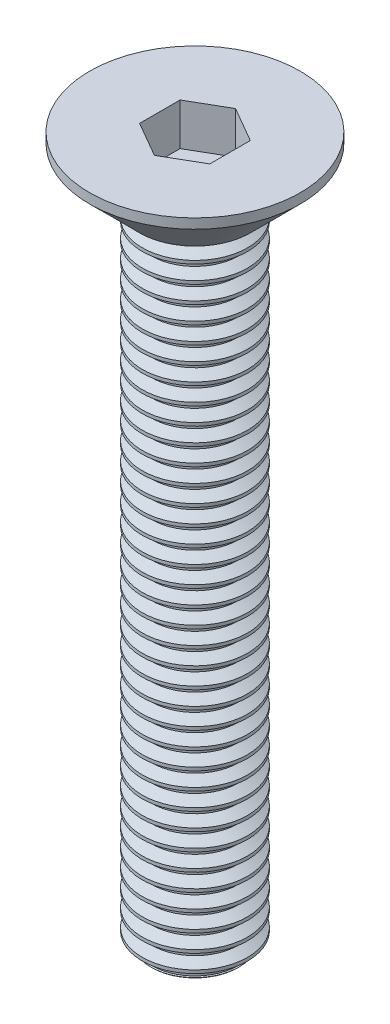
ISO-10303-21;
HEADER;
FILE_DESCRIPTION(('STEP AP214'),'2;1');
FILE_NAME('part.step','',(''),(''),'','','');
FILE_SCHEMA(('AUTOMOTIVE_DESIGN { 1 0 10303 214 1 1 1 1 }'));
ENDSEC;
DATA;
#1=APPLICATION_CONTEXT('core data for automotive mechanical design processes');
#2=APPLICATION_PROTOCOL_DEFINITION('international standard','automotive_design',2000,#1);
#3=PRODUCT_CONTEXT('',#1,'mechanical');
#4=PRODUCT('Part','Part','',(#3));
#5=PRODUCT_RELATED_PRODUCT_CATEGORY('part','',(#4));
#6=PRODUCT_DEFINITION_FORMATION('','',#4);
#7=PRODUCT_DEFINITION_CONTEXT('part definition',#1,'design');
#8=PRODUCT_DEFINITION('design','',#6,#7);
#9=PRODUCT_DEFINITION_SHAPE('','',#8);
#10=(LENGTH_UNIT() NAMED_UNIT(*) SI_UNIT(.MILLI.,.METRE.));
#11=(NAMED_UNIT(*) PLANE_ANGLE_UNIT() SI_UNIT($,.RADIAN.));
#12=(NAMED_UNIT(*) SI_UNIT($,.STERADIAN.) SOLID_ANGLE_UNIT());
#13=UNCERTAINTY_MEASURE_WITH_UNIT(LENGTH_MEASURE(1.E-05),#10,'distance_accuracy_value','');
#14=(GEOMETRIC_REPRESENTATION_CONTEXT(3) GLOBAL_UNCERTAINTY_ASSIGNED_CONTEXT((#13)) GLOBAL_UNIT_ASSIGNED_CONTEXT((#10,
#11,#12)) REPRESENTATION_CONTEXT('',''));
#15=CARTESIAN_POINT('',(0.,0.,0.));
#16=DIRECTION('',(0.,0.,1.));
#17=DIRECTION('',(1.,0.,0.));
#18=AXIS2_PLACEMENT_3D('',#15,#16,#17);
#19=CARTESIAN_POINT('',(0.,0.,0.));
#20=DIRECTION('',(0.,1.,0.));
#21=DIRECTION('',(-1.,0.,0.));
#22=AXIS2_PLACEMENT_3D('',#19,#20,#21);
#23=CYLINDRICAL_SURFACE('',#22,1.5);
#24=CARTESIAN_POINT('',(0.,-18.2,0.));
#25=DIRECTION('',(0.,-1.,0.));
#26=DIRECTION('',(1.,0.,0.));
#27=AXIS2_PLACEMENT_3D('',#24,#25,#26);
#28=CIRCLE('',#27,1.50000000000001);
#29=CARTESIAN_POINT('',(1.50000000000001,-18.2,0.));
#30=VERTEX_POINT('',#29);
#31=EDGE_CURVE('E652',#30,#30,#28,.T.);
#32=ORIENTED_EDGE('',*,*,#31,.F.);
#33=EDGE_LOOP('',(#32));
#34=FACE_BOUND('',#33,.T.);
#35=CARTESIAN_POINT('',(0.,-18.1076239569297,0.));
#36=DIRECTION('',(0.,-1.,0.));
#37=DIRECTION('',(1.,0.,0.));
#38=AXIS2_PLACEMENT_3D('',#35,#36,#37);
#39=CIRCLE('',#38,1.50000000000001);
#40=CARTESIAN_POINT('',(1.50000000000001,-18.1076239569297,0.));
#41=VERTEX_POINT('',#40);
#42=EDGE_CURVE('E673',#41,#41,#39,.T.);
#43=ORIENTED_EDGE('',*,*,#42,.T.);
#44=EDGE_LOOP('',(#43));
#45=FACE_BOUND('',#44,.T.);
#46=ADVANCED_FACE('F39',(#34,#45),#23,.T.);
#47=CARTESIAN_POINT('',(0.,-3.69999999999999,0.));
#48=DIRECTION('',(0.,-1.,0.));
#49=DIRECTION('',(1.,0.,0.));
#50=AXIS2_PLACEMENT_3D('',#47,#48,#49);
#51=CIRCLE('',#50,1.50000000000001);
#52=CARTESIAN_POINT('',(1.50000000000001,-3.69999999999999,0.));
#53=VERTEX_POINT('',#52);
#54=EDGE_CURVE('E479',#53,#53,#51,.T.);
#55=ORIENTED_EDGE('',*,*,#54,.F.);
#56=EDGE_LOOP('',(#55));
#57=FACE_BOUND('',#56,.T.);
#58=CARTESIAN_POINT('',(0.,-3.60762395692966,0.));
#59=DIRECTION('',(0.,-1.,0.));
#60=DIRECTION('',(1.,0.,0.));
#61=AXIS2_PLACEMENT_3D('',#58,#59,#60);
#62=CIRCLE('',#61,1.50000000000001);
#63=CARTESIAN_POINT('',(1.50000000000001,-3.60762395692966,0.));
#64=VERTEX_POINT('',#63);
#65=EDGE_CURVE('E506',#64,#64,#62,.T.);
#66=ORIENTED_EDGE('',*,*,#65,.T.);
#67=EDGE_LOOP('',(#66));
#68=FACE_BOUND('',#67,.T.);
#69=ADVANCED_FACE('F579',(#57,#68),#23,.T.);
#70=CARTESIAN_POINT('',(0.,0.,0.));
#71=DIRECTION('',(0.,-1.,0.));
#72=DIRECTION('',(1.,0.,0.));
#73=AXIS2_PLACEMENT_3D('',#70,#71,#72);
#74=PLANE('',#73);
#75=DIRECTION('',(0.866025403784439,0.,0.5));
#76=VECTOR('',#75,1.);
#77=CARTESIAN_POINT('',(-1.,0.,0.577350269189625));
#78=LINE('',#77,#76);
#79=CARTESIAN_POINT('',(-1.,0.,0.577350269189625));
#80=VERTEX_POINT('',#79);
#81=CARTESIAN_POINT('',(0.,0.,1.15470053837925));
#82=VERTEX_POINT('',#81);
#83=EDGE_CURVE('E135',#80,#82,#78,.T.);
#84=ORIENTED_EDGE('',*,*,#83,.F.);
#85=DIRECTION('',(0.,0.,1.));
#86=VECTOR('',#85,1.);
#87=CARTESIAN_POINT('',(-1.,0.,-0.577350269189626));
#88=LINE('',#87,#86);
#89=CARTESIAN_POINT('',(-1.,0.,-0.577350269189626));
#90=VERTEX_POINT('',#89);
#91=EDGE_CURVE('E128',#90,#80,#88,.T.);
#92=ORIENTED_EDGE('',*,*,#91,.F.);
#93=DIRECTION('',(-0.866025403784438,0.,0.5));
#94=VECTOR('',#93,1.);
#95=CARTESIAN_POINT('',(0.,0.,-1.15470053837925));
#96=LINE('',#95,#94);
#97=CARTESIAN_POINT('',(0.,0.,-1.15470053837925));
#98=VERTEX_POINT('',#97);
#99=EDGE_CURVE('E125',#98,#90,#96,.T.);
#100=ORIENTED_EDGE('',*,*,#99,.F.);
#101=DIRECTION('',(-0.866025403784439,0.,-0.5));
#102=VECTOR('',#101,1.);
#103=CARTESIAN_POINT('',(1.,0.,-0.577350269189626));
#104=LINE('',#103,#102);
#105=CARTESIAN_POINT('',(1.,0.,-0.577350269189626));
#106=VERTEX_POINT('',#105);
#107=EDGE_CURVE('E106',#106,#98,#104,.T.);
#108=ORIENTED_EDGE('',*,*,#107,.F.);
#109=DIRECTION('',(0.,0.,-1.));
#110=VECTOR('',#109,1.);
#111=CARTESIAN_POINT('',(1.,0.,0.577350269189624));
#112=LINE('',#111,#110);
#113=CARTESIAN_POINT('',(1.,0.,0.577350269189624));
#114=VERTEX_POINT('',#113);
#115=EDGE_CURVE('E117',#114,#106,#112,.T.);
#116=ORIENTED_EDGE('',*,*,#115,.F.);
#117=DIRECTION('',(0.866025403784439,0.,-0.5));
#118=VECTOR('',#117,1.);
#119=CARTESIAN_POINT('',(0.,0.,1.15470053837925));
#120=LINE('',#119,#118);
#121=EDGE_CURVE('E56',#82,#114,#120,.T.);
#122=ORIENTED_EDGE('',*,*,#121,.F.);
#123=EDGE_LOOP('',(#84,#92,#100,#108,#116,#122));
#124=FACE_BOUND('',#123,.T.);
#125=CARTESIAN_POINT('',(0.,0.,0.));
#126=DIRECTION('',(0.,1.,0.));
#127=DIRECTION('',(-1.,0.,0.));
#128=AXIS2_PLACEMENT_3D('',#125,#126,#127);
#129=CIRCLE('',#128,3.);
#130=CARTESIAN_POINT('',(-3.,0.,0.));
#131=VERTEX_POINT('',#130);
#132=EDGE_CURVE('E11',#131,#131,#129,.T.);
#133=ORIENTED_EDGE('',*,*,#132,.T.);
#134=EDGE_LOOP('',(#133));
#135=FACE_BOUND('',#134,.T.);
#136=ADVANCED_FACE('F41',(#124,#135),#74,.F.);
#137=CARTESIAN_POINT('',(0.,0.,0.));
#138=DIRECTION('',(0.,1.,0.));
#139=DIRECTION('',(-1.,0.,0.));
#140=AXIS2_PLACEMENT_3D('',#137,#138,#139);
#141=CYLINDRICAL_SURFACE('',#140,3.);
#142=ORIENTED_EDGE('',*,*,#132,.F.);
#143=EDGE_LOOP('',(#142));
#144=FACE_BOUND('',#143,.T.);
#145=CARTESIAN_POINT('',(0.,-0.28000000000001,0.));
#146=DIRECTION('',(0.,1.,0.));
#147=DIRECTION('',(-1.,0.,0.));
#148=AXIS2_PLACEMENT_3D('',#145,#146,#147);
#149=CIRCLE('',#148,3.);
#150=CARTESIAN_POINT('',(-3.,-0.28000000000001,0.));
#151=VERTEX_POINT('',#150);
#152=EDGE_CURVE('E49',#151,#151,#149,.T.);
#153=ORIENTED_EDGE('',*,*,#152,.T.);
#154=EDGE_LOOP('',(#153));
#155=FACE_BOUND('',#154,.T.);
#156=ADVANCED_FACE('F181',(#144,#155),#141,.T.);
#157=CARTESIAN_POINT('',(0.,-1.69999999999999,0.));
#158=DIRECTION('',(0.,1.,0.));
#159=DIRECTION('',(-1.,0.,0.));
#160=AXIS2_PLACEMENT_3D('',#157,#158,#159);
#161=CONICAL_SURFACE('',#160,1.58000000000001,0.78539816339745);
#162=ORIENTED_EDGE('',*,*,#152,.F.);
#163=EDGE_LOOP('',(#162));
#164=FACE_BOUND('',#163,.T.);
#165=CARTESIAN_POINT('',(0.,-1.69999999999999,0.));
#166=DIRECTION('',(0.,1.,0.));
#167=DIRECTION('',(-1.,0.,0.));
#168=AXIS2_PLACEMENT_3D('',#165,#166,#167);
#169=CIRCLE('',#168,1.58000000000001);
#170=CARTESIAN_POINT('',(-1.58000000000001,-1.69999999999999,0.));
#171=VERTEX_POINT('',#170);
#172=EDGE_CURVE('E172',#171,#171,#169,.T.);
#173=ORIENTED_EDGE('',*,*,#172,.T.);
#174=EDGE_LOOP('',(#173));
#175=FACE_BOUND('',#174,.T.);
#176=ADVANCED_FACE('F183',(#164,#175),#161,.T.);
#177=CARTESIAN_POINT('',(1.50000000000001,-1.69999999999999,0.));
#178=DIRECTION('',(0.,1.,0.));
#179=DIRECTION('',(-1.,0.,0.));
#180=AXIS2_PLACEMENT_3D('',#177,#178,#179);
#181=PLANE('',#180);
#182=ORIENTED_EDGE('',*,*,#172,.F.);
#183=EDGE_LOOP('',(#182));
#184=FACE_BOUND('',#183,.T.);
#185=CARTESIAN_POINT('',(0.,-1.69999999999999,0.));
#186=DIRECTION('',(0.,-1.,0.));
#187=DIRECTION('',(1.,0.,0.));
#188=AXIS2_PLACEMENT_3D('',#185,#186,#187);
#189=CIRCLE('',#188,1.50000000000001);
#190=CARTESIAN_POINT('',(1.50000000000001,-1.69999999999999,0.));
#191=VERTEX_POINT('',#190);
#192=EDGE_CURVE('E196',#191,#191,#189,.T.);
#193=ORIENTED_EDGE('',*,*,#192,.F.);
#194=EDGE_LOOP('',(#193));
#195=FACE_BOUND('',#194,.T.);
#196=ADVANCED_FACE('F186',(#184,#195),#181,.F.);
#197=CARTESIAN_POINT('',(0.,-1.2,1.15470053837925));
#198=DIRECTION('',(0.5,0.,0.866025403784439));
#199=DIRECTION('',(0.866025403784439,0.,-0.5));
#200=AXIS2_PLACEMENT_3D('',#197,#198,#199);
#201=PLANE('',#200);
#202=ORIENTED_EDGE('',*,*,#121,.T.);
#203=DIRECTION('',(0.,1.,0.));
#204=VECTOR('',#203,1.);
#205=CARTESIAN_POINT('',(1.,-1.2,0.577350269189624));
#206=LINE('',#205,#204);
#207=CARTESIAN_POINT('',(1.,-1.2,0.577350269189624));
#208=VERTEX_POINT('',#207);
#209=EDGE_CURVE('E114',#208,#114,#206,.T.);
#210=ORIENTED_EDGE('',*,*,#209,.F.);
#211=DIRECTION('',(0.866025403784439,0.,-0.5));
#212=VECTOR('',#211,1.);
#213=CARTESIAN_POINT('',(0.,-1.2,1.15470053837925));
#214=LINE('',#213,#212);
#215=CARTESIAN_POINT('',(0.,-1.2,1.15470053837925));
#216=VERTEX_POINT('',#215);
#217=EDGE_CURVE('E138',#216,#208,#214,.T.);
#218=ORIENTED_EDGE('',*,*,#217,.F.);
#219=DIRECTION('',(0.,1.,0.));
#220=VECTOR('',#219,1.);
#221=CARTESIAN_POINT('',(0.,-1.2,1.15470053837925));
#222=LINE('',#221,#220);
#223=EDGE_CURVE('E65',#216,#82,#222,.T.);
#224=ORIENTED_EDGE('',*,*,#223,.T.);
#225=EDGE_LOOP('',(#202,#210,#218,#224));
#226=FACE_BOUND('',#225,.T.);
#227=ADVANCED_FACE('F192',(#226),#201,.F.);
#228=CARTESIAN_POINT('',(-1.,-1.2,0.577350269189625));
#229=DIRECTION('',(-0.5,0.,0.866025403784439));
#230=DIRECTION('',(0.866025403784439,0.,0.5));
#231=AXIS2_PLACEMENT_3D('',#228,#229,#230);
#232=PLANE('',#231);
#233=ORIENTED_EDGE('',*,*,#83,.T.);
#234=ORIENTED_EDGE('',*,*,#223,.F.);
#235=DIRECTION('',(0.866025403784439,0.,0.5));
#236=VECTOR('',#235,1.);
#237=CARTESIAN_POINT('',(-1.,-1.2,0.577350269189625));
#238=LINE('',#237,#236);
#239=CARTESIAN_POINT('',(-1.,-1.2,0.577350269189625));
#240=VERTEX_POINT('',#239);
#241=EDGE_CURVE('E154',#240,#216,#238,.T.);
#242=ORIENTED_EDGE('',*,*,#241,.F.);
#243=DIRECTION('',(0.,1.,0.));
#244=VECTOR('',#243,1.);
#245=CARTESIAN_POINT('',(-1.,-1.2,0.577350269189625));
#246=LINE('',#245,#244);
#247=EDGE_CURVE('E161',#240,#80,#246,.T.);
#248=ORIENTED_EDGE('',*,*,#247,.T.);
#249=EDGE_LOOP('',(#233,#234,#242,#248));
#250=FACE_BOUND('',#249,.T.);
#251=ADVANCED_FACE('F2015',(#250),#232,.F.);
#252=CARTESIAN_POINT('',(-1.,-1.2,-0.577350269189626));
#253=DIRECTION('',(-1.,0.,0.));
#254=DIRECTION('',(0.,0.,1.));
#255=AXIS2_PLACEMENT_3D('',#252,#253,#254);
#256=PLANE('',#255);
#257=ORIENTED_EDGE('',*,*,#91,.T.);
#258=ORIENTED_EDGE('',*,*,#247,.F.);
#259=DIRECTION('',(0.,0.,1.));
#260=VECTOR('',#259,1.);
#261=CARTESIAN_POINT('',(-1.,-1.2,-0.577350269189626));
#262=LINE('',#261,#260);
#263=CARTESIAN_POINT('',(-1.,-1.2,-0.577350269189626));
#264=VERTEX_POINT('',#263);
#265=EDGE_CURVE('E150',#264,#240,#262,.T.);
#266=ORIENTED_EDGE('',*,*,#265,.F.);
#267=DIRECTION('',(0.,1.,0.));
#268=VECTOR('',#267,1.);
#269=CARTESIAN_POINT('',(-1.,-1.2,-0.577350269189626));
#270=LINE('',#269,#268);
#271=EDGE_CURVE('E164',#264,#90,#270,.T.);
#272=ORIENTED_EDGE('',*,*,#271,.T.);
#273=EDGE_LOOP('',(#257,#258,#266,#272));
#274=FACE_BOUND('',#273,.T.);
#275=ADVANCED_FACE('F2041',(#274),#256,.F.);
#276=CARTESIAN_POINT('',(0.,-1.2,-1.15470053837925));
#277=DIRECTION('',(-0.5,0.,-0.866025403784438));
#278=DIRECTION('',(-0.866025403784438,0.,0.5));
#279=AXIS2_PLACEMENT_3D('',#276,#277,#278);
#280=PLANE('',#279);
#281=ORIENTED_EDGE('',*,*,#99,.T.);
#282=ORIENTED_EDGE('',*,*,#271,.F.);
#283=DIRECTION('',(-0.866025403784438,0.,0.5));
#284=VECTOR('',#283,1.);
#285=CARTESIAN_POINT('',(0.,-1.2,-1.15470053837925));
#286=LINE('',#285,#284);
#287=CARTESIAN_POINT('',(0.,-1.2,-1.15470053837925));
#288=VERTEX_POINT('',#287);
#289=EDGE_CURVE('E146',#288,#264,#286,.T.);
#290=ORIENTED_EDGE('',*,*,#289,.F.);
#291=DIRECTION('',(0.,1.,0.));
#292=VECTOR('',#291,1.);
#293=CARTESIAN_POINT('',(0.,-1.2,-1.15470053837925));
#294=LINE('',#293,#292);
#295=EDGE_CURVE('E113',#288,#98,#294,.T.);
#296=ORIENTED_EDGE('',*,*,#295,.T.);
#297=EDGE_LOOP('',(#281,#282,#290,#296));
#298=FACE_BOUND('',#297,.T.);
#299=ADVANCED_FACE('F2033',(#298),#280,.F.);
#300=CARTESIAN_POINT('',(1.,-1.2,-0.577350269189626));
#301=DIRECTION('',(0.5,0.,-0.866025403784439));
#302=DIRECTION('',(-0.866025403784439,0.,-0.5));
#303=AXIS2_PLACEMENT_3D('',#300,#301,#302);
#304=PLANE('',#303);
#305=ORIENTED_EDGE('',*,*,#107,.T.);
#306=ORIENTED_EDGE('',*,*,#295,.F.);
#307=DIRECTION('',(-0.866025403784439,0.,-0.5));
#308=VECTOR('',#307,1.);
#309=CARTESIAN_POINT('',(1.,-1.2,-0.577350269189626));
#310=LINE('',#309,#308);
#311=CARTESIAN_POINT('',(1.,-1.2,-0.577350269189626));
#312=VERTEX_POINT('',#311);
#313=EDGE_CURVE('E109',#312,#288,#310,.T.);
#314=ORIENTED_EDGE('',*,*,#313,.F.);
#315=DIRECTION('',(0.,1.,0.));
#316=VECTOR('',#315,1.);
#317=CARTESIAN_POINT('',(1.,-1.2,-0.577350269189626));
#318=LINE('',#317,#316);
#319=EDGE_CURVE('E102',#312,#106,#318,.T.);
#320=ORIENTED_EDGE('',*,*,#319,.T.);
#321=EDGE_LOOP('',(#305,#306,#314,#320));
#322=FACE_BOUND('',#321,.T.);
#323=ADVANCED_FACE('F104',(#322),#304,.F.);
#324=CARTESIAN_POINT('',(1.,-1.2,0.577350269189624));
#325=DIRECTION('',(1.,0.,0.));
#326=DIRECTION('',(0.,0.,-1.));
#327=AXIS2_PLACEMENT_3D('',#324,#325,#326);
#328=PLANE('',#327);
#329=ORIENTED_EDGE('',*,*,#115,.T.);
#330=ORIENTED_EDGE('',*,*,#319,.F.);
#331=DIRECTION('',(0.,0.,-1.));
#332=VECTOR('',#331,1.);
#333=CARTESIAN_POINT('',(1.,-1.2,0.577350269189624));
#334=LINE('',#333,#332);
#335=EDGE_CURVE('E142',#208,#312,#334,.T.);
#336=ORIENTED_EDGE('',*,*,#335,.F.);
#337=ORIENTED_EDGE('',*,*,#209,.T.);
#338=EDGE_LOOP('',(#329,#330,#336,#337));
#339=FACE_BOUND('',#338,.T.);
#340=ADVANCED_FACE('F118',(#339),#328,.F.);
#341=CARTESIAN_POINT('',(-1.,-1.2,1.73205080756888));
#342=DIRECTION('',(0.,-1.,0.));
#343=DIRECTION('',(0.,0.,-1.));
#344=AXIS2_PLACEMENT_3D('',#341,#342,#343);
#345=PLANE('',#344);
#346=ORIENTED_EDGE('',*,*,#217,.T.);
#347=ORIENTED_EDGE('',*,*,#335,.T.);
#348=ORIENTED_EDGE('',*,*,#313,.T.);
#349=ORIENTED_EDGE('',*,*,#289,.T.);
#350=ORIENTED_EDGE('',*,*,#265,.T.);
#351=ORIENTED_EDGE('',*,*,#241,.T.);
#352=EDGE_LOOP('',(#346,#347,#348,#349,#350,#351));
#353=FACE_BOUND('',#352,.T.);
#354=ADVANCED_FACE('F564',(#353),#345,.F.);
#355=CARTESIAN_POINT('',(0.,-1.95000000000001,0.));
#356=DIRECTION('',(0.,-1.,0.));
#357=DIRECTION('',(1.,0.,0.));
#358=AXIS2_PLACEMENT_3D('',#355,#356,#357);
#359=CONICAL_SURFACE('',#358,1.22698729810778,1.04719755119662);
#360=CARTESIAN_POINT('',(0.,-2.10762395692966,0.));
#361=DIRECTION('',(0.,-1.,0.));
#362=DIRECTION('',(1.,0.,0.));
#363=AXIS2_PLACEMENT_3D('',#360,#361,#362);
#364=CIRCLE('',#363,1.50000000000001);
#365=CARTESIAN_POINT('',(1.50000000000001,-2.10762395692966,0.));
#366=VERTEX_POINT('',#365);
#367=EDGE_CURVE('E214',#366,#366,#364,.T.);
#368=ORIENTED_EDGE('',*,*,#367,.F.);
#369=EDGE_LOOP('',(#368));
#370=FACE_BOUND('',#369,.T.);
#371=CARTESIAN_POINT('',(0.,-1.95000000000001,0.));
#372=DIRECTION('',(0.,-1.,0.));
#373=DIRECTION('',(1.,0.,0.));
#374=AXIS2_PLACEMENT_3D('',#371,#372,#373);
#375=CIRCLE('',#374,1.22698729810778);
#376=CARTESIAN_POINT('',(1.22698729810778,-1.95000000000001,0.));
#377=VERTEX_POINT('',#376);
#378=EDGE_CURVE('E204',#377,#377,#375,.T.);
#379=ORIENTED_EDGE('',*,*,#378,.T.);
#380=EDGE_LOOP('',(#379));
#381=FACE_BOUND('',#380,.T.);
#382=ADVANCED_FACE('F560',(#370,#381),#359,.T.);
#383=CARTESIAN_POINT('',(0.,-20.,0.));
#384=DIRECTION('',(0.,-1.,0.));
#385=DIRECTION('',(1.,0.,0.));
#386=AXIS2_PLACEMENT_3D('',#383,#384,#385);
#387=CYLINDRICAL_SURFACE('',#386,1.22698729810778);
#388=ORIENTED_EDGE('',*,*,#378,.F.);
#389=EDGE_LOOP('',(#388));
#390=FACE_BOUND('',#389,.T.);
#391=CARTESIAN_POINT('',(0.,-1.85762395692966,0.));
#392=DIRECTION('',(0.,-1.,0.));
#393=DIRECTION('',(1.,0.,0.));
#394=AXIS2_PLACEMENT_3D('',#391,#392,#393);
#395=CIRCLE('',#394,1.22698729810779);
#396=CARTESIAN_POINT('',(1.22698729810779,-1.85762395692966,0.));
#397=VERTEX_POINT('',#396);
#398=EDGE_CURVE('E199',#397,#397,#395,.T.);
#399=ORIENTED_EDGE('',*,*,#398,.T.);
#400=EDGE_LOOP('',(#399));
#401=FACE_BOUND('',#400,.T.);
#402=ADVANCED_FACE('F563',(#390,#401),#387,.T.);
#403=CARTESIAN_POINT('',(0.,-1.69999999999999,0.));
#404=DIRECTION('',(0.,1.,0.));
#405=DIRECTION('',(-1.,0.,0.));
#406=AXIS2_PLACEMENT_3D('',#403,#404,#405);
#407=CONICAL_SURFACE('',#406,1.50000000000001,1.04719755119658);
#408=ORIENTED_EDGE('',*,*,#398,.F.);
#409=EDGE_LOOP('',(#408));
#410=FACE_BOUND('',#409,.T.);
#411=ORIENTED_EDGE('',*,*,#192,.T.);
#412=EDGE_LOOP('',(#411));
#413=FACE_BOUND('',#412,.T.);
#414=ADVANCED_FACE('F555',(#410,#413),#407,.T.);
#415=CARTESIAN_POINT('',(0.,-2.19999999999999,0.));
#416=DIRECTION('',(0.,-1.,0.));
#417=DIRECTION('',(1.,0.,0.));
#418=AXIS2_PLACEMENT_3D('',#415,#416,#417);
#419=CIRCLE('',#418,1.50000000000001);
#420=CARTESIAN_POINT('',(1.50000000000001,-2.19999999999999,0.));
#421=VERTEX_POINT('',#420);
#422=EDGE_CURVE('E526',#421,#421,#419,.T.);
#423=ORIENTED_EDGE('',*,*,#422,.F.);
#424=EDGE_LOOP('',(#423));
#425=FACE_BOUND('',#424,.T.);
#426=ORIENTED_EDGE('',*,*,#367,.T.);
#427=EDGE_LOOP('',(#426));
#428=FACE_BOUND('',#427,.T.);
#429=ADVANCED_FACE('F552',(#425,#428),#23,.T.);
#430=CARTESIAN_POINT('',(0.,-2.45000000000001,0.));
#431=DIRECTION('',(0.,-1.,0.));
#432=DIRECTION('',(1.,0.,0.));
#433=AXIS2_PLACEMENT_3D('',#430,#431,#432);
#434=CONICAL_SURFACE('',#433,1.22698729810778,1.04719755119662);
#435=CARTESIAN_POINT('',(0.,-2.60762395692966,0.));
#436=DIRECTION('',(0.,-1.,0.));
#437=DIRECTION('',(1.,0.,0.));
#438=AXIS2_PLACEMENT_3D('',#435,#436,#437);
#439=CIRCLE('',#438,1.50000000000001);
#440=CARTESIAN_POINT('',(1.50000000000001,-2.60762395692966,0.));
#441=VERTEX_POINT('',#440);
#442=EDGE_CURVE('E200',#441,#441,#439,.T.);
#443=ORIENTED_EDGE('',*,*,#442,.F.);
#444=EDGE_LOOP('',(#443));
#445=FACE_BOUND('',#444,.T.);
#446=CARTESIAN_POINT('',(0.,-2.45000000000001,0.));
#447=DIRECTION('',(0.,-1.,0.));
#448=DIRECTION('',(1.,0.,0.));
#449=AXIS2_PLACEMENT_3D('',#446,#447,#448);
#450=CIRCLE('',#449,1.22698729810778);
#451=CARTESIAN_POINT('',(1.22698729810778,-2.45000000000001,0.));
#452=VERTEX_POINT('',#451);
#453=EDGE_CURVE('E208',#452,#452,#450,.T.);
#454=ORIENTED_EDGE('',*,*,#453,.T.);
#455=EDGE_LOOP('',(#454));
#456=FACE_BOUND('',#455,.T.);
#457=ADVANCED_FACE('F537',(#445,#456),#434,.T.);
#458=CARTESIAN_POINT('',(0.,-20.5,0.));
#459=DIRECTION('',(0.,-1.,0.));
#460=DIRECTION('',(1.,0.,0.));
#461=AXIS2_PLACEMENT_3D('',#458,#459,#460);
#462=CYLINDRICAL_SURFACE('',#461,1.22698729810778);
#463=ORIENTED_EDGE('',*,*,#453,.F.);
#464=EDGE_LOOP('',(#463));
#465=FACE_BOUND('',#464,.T.);
#466=CARTESIAN_POINT('',(0.,-2.35762395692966,0.));
#467=DIRECTION('',(0.,-1.,0.));
#468=DIRECTION('',(1.,0.,0.));
#469=AXIS2_PLACEMENT_3D('',#466,#467,#468);
#470=CIRCLE('',#469,1.22698729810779);
#471=CARTESIAN_POINT('',(1.22698729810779,-2.35762395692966,0.));
#472=VERTEX_POINT('',#471);
#473=EDGE_CURVE('E530',#472,#472,#470,.T.);
#474=ORIENTED_EDGE('',*,*,#473,.T.);
#475=EDGE_LOOP('',(#474));
#476=FACE_BOUND('',#475,.T.);
#477=ADVANCED_FACE('F539',(#465,#476),#462,.T.);
#478=CARTESIAN_POINT('',(0.,-2.19999999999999,0.));
#479=DIRECTION('',(0.,1.,0.));
#480=DIRECTION('',(-1.,0.,0.));
#481=AXIS2_PLACEMENT_3D('',#478,#479,#480);
#482=CONICAL_SURFACE('',#481,1.50000000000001,1.04719755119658);
#483=ORIENTED_EDGE('',*,*,#473,.F.);
#484=EDGE_LOOP('',(#483));
#485=FACE_BOUND('',#484,.T.);
#486=ORIENTED_EDGE('',*,*,#422,.T.);
#487=EDGE_LOOP('',(#486));
#488=FACE_BOUND('',#487,.T.);
#489=ADVANCED_FACE('F542',(#485,#488),#482,.T.);
#490=CARTESIAN_POINT('',(0.,-2.69999999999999,0.));
#491=DIRECTION('',(0.,-1.,0.));
#492=DIRECTION('',(1.,0.,0.));
#493=AXIS2_PLACEMENT_3D('',#490,#491,#492);
#494=CIRCLE('',#493,1.50000000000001);
#495=CARTESIAN_POINT('',(1.50000000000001,-2.69999999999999,0.));
#496=VERTEX_POINT('',#495);
#497=EDGE_CURVE('E510',#496,#496,#494,.T.);
#498=ORIENTED_EDGE('',*,*,#497,.F.);
#499=EDGE_LOOP('',(#498));
#500=FACE_BOUND('',#499,.T.);
#501=ORIENTED_EDGE('',*,*,#442,.T.);
#502=EDGE_LOOP('',(#501));
#503=FACE_BOUND('',#502,.T.);
#504=ADVANCED_FACE('F548',(#500,#503),#23,.T.);
#505=CARTESIAN_POINT('',(0.,-2.95000000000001,0.));
#506=DIRECTION('',(0.,-1.,0.));
#507=DIRECTION('',(1.,0.,0.));
#508=AXIS2_PLACEMENT_3D('',#505,#506,#507);
#509=CONICAL_SURFACE('',#508,1.22698729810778,1.04719755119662);
#510=CARTESIAN_POINT('',(0.,-3.10762395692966,0.));
#511=DIRECTION('',(0.,-1.,0.));
#512=DIRECTION('',(1.,0.,0.));
#513=AXIS2_PLACEMENT_3D('',#510,#511,#512);
#514=CIRCLE('',#513,1.50000000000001);
#515=CARTESIAN_POINT('',(1.50000000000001,-3.10762395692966,0.));
#516=VERTEX_POINT('',#515);
#517=EDGE_CURVE('E522',#516,#516,#514,.T.);
#518=ORIENTED_EDGE('',*,*,#517,.F.);
#519=EDGE_LOOP('',(#518));
#520=FACE_BOUND('',#519,.T.);
#521=CARTESIAN_POINT('',(0.,-2.95000000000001,0.));
#522=DIRECTION('',(0.,-1.,0.));
#523=DIRECTION('',(1.,0.,0.));
#524=AXIS2_PLACEMENT_3D('',#521,#522,#523);
#525=CIRCLE('',#524,1.22698729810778);
#526=CARTESIAN_POINT('',(1.22698729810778,-2.95000000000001,0.));
#527=VERTEX_POINT('',#526);
#528=EDGE_CURVE('E518',#527,#527,#525,.T.);
#529=ORIENTED_EDGE('',*,*,#528,.T.);
#530=EDGE_LOOP('',(#529));
#531=FACE_BOUND('',#530,.T.);
#532=ADVANCED_FACE('F1108',(#520,#531),#509,.T.);
#533=CARTESIAN_POINT('',(0.,-21.,0.));
#534=DIRECTION('',(0.,-1.,0.));
#535=DIRECTION('',(1.,0.,0.));
#536=AXIS2_PLACEMENT_3D('',#533,#534,#535);
#537=CYLINDRICAL_SURFACE('',#536,1.22698729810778);
#538=ORIENTED_EDGE('',*,*,#528,.F.);
#539=EDGE_LOOP('',(#538));
#540=FACE_BOUND('',#539,.T.);
#541=CARTESIAN_POINT('',(0.,-2.85762395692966,0.));
#542=DIRECTION('',(0.,-1.,0.));
#543=DIRECTION('',(1.,0.,0.));
#544=AXIS2_PLACEMENT_3D('',#541,#542,#543);
#545=CIRCLE('',#544,1.22698729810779);
#546=CARTESIAN_POINT('',(1.22698729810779,-2.85762395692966,0.));
#547=VERTEX_POINT('',#546);
#548=EDGE_CURVE('E514',#547,#547,#545,.T.);
#549=ORIENTED_EDGE('',*,*,#548,.T.);
#550=EDGE_LOOP('',(#549));
#551=FACE_BOUND('',#550,.T.);
#552=ADVANCED_FACE('F1104',(#540,#551),#537,.T.);
#553=CARTESIAN_POINT('',(0.,-2.69999999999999,0.));
#554=DIRECTION('',(0.,1.,0.));
#555=DIRECTION('',(-1.,0.,0.));
#556=AXIS2_PLACEMENT_3D('',#553,#554,#555);
#557=CONICAL_SURFACE('',#556,1.50000000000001,1.04719755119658);
#558=ORIENTED_EDGE('',*,*,#548,.F.);
#559=EDGE_LOOP('',(#558));
#560=FACE_BOUND('',#559,.T.);
#561=ORIENTED_EDGE('',*,*,#497,.T.);
#562=EDGE_LOOP('',(#561));
#563=FACE_BOUND('',#562,.T.);
#564=ADVANCED_FACE('F1101',(#560,#563),#557,.T.);
#565=CARTESIAN_POINT('',(0.,-3.19999999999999,0.));
#566=DIRECTION('',(0.,-1.,0.));
#567=DIRECTION('',(1.,0.,0.));
#568=AXIS2_PLACEMENT_3D('',#565,#566,#567);
#569=CIRCLE('',#568,1.50000000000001);
#570=CARTESIAN_POINT('',(1.50000000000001,-3.19999999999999,0.));
#571=VERTEX_POINT('',#570);
#572=EDGE_CURVE('E494',#571,#571,#569,.T.);
#573=ORIENTED_EDGE('',*,*,#572,.F.);
#574=EDGE_LOOP('',(#573));
#575=FACE_BOUND('',#574,.T.);
#576=ORIENTED_EDGE('',*,*,#517,.T.);
#577=EDGE_LOOP('',(#576));
#578=FACE_BOUND('',#577,.T.);
#579=ADVANCED_FACE('F1099',(#575,#578),#23,.T.);
#580=CARTESIAN_POINT('',(0.,-3.45000000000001,0.));
#581=DIRECTION('',(0.,-1.,0.));
#582=DIRECTION('',(1.,0.,0.));
#583=AXIS2_PLACEMENT_3D('',#580,#581,#582);
#584=CONICAL_SURFACE('',#583,1.22698729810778,1.04719755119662);
#585=ORIENTED_EDGE('',*,*,#65,.F.);
#586=EDGE_LOOP('',(#585));
#587=FACE_BOUND('',#586,.T.);
#588=CARTESIAN_POINT('',(0.,-3.45000000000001,0.));
#589=DIRECTION('',(0.,-1.,0.));
#590=DIRECTION('',(1.,0.,0.));
#591=AXIS2_PLACEMENT_3D('',#588,#589,#590);
#592=CIRCLE('',#591,1.22698729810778);
#593=CARTESIAN_POINT('',(1.22698729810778,-3.45000000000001,0.));
#594=VERTEX_POINT('',#593);
#595=EDGE_CURVE('E502',#594,#594,#592,.T.);
#596=ORIENTED_EDGE('',*,*,#595,.T.);
#597=EDGE_LOOP('',(#596));
#598=FACE_BOUND('',#597,.T.);
#599=ADVANCED_FACE('F1095',(#587,#598),#584,.T.);
#600=CARTESIAN_POINT('',(0.,-21.5,0.));
#601=DIRECTION('',(0.,-1.,0.));
#602=DIRECTION('',(1.,0.,0.));
#603=AXIS2_PLACEMENT_3D('',#600,#601,#602);
#604=CYLINDRICAL_SURFACE('',#603,1.22698729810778);
#605=ORIENTED_EDGE('',*,*,#595,.F.);
#606=EDGE_LOOP('',(#605));
#607=FACE_BOUND('',#606,.T.);
#608=CARTESIAN_POINT('',(0.,-3.35762395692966,0.));
#609=DIRECTION('',(0.,-1.,0.));
#610=DIRECTION('',(1.,0.,0.));
#611=AXIS2_PLACEMENT_3D('',#608,#609,#610);
#612=CIRCLE('',#611,1.22698729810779);
#613=CARTESIAN_POINT('',(1.22698729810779,-3.35762395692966,0.));
#614=VERTEX_POINT('',#613);
#615=EDGE_CURVE('E498',#614,#614,#612,.T.);
#616=ORIENTED_EDGE('',*,*,#615,.T.);
#617=EDGE_LOOP('',(#616));
#618=FACE_BOUND('',#617,.T.);
#619=ADVANCED_FACE('F1091',(#607,#618),#604,.T.);
#620=CARTESIAN_POINT('',(0.,-3.19999999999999,0.));
#621=DIRECTION('',(0.,1.,0.));
#622=DIRECTION('',(-1.,0.,0.));
#623=AXIS2_PLACEMENT_3D('',#620,#621,#622);
#624=CONICAL_SURFACE('',#623,1.50000000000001,1.04719755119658);
#625=ORIENTED_EDGE('',*,*,#615,.F.);
#626=EDGE_LOOP('',(#625));
#627=FACE_BOUND('',#626,.T.);
#628=ORIENTED_EDGE('',*,*,#572,.T.);
#629=EDGE_LOOP('',(#628));
#630=FACE_BOUND('',#629,.T.);
#631=ADVANCED_FACE('F1087',(#627,#630),#624,.T.);
#632=CARTESIAN_POINT('',(0.,-3.95000000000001,0.));
#633=DIRECTION('',(0.,-1.,0.));
#634=DIRECTION('',(1.,0.,0.));
#635=AXIS2_PLACEMENT_3D('',#632,#633,#634);
#636=CONICAL_SURFACE('',#635,1.22698729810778,1.04719755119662);
#637=CARTESIAN_POINT('',(0.,-4.10762395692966,0.));
#638=DIRECTION('',(0.,-1.,0.));
#639=DIRECTION('',(1.,0.,0.));
#640=AXIS2_PLACEMENT_3D('',#637,#638,#639);
#641=CIRCLE('',#640,1.50000000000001);
#642=CARTESIAN_POINT('',(1.50000000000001,-4.10762395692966,0.));
#643=VERTEX_POINT('',#642);
#644=EDGE_CURVE('E490',#643,#643,#641,.T.);
#645=ORIENTED_EDGE('',*,*,#644,.F.);
#646=EDGE_LOOP('',(#645));
#647=FACE_BOUND('',#646,.T.);
#648=CARTESIAN_POINT('',(0.,-3.95000000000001,0.));
#649=DIRECTION('',(0.,-1.,0.));
#650=DIRECTION('',(1.,0.,0.));
#651=AXIS2_PLACEMENT_3D('',#648,#649,#650);
#652=CIRCLE('',#651,1.22698729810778);
#653=CARTESIAN_POINT('',(1.22698729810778,-3.95000000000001,0.));
#654=VERTEX_POINT('',#653);
#655=EDGE_CURVE('E487',#654,#654,#652,.T.);
#656=ORIENTED_EDGE('',*,*,#655,.T.);
#657=EDGE_LOOP('',(#656));
#658=FACE_BOUND('',#657,.T.);
#659=ADVANCED_FACE('F1083',(#647,#658),#636,.T.);
#660=CARTESIAN_POINT('',(0.,-22.,0.));
#661=DIRECTION('',(0.,-1.,0.));
#662=DIRECTION('',(1.,0.,0.));
#663=AXIS2_PLACEMENT_3D('',#660,#661,#662);
#664=CYLINDRICAL_SURFACE('',#663,1.22698729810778);
#665=ORIENTED_EDGE('',*,*,#655,.F.);
#666=EDGE_LOOP('',(#665));
#667=FACE_BOUND('',#666,.T.);
#668=CARTESIAN_POINT('',(0.,-3.85762395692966,0.));
#669=DIRECTION('',(0.,-1.,0.));
#670=DIRECTION('',(1.,0.,0.));
#671=AXIS2_PLACEMENT_3D('',#668,#669,#670);
#672=CIRCLE('',#671,1.22698729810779);
#673=CARTESIAN_POINT('',(1.22698729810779,-3.85762395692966,0.));
#674=VERTEX_POINT('',#673);
#675=EDGE_CURVE('E483',#674,#674,#672,.T.);
#676=ORIENTED_EDGE('',*,*,#675,.T.);
#677=EDGE_LOOP('',(#676));
#678=FACE_BOUND('',#677,.T.);
#679=ADVANCED_FACE('F1079',(#667,#678),#664,.T.);
#680=CARTESIAN_POINT('',(0.,-3.69999999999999,0.));
#681=DIRECTION('',(0.,1.,0.));
#682=DIRECTION('',(-1.,0.,0.));
#683=AXIS2_PLACEMENT_3D('',#680,#681,#682);
#684=CONICAL_SURFACE('',#683,1.50000000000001,1.04719755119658);
#685=ORIENTED_EDGE('',*,*,#675,.F.);
#686=EDGE_LOOP('',(#685));
#687=FACE_BOUND('',#686,.T.);
#688=ORIENTED_EDGE('',*,*,#54,.T.);
#689=EDGE_LOOP('',(#688));
#690=FACE_BOUND('',#689,.T.);
#691=ADVANCED_FACE('F1076',(#687,#690),#684,.T.);
#692=CARTESIAN_POINT('',(0.,-4.19999999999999,0.));
#693=DIRECTION('',(0.,-1.,0.));
#694=DIRECTION('',(1.,0.,0.));
#695=AXIS2_PLACEMENT_3D('',#692,#693,#694);
#696=CIRCLE('',#695,1.50000000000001);
#697=CARTESIAN_POINT('',(1.50000000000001,-4.19999999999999,0.));
#698=VERTEX_POINT('',#697);
#699=EDGE_CURVE('E468',#698,#698,#696,.T.);
#700=ORIENTED_EDGE('',*,*,#699,.F.);
#701=EDGE_LOOP('',(#700));
#702=FACE_BOUND('',#701,.T.);
#703=ORIENTED_EDGE('',*,*,#644,.T.);
#704=EDGE_LOOP('',(#703));
#705=FACE_BOUND('',#704,.T.);
#706=ADVANCED_FACE('F587',(#702,#705),#23,.T.);
#707=CARTESIAN_POINT('',(0.,-4.45000000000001,0.));
#708=DIRECTION('',(0.,-1.,0.));
#709=DIRECTION('',(1.,0.,0.));
#710=AXIS2_PLACEMENT_3D('',#707,#708,#709);
#711=CONICAL_SURFACE('',#710,1.22698729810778,1.04719755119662);
#712=CARTESIAN_POINT('',(0.,-4.60762395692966,0.));
#713=DIRECTION('',(0.,-1.,0.));
#714=DIRECTION('',(1.,0.,0.));
#715=AXIS2_PLACEMENT_3D('',#712,#713,#714);
#716=CIRCLE('',#715,1.50000000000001);
#717=CARTESIAN_POINT('',(1.50000000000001,-4.60762395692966,0.));
#718=VERTEX_POINT('',#717);
#719=EDGE_CURVE('E219',#718,#718,#716,.T.);
#720=ORIENTED_EDGE('',*,*,#719,.F.);
#721=EDGE_LOOP('',(#720));
#722=FACE_BOUND('',#721,.T.);
#723=CARTESIAN_POINT('',(0.,-4.45000000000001,0.));
#724=DIRECTION('',(0.,-1.,0.));
#725=DIRECTION('',(1.,0.,0.));
#726=AXIS2_PLACEMENT_3D('',#723,#724,#725);
#727=CIRCLE('',#726,1.22698729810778);
#728=CARTESIAN_POINT('',(1.22698729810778,-4.45000000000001,0.));
#729=VERTEX_POINT('',#728);
#730=EDGE_CURVE('E474',#729,#729,#727,.T.);
#731=ORIENTED_EDGE('',*,*,#730,.T.);
#732=EDGE_LOOP('',(#731));
#733=FACE_BOUND('',#732,.T.);
#734=ADVANCED_FACE('F1071',(#722,#733),#711,.T.);
#735=CARTESIAN_POINT('',(0.,-22.5,0.));
#736=DIRECTION('',(0.,-1.,0.));
#737=DIRECTION('',(1.,0.,0.));
#738=AXIS2_PLACEMENT_3D('',#735,#736,#737);
#739=CYLINDRICAL_SURFACE('',#738,1.22698729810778);
#740=ORIENTED_EDGE('',*,*,#730,.F.);
#741=EDGE_LOOP('',(#740));
#742=FACE_BOUND('',#741,.T.);
#743=CARTESIAN_POINT('',(0.,-4.35762395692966,0.));
#744=DIRECTION('',(0.,-1.,0.));
#745=DIRECTION('',(1.,0.,0.));
#746=AXIS2_PLACEMENT_3D('',#743,#744,#745);
#747=CIRCLE('',#746,1.22698729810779);
#748=CARTESIAN_POINT('',(1.22698729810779,-4.35762395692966,0.));
#749=VERTEX_POINT('',#748);
#750=EDGE_CURVE('E471',#749,#749,#747,.T.);
#751=ORIENTED_EDGE('',*,*,#750,.T.);
#752=EDGE_LOOP('',(#751));
#753=FACE_BOUND('',#752,.T.);
#754=ADVANCED_FACE('F1067',(#742,#753),#739,.T.);
#755=CARTESIAN_POINT('',(0.,-4.19999999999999,0.));
#756=DIRECTION('',(0.,1.,0.));
#757=DIRECTION('',(-1.,0.,0.));
#758=AXIS2_PLACEMENT_3D('',#755,#756,#757);
#759=CONICAL_SURFACE('',#758,1.50000000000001,1.04719755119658);
#760=ORIENTED_EDGE('',*,*,#750,.F.);
#761=EDGE_LOOP('',(#760));
#762=FACE_BOUND('',#761,.T.);
#763=ORIENTED_EDGE('',*,*,#699,.T.);
#764=EDGE_LOOP('',(#763));
#765=FACE_BOUND('',#764,.T.);
#766=ADVANCED_FACE('F1064',(#762,#765),#759,.T.);
#767=CARTESIAN_POINT('',(0.,-4.69999999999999,0.));
#768=DIRECTION('',(0.,-1.,0.));
#769=DIRECTION('',(1.,0.,0.));
#770=AXIS2_PLACEMENT_3D('',#767,#768,#769);
#771=CIRCLE('',#770,1.50000000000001);
#772=CARTESIAN_POINT('',(1.50000000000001,-4.69999999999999,0.));
#773=VERTEX_POINT('',#772);
#774=EDGE_CURVE('E456',#773,#773,#771,.T.);
#775=ORIENTED_EDGE('',*,*,#774,.F.);
#776=EDGE_LOOP('',(#775));
#777=FACE_BOUND('',#776,.T.);
#778=ORIENTED_EDGE('',*,*,#719,.T.);
#779=EDGE_LOOP('',(#778));
#780=FACE_BOUND('',#779,.T.);
#781=ADVANCED_FACE('F588',(#777,#780),#23,.T.);
#782=CARTESIAN_POINT('',(0.,-4.95000000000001,0.));
#783=DIRECTION('',(0.,-1.,0.));
#784=DIRECTION('',(1.,0.,0.));
#785=AXIS2_PLACEMENT_3D('',#782,#783,#784);
#786=CONICAL_SURFACE('',#785,1.22698729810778,1.04719755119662);
#787=CARTESIAN_POINT('',(0.,-5.10762395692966,0.));
#788=DIRECTION('',(0.,-1.,0.));
#789=DIRECTION('',(1.,0.,0.));
#790=AXIS2_PLACEMENT_3D('',#787,#788,#789);
#791=CIRCLE('',#790,1.50000000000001);
#792=CARTESIAN_POINT('',(1.50000000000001,-5.10762395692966,0.));
#793=VERTEX_POINT('',#792);
#794=EDGE_CURVE('E465',#793,#793,#791,.T.);
#795=ORIENTED_EDGE('',*,*,#794,.F.);
#796=EDGE_LOOP('',(#795));
#797=FACE_BOUND('',#796,.T.);
#798=CARTESIAN_POINT('',(0.,-4.95000000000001,0.));
#799=DIRECTION('',(0.,-1.,0.));
#800=DIRECTION('',(1.,0.,0.));
#801=AXIS2_PLACEMENT_3D('',#798,#799,#800);
#802=CIRCLE('',#801,1.22698729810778);
#803=CARTESIAN_POINT('',(1.22698729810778,-4.95000000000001,0.));
#804=VERTEX_POINT('',#803);
#805=EDGE_CURVE('E462',#804,#804,#802,.T.);
#806=ORIENTED_EDGE('',*,*,#805,.T.);
#807=EDGE_LOOP('',(#806));
#808=FACE_BOUND('',#807,.T.);
#809=ADVANCED_FACE('F1059',(#797,#808),#786,.T.);
#810=CARTESIAN_POINT('',(0.,-23.,0.));
#811=DIRECTION('',(0.,-1.,0.));
#812=DIRECTION('',(1.,0.,0.));
#813=AXIS2_PLACEMENT_3D('',#810,#811,#812);
#814=CYLINDRICAL_SURFACE('',#813,1.22698729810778);
#815=ORIENTED_EDGE('',*,*,#805,.F.);
#816=EDGE_LOOP('',(#815));
#817=FACE_BOUND('',#816,.T.);
#818=CARTESIAN_POINT('',(0.,-4.85762395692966,0.));
#819=DIRECTION('',(0.,-1.,0.));
#820=DIRECTION('',(1.,0.,0.));
#821=AXIS2_PLACEMENT_3D('',#818,#819,#820);
#822=CIRCLE('',#821,1.22698729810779);
#823=CARTESIAN_POINT('',(1.22698729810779,-4.85762395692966,0.));
#824=VERTEX_POINT('',#823);
#825=EDGE_CURVE('E459',#824,#824,#822,.T.);
#826=ORIENTED_EDGE('',*,*,#825,.T.);
#827=EDGE_LOOP('',(#826));
#828=FACE_BOUND('',#827,.T.);
#829=ADVANCED_FACE('F1055',(#817,#828),#814,.T.);
#830=CARTESIAN_POINT('',(0.,-4.69999999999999,0.));
#831=DIRECTION('',(0.,1.,0.));
#832=DIRECTION('',(-1.,0.,0.));
#833=AXIS2_PLACEMENT_3D('',#830,#831,#832);
#834=CONICAL_SURFACE('',#833,1.50000000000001,1.04719755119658);
#835=ORIENTED_EDGE('',*,*,#825,.F.);
#836=EDGE_LOOP('',(#835));
#837=FACE_BOUND('',#836,.T.);
#838=ORIENTED_EDGE('',*,*,#774,.T.);
#839=EDGE_LOOP('',(#838));
#840=FACE_BOUND('',#839,.T.);
#841=ADVANCED_FACE('F1052',(#837,#840),#834,.T.);
#842=CARTESIAN_POINT('',(0.,-5.19999999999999,0.));
#843=DIRECTION('',(0.,-1.,0.));
#844=DIRECTION('',(1.,0.,0.));
#845=AXIS2_PLACEMENT_3D('',#842,#843,#844);
#846=CIRCLE('',#845,1.50000000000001);
#847=CARTESIAN_POINT('',(1.50000000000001,-5.19999999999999,0.));
#848=VERTEX_POINT('',#847);
#849=EDGE_CURVE('E444',#848,#848,#846,.T.);
#850=ORIENTED_EDGE('',*,*,#849,.F.);
#851=EDGE_LOOP('',(#850));
#852=FACE_BOUND('',#851,.T.);
#853=ORIENTED_EDGE('',*,*,#794,.T.);
#854=EDGE_LOOP('',(#853));
#855=FACE_BOUND('',#854,.T.);
#856=ADVANCED_FACE('F1050',(#852,#855),#23,.T.);
#857=CARTESIAN_POINT('',(0.,-5.45000000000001,0.));
#858=DIRECTION('',(0.,-1.,0.));
#859=DIRECTION('',(1.,0.,0.));
#860=AXIS2_PLACEMENT_3D('',#857,#858,#859);
#861=CONICAL_SURFACE('',#860,1.22698729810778,1.04719755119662);
#862=CARTESIAN_POINT('',(0.,-5.60762395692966,0.));
#863=DIRECTION('',(0.,-1.,0.));
#864=DIRECTION('',(1.,0.,0.));
#865=AXIS2_PLACEMENT_3D('',#862,#863,#864);
#866=CIRCLE('',#865,1.50000000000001);
#867=CARTESIAN_POINT('',(1.50000000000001,-5.60762395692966,0.));
#868=VERTEX_POINT('',#867);
#869=EDGE_CURVE('E453',#868,#868,#866,.T.);
#870=ORIENTED_EDGE('',*,*,#869,.F.);
#871=EDGE_LOOP('',(#870));
#872=FACE_BOUND('',#871,.T.);
#873=CARTESIAN_POINT('',(0.,-5.45000000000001,0.));
#874=DIRECTION('',(0.,-1.,0.));
#875=DIRECTION('',(1.,0.,0.));
#876=AXIS2_PLACEMENT_3D('',#873,#874,#875);
#877=CIRCLE('',#876,1.22698729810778);
#878=CARTESIAN_POINT('',(1.22698729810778,-5.45000000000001,0.));
#879=VERTEX_POINT('',#878);
#880=EDGE_CURVE('E450',#879,#879,#877,.T.);
#881=ORIENTED_EDGE('',*,*,#880,.T.);
#882=EDGE_LOOP('',(#881));
#883=FACE_BOUND('',#882,.T.);
#884=ADVANCED_FACE('F1046',(#872,#883),#861,.T.);
#885=CARTESIAN_POINT('',(0.,-23.5,0.));
#886=DIRECTION('',(0.,-1.,0.));
#887=DIRECTION('',(1.,0.,0.));
#888=AXIS2_PLACEMENT_3D('',#885,#886,#887);
#889=CYLINDRICAL_SURFACE('',#888,1.22698729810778);
#890=ORIENTED_EDGE('',*,*,#880,.F.);
#891=EDGE_LOOP('',(#890));
#892=FACE_BOUND('',#891,.T.);
#893=CARTESIAN_POINT('',(0.,-5.35762395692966,0.));
#894=DIRECTION('',(0.,-1.,0.));
#895=DIRECTION('',(1.,0.,0.));
#896=AXIS2_PLACEMENT_3D('',#893,#894,#895);
#897=CIRCLE('',#896,1.22698729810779);
#898=CARTESIAN_POINT('',(1.22698729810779,-5.35762395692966,0.));
#899=VERTEX_POINT('',#898);
#900=EDGE_CURVE('E447',#899,#899,#897,.T.);
#901=ORIENTED_EDGE('',*,*,#900,.T.);
#902=EDGE_LOOP('',(#901));
#903=FACE_BOUND('',#902,.T.);
#904=ADVANCED_FACE('F1042',(#892,#903),#889,.T.);
#905=CARTESIAN_POINT('',(0.,-5.19999999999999,0.));
#906=DIRECTION('',(0.,1.,0.));
#907=DIRECTION('',(-1.,0.,0.));
#908=AXIS2_PLACEMENT_3D('',#905,#906,#907);
#909=CONICAL_SURFACE('',#908,1.50000000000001,1.04719755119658);
#910=ORIENTED_EDGE('',*,*,#900,.F.);
#911=EDGE_LOOP('',(#910));
#912=FACE_BOUND('',#911,.T.);
#913=ORIENTED_EDGE('',*,*,#849,.T.);
#914=EDGE_LOOP('',(#913));
#915=FACE_BOUND('',#914,.T.);
#916=ADVANCED_FACE('F1039',(#912,#915),#909,.T.);
#917=CARTESIAN_POINT('',(0.,-5.69999999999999,0.));
#918=DIRECTION('',(0.,-1.,0.));
#919=DIRECTION('',(1.,0.,0.));
#920=AXIS2_PLACEMENT_3D('',#917,#918,#919);
#921=CIRCLE('',#920,1.50000000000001);
#922=CARTESIAN_POINT('',(1.50000000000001,-5.69999999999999,0.));
#923=VERTEX_POINT('',#922);
#924=EDGE_CURVE('E432',#923,#923,#921,.T.);
#925=ORIENTED_EDGE('',*,*,#924,.F.);
#926=EDGE_LOOP('',(#925));
#927=FACE_BOUND('',#926,.T.);
#928=ORIENTED_EDGE('',*,*,#869,.T.);
#929=EDGE_LOOP('',(#928));
#930=FACE_BOUND('',#929,.T.);
#931=ADVANCED_FACE('F1037',(#927,#930),#23,.T.);
#932=CARTESIAN_POINT('',(0.,-5.95000000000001,0.));
#933=DIRECTION('',(0.,-1.,0.));
#934=DIRECTION('',(1.,0.,0.));
#935=AXIS2_PLACEMENT_3D('',#932,#933,#934);
#936=CONICAL_SURFACE('',#935,1.22698729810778,1.04719755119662);
#937=CARTESIAN_POINT('',(0.,-6.10762395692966,0.));
#938=DIRECTION('',(0.,-1.,0.));
#939=DIRECTION('',(1.,0.,0.));
#940=AXIS2_PLACEMENT_3D('',#937,#938,#939);
#941=CIRCLE('',#940,1.50000000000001);
#942=CARTESIAN_POINT('',(1.50000000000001,-6.10762395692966,0.));
#943=VERTEX_POINT('',#942);
#944=EDGE_CURVE('E441',#943,#943,#941,.T.);
#945=ORIENTED_EDGE('',*,*,#944,.F.);
#946=EDGE_LOOP('',(#945));
#947=FACE_BOUND('',#946,.T.);
#948=CARTESIAN_POINT('',(0.,-5.95000000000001,0.));
#949=DIRECTION('',(0.,-1.,0.));
#950=DIRECTION('',(1.,0.,0.));
#951=AXIS2_PLACEMENT_3D('',#948,#949,#950);
#952=CIRCLE('',#951,1.22698729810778);
#953=CARTESIAN_POINT('',(1.22698729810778,-5.95000000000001,0.));
#954=VERTEX_POINT('',#953);
#955=EDGE_CURVE('E438',#954,#954,#952,.T.);
#956=ORIENTED_EDGE('',*,*,#955,.T.);
#957=EDGE_LOOP('',(#956));
#958=FACE_BOUND('',#957,.T.);
#959=ADVANCED_FACE('F1033',(#947,#958),#936,.T.);
#960=CARTESIAN_POINT('',(0.,-24.,0.));
#961=DIRECTION('',(0.,-1.,0.));
#962=DIRECTION('',(1.,0.,0.));
#963=AXIS2_PLACEMENT_3D('',#960,#961,#962);
#964=CYLINDRICAL_SURFACE('',#963,1.22698729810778);
#965=ORIENTED_EDGE('',*,*,#955,.F.);
#966=EDGE_LOOP('',(#965));
#967=FACE_BOUND('',#966,.T.);
#968=CARTESIAN_POINT('',(0.,-5.85762395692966,0.));
#969=DIRECTION('',(0.,-1.,0.));
#970=DIRECTION('',(1.,0.,0.));
#971=AXIS2_PLACEMENT_3D('',#968,#969,#970);
#972=CIRCLE('',#971,1.22698729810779);
#973=CARTESIAN_POINT('',(1.22698729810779,-5.85762395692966,0.));
#974=VERTEX_POINT('',#973);
#975=EDGE_CURVE('E435',#974,#974,#972,.T.);
#976=ORIENTED_EDGE('',*,*,#975,.T.);
#977=EDGE_LOOP('',(#976));
#978=FACE_BOUND('',#977,.T.);
#979=ADVANCED_FACE('F1029',(#967,#978),#964,.T.);
#980=CARTESIAN_POINT('',(0.,-5.69999999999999,0.));
#981=DIRECTION('',(0.,1.,0.));
#982=DIRECTION('',(-1.,0.,0.));
#983=AXIS2_PLACEMENT_3D('',#980,#981,#982);
#984=CONICAL_SURFACE('',#983,1.50000000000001,1.04719755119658);
#985=ORIENTED_EDGE('',*,*,#975,.F.);
#986=EDGE_LOOP('',(#985));
#987=FACE_BOUND('',#986,.T.);
#988=ORIENTED_EDGE('',*,*,#924,.T.);
#989=EDGE_LOOP('',(#988));
#990=FACE_BOUND('',#989,.T.);
#991=ADVANCED_FACE('F1026',(#987,#990),#984,.T.);
#992=CARTESIAN_POINT('',(0.,-6.19999999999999,0.));
#993=DIRECTION('',(0.,-1.,0.));
#994=DIRECTION('',(1.,0.,0.));
#995=AXIS2_PLACEMENT_3D('',#992,#993,#994);
#996=CIRCLE('',#995,1.50000000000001);
#997=CARTESIAN_POINT('',(1.50000000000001,-6.19999999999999,0.));
#998=VERTEX_POINT('',#997);
#999=EDGE_CURVE('E418',#998,#998,#996,.T.);
#1000=ORIENTED_EDGE('',*,*,#999,.F.);
#1001=EDGE_LOOP('',(#1000));
#1002=FACE_BOUND('',#1001,.T.);
#1003=ORIENTED_EDGE('',*,*,#944,.T.);
#1004=EDGE_LOOP('',(#1003));
#1005=FACE_BOUND('',#1004,.T.);
#1006=ADVANCED_FACE('F1024',(#1002,#1005),#23,.T.);
#1007=CARTESIAN_POINT('',(0.,-6.45000000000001,0.));
#1008=DIRECTION('',(0.,-1.,0.));
#1009=DIRECTION('',(1.,0.,0.));
#1010=AXIS2_PLACEMENT_3D('',#1007,#1008,#1009);
#1011=CONICAL_SURFACE('',#1010,1.22698729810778,1.04719755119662);
#1012=CARTESIAN_POINT('',(0.,-6.60762395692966,0.));
#1013=DIRECTION('',(0.,-1.,0.));
#1014=DIRECTION('',(1.,0.,0.));
#1015=AXIS2_PLACEMENT_3D('',#1012,#1013,#1014);
#1016=CIRCLE('',#1015,1.50000000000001);
#1017=CARTESIAN_POINT('',(1.50000000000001,-6.60762395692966,0.));
#1018=VERTEX_POINT('',#1017);
#1019=EDGE_CURVE('E428',#1018,#1018,#1016,.T.);
#1020=ORIENTED_EDGE('',*,*,#1019,.F.);
#1021=EDGE_LOOP('',(#1020));
#1022=FACE_BOUND('',#1021,.T.);
#1023=CARTESIAN_POINT('',(0.,-6.45000000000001,0.));
#1024=DIRECTION('',(0.,-1.,0.));
#1025=DIRECTION('',(1.,0.,0.));
#1026=AXIS2_PLACEMENT_3D('',#1023,#1024,#1025);
#1027=CIRCLE('',#1026,1.22698729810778);
#1028=CARTESIAN_POINT('',(1.22698729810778,-6.45000000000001,0.));
#1029=VERTEX_POINT('',#1028);
#1030=EDGE_CURVE('E424',#1029,#1029,#1027,.T.);
#1031=ORIENTED_EDGE('',*,*,#1030,.T.);
#1032=EDGE_LOOP('',(#1031));
#1033=FACE_BOUND('',#1032,.T.);
#1034=ADVANCED_FACE('F1020',(#1022,#1033),#1011,.T.);
#1035=CARTESIAN_POINT('',(0.,-24.5,0.));
#1036=DIRECTION('',(0.,-1.,0.));
#1037=DIRECTION('',(1.,0.,0.));
#1038=AXIS2_PLACEMENT_3D('',#1035,#1036,#1037);
#1039=CYLINDRICAL_SURFACE('',#1038,1.22698729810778);
#1040=ORIENTED_EDGE('',*,*,#1030,.F.);
#1041=EDGE_LOOP('',(#1040));
#1042=FACE_BOUND('',#1041,.T.);
#1043=CARTESIAN_POINT('',(0.,-6.35762395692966,0.));
#1044=DIRECTION('',(0.,-1.,0.));
#1045=DIRECTION('',(1.,0.,0.));
#1046=AXIS2_PLACEMENT_3D('',#1043,#1044,#1045);
#1047=CIRCLE('',#1046,1.22698729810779);
#1048=CARTESIAN_POINT('',(1.22698729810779,-6.35762395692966,0.));
#1049=VERTEX_POINT('',#1048);
#1050=EDGE_CURVE('E421',#1049,#1049,#1047,.T.);
#1051=ORIENTED_EDGE('',*,*,#1050,.T.);
#1052=EDGE_LOOP('',(#1051));
#1053=FACE_BOUND('',#1052,.T.);
#1054=ADVANCED_FACE('F1016',(#1042,#1053),#1039,.T.);
#1055=CARTESIAN_POINT('',(0.,-6.19999999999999,0.));
#1056=DIRECTION('',(0.,1.,0.));
#1057=DIRECTION('',(-1.,0.,0.));
#1058=AXIS2_PLACEMENT_3D('',#1055,#1056,#1057);
#1059=CONICAL_SURFACE('',#1058,1.50000000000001,1.04719755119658);
#1060=ORIENTED_EDGE('',*,*,#1050,.F.);
#1061=EDGE_LOOP('',(#1060));
#1062=FACE_BOUND('',#1061,.T.);
#1063=ORIENTED_EDGE('',*,*,#999,.T.);
#1064=EDGE_LOOP('',(#1063));
#1065=FACE_BOUND('',#1064,.T.);
#1066=ADVANCED_FACE('F1013',(#1062,#1065),#1059,.T.);
#1067=CARTESIAN_POINT('',(0.,-6.69999999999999,0.));
#1068=DIRECTION('',(0.,-1.,0.));
#1069=DIRECTION('',(1.,0.,0.));
#1070=AXIS2_PLACEMENT_3D('',#1067,#1068,#1069);
#1071=CIRCLE('',#1070,1.50000000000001);
#1072=CARTESIAN_POINT('',(1.50000000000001,-6.69999999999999,0.));
#1073=VERTEX_POINT('',#1072);
#1074=EDGE_CURVE('E402',#1073,#1073,#1071,.T.);
#1075=ORIENTED_EDGE('',*,*,#1074,.F.);
#1076=EDGE_LOOP('',(#1075));
#1077=FACE_BOUND('',#1076,.T.);
#1078=ORIENTED_EDGE('',*,*,#1019,.T.);
#1079=EDGE_LOOP('',(#1078));
#1080=FACE_BOUND('',#1079,.T.);
#1081=ADVANCED_FACE('F1011',(#1077,#1080),#23,.T.);
#1082=CARTESIAN_POINT('',(0.,-6.95000000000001,0.));
#1083=DIRECTION('',(0.,-1.,0.));
#1084=DIRECTION('',(1.,0.,0.));
#1085=AXIS2_PLACEMENT_3D('',#1082,#1083,#1084);
#1086=CONICAL_SURFACE('',#1085,1.22698729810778,1.04719755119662);
#1087=CARTESIAN_POINT('',(0.,-7.10762395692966,0.));
#1088=DIRECTION('',(0.,-1.,0.));
#1089=DIRECTION('',(1.,0.,0.));
#1090=AXIS2_PLACEMENT_3D('',#1087,#1088,#1089);
#1091=CIRCLE('',#1090,1.50000000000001);
#1092=CARTESIAN_POINT('',(1.50000000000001,-7.10762395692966,0.));
#1093=VERTEX_POINT('',#1092);
#1094=EDGE_CURVE('E414',#1093,#1093,#1091,.T.);
#1095=ORIENTED_EDGE('',*,*,#1094,.F.);
#1096=EDGE_LOOP('',(#1095));
#1097=FACE_BOUND('',#1096,.T.);
#1098=CARTESIAN_POINT('',(0.,-6.95000000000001,0.));
#1099=DIRECTION('',(0.,-1.,0.));
#1100=DIRECTION('',(1.,0.,0.));
#1101=AXIS2_PLACEMENT_3D('',#1098,#1099,#1100);
#1102=CIRCLE('',#1101,1.22698729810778);
#1103=CARTESIAN_POINT('',(1.22698729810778,-6.95000000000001,0.));
#1104=VERTEX_POINT('',#1103);
#1105=EDGE_CURVE('E410',#1104,#1104,#1102,.T.);
#1106=ORIENTED_EDGE('',*,*,#1105,.T.);
#1107=EDGE_LOOP('',(#1106));
#1108=FACE_BOUND('',#1107,.T.);
#1109=ADVANCED_FACE('F1007',(#1097,#1108),#1086,.T.);
#1110=CARTESIAN_POINT('',(0.,-25.,0.));
#1111=DIRECTION('',(0.,-1.,0.));
#1112=DIRECTION('',(1.,0.,0.));
#1113=AXIS2_PLACEMENT_3D('',#1110,#1111,#1112);
#1114=CYLINDRICAL_SURFACE('',#1113,1.22698729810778);
#1115=ORIENTED_EDGE('',*,*,#1105,.F.);
#1116=EDGE_LOOP('',(#1115));
#1117=FACE_BOUND('',#1116,.T.);
#1118=CARTESIAN_POINT('',(0.,-6.85762395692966,0.));
#1119=DIRECTION('',(0.,-1.,0.));
#1120=DIRECTION('',(1.,0.,0.));
#1121=AXIS2_PLACEMENT_3D('',#1118,#1119,#1120);
#1122=CIRCLE('',#1121,1.22698729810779);
#1123=CARTESIAN_POINT('',(1.22698729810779,-6.85762395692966,0.));
#1124=VERTEX_POINT('',#1123);
#1125=EDGE_CURVE('E406',#1124,#1124,#1122,.T.);
#1126=ORIENTED_EDGE('',*,*,#1125,.T.);
#1127=EDGE_LOOP('',(#1126));
#1128=FACE_BOUND('',#1127,.T.);
#1129=ADVANCED_FACE('F1003',(#1117,#1128),#1114,.T.);
#1130=CARTESIAN_POINT('',(0.,-6.69999999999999,0.));
#1131=DIRECTION('',(0.,1.,0.));
#1132=DIRECTION('',(-1.,0.,0.));
#1133=AXIS2_PLACEMENT_3D('',#1130,#1131,#1132);
#1134=CONICAL_SURFACE('',#1133,1.50000000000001,1.04719755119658);
#1135=ORIENTED_EDGE('',*,*,#1125,.F.);
#1136=EDGE_LOOP('',(#1135));
#1137=FACE_BOUND('',#1136,.T.);
#1138=ORIENTED_EDGE('',*,*,#1074,.T.);
#1139=EDGE_LOOP('',(#1138));
#1140=FACE_BOUND('',#1139,.T.);
#1141=ADVANCED_FACE('F1000',(#1137,#1140),#1134,.T.);
#1142=CARTESIAN_POINT('',(0.,-7.19999999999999,0.));
#1143=DIRECTION('',(0.,-1.,0.));
#1144=DIRECTION('',(1.,0.,0.));
#1145=AXIS2_PLACEMENT_3D('',#1142,#1143,#1144);
#1146=CIRCLE('',#1145,1.50000000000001);
#1147=CARTESIAN_POINT('',(1.50000000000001,-7.19999999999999,0.));
#1148=VERTEX_POINT('',#1147);
#1149=EDGE_CURVE('E386',#1148,#1148,#1146,.T.);
#1150=ORIENTED_EDGE('',*,*,#1149,.F.);
#1151=EDGE_LOOP('',(#1150));
#1152=FACE_BOUND('',#1151,.T.);
#1153=ORIENTED_EDGE('',*,*,#1094,.T.);
#1154=EDGE_LOOP('',(#1153));
#1155=FACE_BOUND('',#1154,.T.);
#1156=ADVANCED_FACE('F998',(#1152,#1155),#23,.T.);
#1157=CARTESIAN_POINT('',(0.,-7.45000000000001,0.));
#1158=DIRECTION('',(0.,-1.,0.));
#1159=DIRECTION('',(1.,0.,0.));
#1160=AXIS2_PLACEMENT_3D('',#1157,#1158,#1159);
#1161=CONICAL_SURFACE('',#1160,1.22698729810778,1.04719755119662);
#1162=CARTESIAN_POINT('',(0.,-7.60762395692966,0.));
#1163=DIRECTION('',(0.,-1.,0.));
#1164=DIRECTION('',(1.,0.,0.));
#1165=AXIS2_PLACEMENT_3D('',#1162,#1163,#1164);
#1166=CIRCLE('',#1165,1.50000000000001);
#1167=CARTESIAN_POINT('',(1.50000000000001,-7.60762395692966,0.));
#1168=VERTEX_POINT('',#1167);
#1169=EDGE_CURVE('E398',#1168,#1168,#1166,.T.);
#1170=ORIENTED_EDGE('',*,*,#1169,.F.);
#1171=EDGE_LOOP('',(#1170));
#1172=FACE_BOUND('',#1171,.T.);
#1173=CARTESIAN_POINT('',(0.,-7.45000000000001,0.));
#1174=DIRECTION('',(0.,-1.,0.));
#1175=DIRECTION('',(1.,0.,0.));
#1176=AXIS2_PLACEMENT_3D('',#1173,#1174,#1175);
#1177=CIRCLE('',#1176,1.22698729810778);
#1178=CARTESIAN_POINT('',(1.22698729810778,-7.45000000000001,0.));
#1179=VERTEX_POINT('',#1178);
#1180=EDGE_CURVE('E394',#1179,#1179,#1177,.T.);
#1181=ORIENTED_EDGE('',*,*,#1180,.T.);
#1182=EDGE_LOOP('',(#1181));
#1183=FACE_BOUND('',#1182,.T.);
#1184=ADVANCED_FACE('F994',(#1172,#1183),#1161,.T.);
#1185=CARTESIAN_POINT('',(0.,-25.5,0.));
#1186=DIRECTION('',(0.,-1.,0.));
#1187=DIRECTION('',(1.,0.,0.));
#1188=AXIS2_PLACEMENT_3D('',#1185,#1186,#1187);
#1189=CYLINDRICAL_SURFACE('',#1188,1.22698729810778);
#1190=ORIENTED_EDGE('',*,*,#1180,.F.);
#1191=EDGE_LOOP('',(#1190));
#1192=FACE_BOUND('',#1191,.T.);
#1193=CARTESIAN_POINT('',(0.,-7.35762395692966,0.));
#1194=DIRECTION('',(0.,-1.,0.));
#1195=DIRECTION('',(1.,0.,0.));
#1196=AXIS2_PLACEMENT_3D('',#1193,#1194,#1195);
#1197=CIRCLE('',#1196,1.22698729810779);
#1198=CARTESIAN_POINT('',(1.22698729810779,-7.35762395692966,0.));
#1199=VERTEX_POINT('',#1198);
#1200=EDGE_CURVE('E390',#1199,#1199,#1197,.T.);
#1201=ORIENTED_EDGE('',*,*,#1200,.T.);
#1202=EDGE_LOOP('',(#1201));
#1203=FACE_BOUND('',#1202,.T.);
#1204=ADVANCED_FACE('F990',(#1192,#1203),#1189,.T.);
#1205=CARTESIAN_POINT('',(0.,-7.19999999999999,0.));
#1206=DIRECTION('',(0.,1.,0.));
#1207=DIRECTION('',(-1.,0.,0.));
#1208=AXIS2_PLACEMENT_3D('',#1205,#1206,#1207);
#1209=CONICAL_SURFACE('',#1208,1.50000000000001,1.04719755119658);
#1210=ORIENTED_EDGE('',*,*,#1200,.F.);
#1211=EDGE_LOOP('',(#1210));
#1212=FACE_BOUND('',#1211,.T.);
#1213=ORIENTED_EDGE('',*,*,#1149,.T.);
#1214=EDGE_LOOP('',(#1213));
#1215=FACE_BOUND('',#1214,.T.);
#1216=ADVANCED_FACE('F987',(#1212,#1215),#1209,.T.);
#1217=CARTESIAN_POINT('',(0.,-7.69999999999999,0.));
#1218=DIRECTION('',(0.,-1.,0.));
#1219=DIRECTION('',(1.,0.,0.));
#1220=AXIS2_PLACEMENT_3D('',#1217,#1218,#1219);
#1221=CIRCLE('',#1220,1.50000000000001);
#1222=CARTESIAN_POINT('',(1.50000000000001,-7.69999999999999,0.));
#1223=VERTEX_POINT('',#1222);
#1224=EDGE_CURVE('E370',#1223,#1223,#1221,.T.);
#1225=ORIENTED_EDGE('',*,*,#1224,.F.);
#1226=EDGE_LOOP('',(#1225));
#1227=FACE_BOUND('',#1226,.T.);
#1228=ORIENTED_EDGE('',*,*,#1169,.T.);
#1229=EDGE_LOOP('',(#1228));
#1230=FACE_BOUND('',#1229,.T.);
#1231=ADVANCED_FACE('F985',(#1227,#1230),#23,.T.);
#1232=CARTESIAN_POINT('',(0.,-7.95000000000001,0.));
#1233=DIRECTION('',(0.,-1.,0.));
#1234=DIRECTION('',(1.,0.,0.));
#1235=AXIS2_PLACEMENT_3D('',#1232,#1233,#1234);
#1236=CONICAL_SURFACE('',#1235,1.22698729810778,1.04719755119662);
#1237=CARTESIAN_POINT('',(0.,-8.10762395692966,0.));
#1238=DIRECTION('',(0.,-1.,0.));
#1239=DIRECTION('',(1.,0.,0.));
#1240=AXIS2_PLACEMENT_3D('',#1237,#1238,#1239);
#1241=CIRCLE('',#1240,1.50000000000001);
#1242=CARTESIAN_POINT('',(1.50000000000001,-8.10762395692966,0.));
#1243=VERTEX_POINT('',#1242);
#1244=EDGE_CURVE('E382',#1243,#1243,#1241,.T.);
#1245=ORIENTED_EDGE('',*,*,#1244,.F.);
#1246=EDGE_LOOP('',(#1245));
#1247=FACE_BOUND('',#1246,.T.);
#1248=CARTESIAN_POINT('',(0.,-7.95000000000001,0.));
#1249=DIRECTION('',(0.,-1.,0.));
#1250=DIRECTION('',(1.,0.,0.));
#1251=AXIS2_PLACEMENT_3D('',#1248,#1249,#1250);
#1252=CIRCLE('',#1251,1.22698729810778);
#1253=CARTESIAN_POINT('',(1.22698729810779,-7.95000000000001,0.));
#1254=VERTEX_POINT('',#1253);
#1255=EDGE_CURVE('E378',#1254,#1254,#1252,.T.);
#1256=ORIENTED_EDGE('',*,*,#1255,.T.);
#1257=EDGE_LOOP('',(#1256));
#1258=FACE_BOUND('',#1257,.T.);
#1259=ADVANCED_FACE('F981',(#1247,#1258),#1236,.T.);
#1260=CARTESIAN_POINT('',(0.,-26.,0.));
#1261=DIRECTION('',(0.,-1.,0.));
#1262=DIRECTION('',(1.,0.,0.));
#1263=AXIS2_PLACEMENT_3D('',#1260,#1261,#1262);
#1264=CYLINDRICAL_SURFACE('',#1263,1.22698729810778);
#1265=ORIENTED_EDGE('',*,*,#1255,.F.);
#1266=EDGE_LOOP('',(#1265));
#1267=FACE_BOUND('',#1266,.T.);
#1268=CARTESIAN_POINT('',(0.,-7.85762395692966,0.));
#1269=DIRECTION('',(0.,-1.,0.));
#1270=DIRECTION('',(1.,0.,0.));
#1271=AXIS2_PLACEMENT_3D('',#1268,#1269,#1270);
#1272=CIRCLE('',#1271,1.22698729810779);
#1273=CARTESIAN_POINT('',(1.22698729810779,-7.85762395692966,0.));
#1274=VERTEX_POINT('',#1273);
#1275=EDGE_CURVE('E374',#1274,#1274,#1272,.T.);
#1276=ORIENTED_EDGE('',*,*,#1275,.T.);
#1277=EDGE_LOOP('',(#1276));
#1278=FACE_BOUND('',#1277,.T.);
#1279=ADVANCED_FACE('F977',(#1267,#1278),#1264,.T.);
#1280=CARTESIAN_POINT('',(0.,-7.69999999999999,0.));
#1281=DIRECTION('',(0.,1.,0.));
#1282=DIRECTION('',(-1.,0.,0.));
#1283=AXIS2_PLACEMENT_3D('',#1280,#1281,#1282);
#1284=CONICAL_SURFACE('',#1283,1.50000000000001,1.04719755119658);
#1285=ORIENTED_EDGE('',*,*,#1275,.F.);
#1286=EDGE_LOOP('',(#1285));
#1287=FACE_BOUND('',#1286,.T.);
#1288=ORIENTED_EDGE('',*,*,#1224,.T.);
#1289=EDGE_LOOP('',(#1288));
#1290=FACE_BOUND('',#1289,.T.);
#1291=ADVANCED_FACE('F974',(#1287,#1290),#1284,.T.);
#1292=CARTESIAN_POINT('',(0.,-8.19999999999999,0.));
#1293=DIRECTION('',(0.,-1.,0.));
#1294=DIRECTION('',(1.,0.,0.));
#1295=AXIS2_PLACEMENT_3D('',#1292,#1293,#1294);
#1296=CIRCLE('',#1295,1.50000000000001);
#1297=CARTESIAN_POINT('',(1.50000000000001,-8.19999999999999,0.));
#1298=VERTEX_POINT('',#1297);
#1299=EDGE_CURVE('E354',#1298,#1298,#1296,.T.);
#1300=ORIENTED_EDGE('',*,*,#1299,.F.);
#1301=EDGE_LOOP('',(#1300));
#1302=FACE_BOUND('',#1301,.T.);
#1303=ORIENTED_EDGE('',*,*,#1244,.T.);
#1304=EDGE_LOOP('',(#1303));
#1305=FACE_BOUND('',#1304,.T.);
#1306=ADVANCED_FACE('F972',(#1302,#1305),#23,.T.);
#1307=CARTESIAN_POINT('',(0.,-8.45000000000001,0.));
#1308=DIRECTION('',(0.,-1.,0.));
#1309=DIRECTION('',(1.,0.,0.));
#1310=AXIS2_PLACEMENT_3D('',#1307,#1308,#1309);
#1311=CONICAL_SURFACE('',#1310,1.22698729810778,1.04719755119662);
#1312=CARTESIAN_POINT('',(0.,-8.60762395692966,0.));
#1313=DIRECTION('',(0.,-1.,0.));
#1314=DIRECTION('',(1.,0.,0.));
#1315=AXIS2_PLACEMENT_3D('',#1312,#1313,#1314);
#1316=CIRCLE('',#1315,1.50000000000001);
#1317=CARTESIAN_POINT('',(1.50000000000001,-8.60762395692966,0.));
#1318=VERTEX_POINT('',#1317);
#1319=EDGE_CURVE('E366',#1318,#1318,#1316,.T.);
#1320=ORIENTED_EDGE('',*,*,#1319,.F.);
#1321=EDGE_LOOP('',(#1320));
#1322=FACE_BOUND('',#1321,.T.);
#1323=CARTESIAN_POINT('',(0.,-8.45000000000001,0.));
#1324=DIRECTION('',(0.,-1.,0.));
#1325=DIRECTION('',(1.,0.,0.));
#1326=AXIS2_PLACEMENT_3D('',#1323,#1324,#1325);
#1327=CIRCLE('',#1326,1.22698729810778);
#1328=CARTESIAN_POINT('',(1.22698729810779,-8.45000000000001,0.));
#1329=VERTEX_POINT('',#1328);
#1330=EDGE_CURVE('E362',#1329,#1329,#1327,.T.);
#1331=ORIENTED_EDGE('',*,*,#1330,.T.);
#1332=EDGE_LOOP('',(#1331));
#1333=FACE_BOUND('',#1332,.T.);
#1334=ADVANCED_FACE('F968',(#1322,#1333),#1311,.T.);
#1335=CARTESIAN_POINT('',(0.,-26.5,0.));
#1336=DIRECTION('',(0.,-1.,0.));
#1337=DIRECTION('',(1.,0.,0.));
#1338=AXIS2_PLACEMENT_3D('',#1335,#1336,#1337);
#1339=CYLINDRICAL_SURFACE('',#1338,1.22698729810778);
#1340=ORIENTED_EDGE('',*,*,#1330,.F.);
#1341=EDGE_LOOP('',(#1340));
#1342=FACE_BOUND('',#1341,.T.);
#1343=CARTESIAN_POINT('',(0.,-8.35762395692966,0.));
#1344=DIRECTION('',(0.,-1.,0.));
#1345=DIRECTION('',(1.,0.,0.));
#1346=AXIS2_PLACEMENT_3D('',#1343,#1344,#1345);
#1347=CIRCLE('',#1346,1.22698729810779);
#1348=CARTESIAN_POINT('',(1.22698729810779,-8.35762395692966,0.));
#1349=VERTEX_POINT('',#1348);
#1350=EDGE_CURVE('E358',#1349,#1349,#1347,.T.);
#1351=ORIENTED_EDGE('',*,*,#1350,.T.);
#1352=EDGE_LOOP('',(#1351));
#1353=FACE_BOUND('',#1352,.T.);
#1354=ADVANCED_FACE('F964',(#1342,#1353),#1339,.T.);
#1355=CARTESIAN_POINT('',(0.,-8.19999999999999,0.));
#1356=DIRECTION('',(0.,1.,0.));
#1357=DIRECTION('',(-1.,0.,0.));
#1358=AXIS2_PLACEMENT_3D('',#1355,#1356,#1357);
#1359=CONICAL_SURFACE('',#1358,1.50000000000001,1.04719755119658);
#1360=ORIENTED_EDGE('',*,*,#1350,.F.);
#1361=EDGE_LOOP('',(#1360));
#1362=FACE_BOUND('',#1361,.T.);
#1363=ORIENTED_EDGE('',*,*,#1299,.T.);
#1364=EDGE_LOOP('',(#1363));
#1365=FACE_BOUND('',#1364,.T.);
#1366=ADVANCED_FACE('F961',(#1362,#1365),#1359,.T.);
#1367=CARTESIAN_POINT('',(0.,-8.69999999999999,0.));
#1368=DIRECTION('',(0.,-1.,0.));
#1369=DIRECTION('',(1.,0.,0.));
#1370=AXIS2_PLACEMENT_3D('',#1367,#1368,#1369);
#1371=CIRCLE('',#1370,1.50000000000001);
#1372=CARTESIAN_POINT('',(1.50000000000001,-8.69999999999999,0.));
#1373=VERTEX_POINT('',#1372);
#1374=EDGE_CURVE('E338',#1373,#1373,#1371,.T.);
#1375=ORIENTED_EDGE('',*,*,#1374,.F.);
#1376=EDGE_LOOP('',(#1375));
#1377=FACE_BOUND('',#1376,.T.);
#1378=ORIENTED_EDGE('',*,*,#1319,.T.);
#1379=EDGE_LOOP('',(#1378));
#1380=FACE_BOUND('',#1379,.T.);
#1381=ADVANCED_FACE('F959',(#1377,#1380),#23,.T.);
#1382=CARTESIAN_POINT('',(0.,-8.95000000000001,0.));
#1383=DIRECTION('',(0.,-1.,0.));
#1384=DIRECTION('',(1.,0.,0.));
#1385=AXIS2_PLACEMENT_3D('',#1382,#1383,#1384);
#1386=CONICAL_SURFACE('',#1385,1.22698729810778,1.04719755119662);
#1387=CARTESIAN_POINT('',(0.,-9.10762395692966,0.));
#1388=DIRECTION('',(0.,-1.,0.));
#1389=DIRECTION('',(1.,0.,0.));
#1390=AXIS2_PLACEMENT_3D('',#1387,#1388,#1389);
#1391=CIRCLE('',#1390,1.50000000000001);
#1392=CARTESIAN_POINT('',(1.50000000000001,-9.10762395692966,0.));
#1393=VERTEX_POINT('',#1392);
#1394=EDGE_CURVE('E350',#1393,#1393,#1391,.T.);
#1395=ORIENTED_EDGE('',*,*,#1394,.F.);
#1396=EDGE_LOOP('',(#1395));
#1397=FACE_BOUND('',#1396,.T.);
#1398=CARTESIAN_POINT('',(0.,-8.95000000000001,0.));
#1399=DIRECTION('',(0.,-1.,0.));
#1400=DIRECTION('',(1.,0.,0.));
#1401=AXIS2_PLACEMENT_3D('',#1398,#1399,#1400);
#1402=CIRCLE('',#1401,1.22698729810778);
#1403=CARTESIAN_POINT('',(1.22698729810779,-8.95000000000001,0.));
#1404=VERTEX_POINT('',#1403);
#1405=EDGE_CURVE('E346',#1404,#1404,#1402,.T.);
#1406=ORIENTED_EDGE('',*,*,#1405,.T.);
#1407=EDGE_LOOP('',(#1406));
#1408=FACE_BOUND('',#1407,.T.);
#1409=ADVANCED_FACE('F955',(#1397,#1408),#1386,.T.);
#1410=CARTESIAN_POINT('',(0.,-27.,0.));
#1411=DIRECTION('',(0.,-1.,0.));
#1412=DIRECTION('',(1.,0.,0.));
#1413=AXIS2_PLACEMENT_3D('',#1410,#1411,#1412);
#1414=CYLINDRICAL_SURFACE('',#1413,1.22698729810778);
#1415=ORIENTED_EDGE('',*,*,#1405,.F.);
#1416=EDGE_LOOP('',(#1415));
#1417=FACE_BOUND('',#1416,.T.);
#1418=CARTESIAN_POINT('',(0.,-8.85762395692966,0.));
#1419=DIRECTION('',(0.,-1.,0.));
#1420=DIRECTION('',(1.,0.,0.));
#1421=AXIS2_PLACEMENT_3D('',#1418,#1419,#1420);
#1422=CIRCLE('',#1421,1.22698729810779);
#1423=CARTESIAN_POINT('',(1.22698729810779,-8.85762395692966,0.));
#1424=VERTEX_POINT('',#1423);
#1425=EDGE_CURVE('E342',#1424,#1424,#1422,.T.);
#1426=ORIENTED_EDGE('',*,*,#1425,.T.);
#1427=EDGE_LOOP('',(#1426));
#1428=FACE_BOUND('',#1427,.T.);
#1429=ADVANCED_FACE('F951',(#1417,#1428),#1414,.T.);
#1430=CARTESIAN_POINT('',(0.,-8.69999999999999,0.));
#1431=DIRECTION('',(0.,1.,0.));
#1432=DIRECTION('',(-1.,0.,0.));
#1433=AXIS2_PLACEMENT_3D('',#1430,#1431,#1432);
#1434=CONICAL_SURFACE('',#1433,1.50000000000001,1.04719755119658);
#1435=ORIENTED_EDGE('',*,*,#1425,.F.);
#1436=EDGE_LOOP('',(#1435));
#1437=FACE_BOUND('',#1436,.T.);
#1438=ORIENTED_EDGE('',*,*,#1374,.T.);
#1439=EDGE_LOOP('',(#1438));
#1440=FACE_BOUND('',#1439,.T.);
#1441=ADVANCED_FACE('F948',(#1437,#1440),#1434,.T.);
#1442=CARTESIAN_POINT('',(0.,-9.19999999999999,0.));
#1443=DIRECTION('',(0.,-1.,0.));
#1444=DIRECTION('',(1.,0.,0.));
#1445=AXIS2_PLACEMENT_3D('',#1442,#1443,#1444);
#1446=CIRCLE('',#1445,1.50000000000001);
#1447=CARTESIAN_POINT('',(1.50000000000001,-9.19999999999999,0.));
#1448=VERTEX_POINT('',#1447);
#1449=EDGE_CURVE('E322',#1448,#1448,#1446,.T.);
#1450=ORIENTED_EDGE('',*,*,#1449,.F.);
#1451=EDGE_LOOP('',(#1450));
#1452=FACE_BOUND('',#1451,.T.);
#1453=ORIENTED_EDGE('',*,*,#1394,.T.);
#1454=EDGE_LOOP('',(#1453));
#1455=FACE_BOUND('',#1454,.T.);
#1456=ADVANCED_FACE('F946',(#1452,#1455),#23,.T.);
#1457=CARTESIAN_POINT('',(0.,-9.45000000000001,0.));
#1458=DIRECTION('',(0.,-1.,0.));
#1459=DIRECTION('',(1.,0.,0.));
#1460=AXIS2_PLACEMENT_3D('',#1457,#1458,#1459);
#1461=CONICAL_SURFACE('',#1460,1.22698729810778,1.04719755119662);
#1462=CARTESIAN_POINT('',(0.,-9.60762395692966,0.));
#1463=DIRECTION('',(0.,-1.,0.));
#1464=DIRECTION('',(1.,0.,0.));
#1465=AXIS2_PLACEMENT_3D('',#1462,#1463,#1464);
#1466=CIRCLE('',#1465,1.50000000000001);
#1467=CARTESIAN_POINT('',(1.50000000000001,-9.60762395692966,0.));
#1468=VERTEX_POINT('',#1467);
#1469=EDGE_CURVE('E334',#1468,#1468,#1466,.T.);
#1470=ORIENTED_EDGE('',*,*,#1469,.F.);
#1471=EDGE_LOOP('',(#1470));
#1472=FACE_BOUND('',#1471,.T.);
#1473=CARTESIAN_POINT('',(0.,-9.45000000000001,0.));
#1474=DIRECTION('',(0.,-1.,0.));
#1475=DIRECTION('',(1.,0.,0.));
#1476=AXIS2_PLACEMENT_3D('',#1473,#1474,#1475);
#1477=CIRCLE('',#1476,1.22698729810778);
#1478=CARTESIAN_POINT('',(1.22698729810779,-9.45000000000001,0.));
#1479=VERTEX_POINT('',#1478);
#1480=EDGE_CURVE('E330',#1479,#1479,#1477,.T.);
#1481=ORIENTED_EDGE('',*,*,#1480,.T.);
#1482=EDGE_LOOP('',(#1481));
#1483=FACE_BOUND('',#1482,.T.);
#1484=ADVANCED_FACE('F942',(#1472,#1483),#1461,.T.);
#1485=CARTESIAN_POINT('',(0.,-27.5,0.));
#1486=DIRECTION('',(0.,-1.,0.));
#1487=DIRECTION('',(1.,0.,0.));
#1488=AXIS2_PLACEMENT_3D('',#1485,#1486,#1487);
#1489=CYLINDRICAL_SURFACE('',#1488,1.22698729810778);
#1490=ORIENTED_EDGE('',*,*,#1480,.F.);
#1491=EDGE_LOOP('',(#1490));
#1492=FACE_BOUND('',#1491,.T.);
#1493=CARTESIAN_POINT('',(0.,-9.35762395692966,0.));
#1494=DIRECTION('',(0.,-1.,0.));
#1495=DIRECTION('',(1.,0.,0.));
#1496=AXIS2_PLACEMENT_3D('',#1493,#1494,#1495);
#1497=CIRCLE('',#1496,1.22698729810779);
#1498=CARTESIAN_POINT('',(1.22698729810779,-9.35762395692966,0.));
#1499=VERTEX_POINT('',#1498);
#1500=EDGE_CURVE('E326',#1499,#1499,#1497,.T.);
#1501=ORIENTED_EDGE('',*,*,#1500,.T.);
#1502=EDGE_LOOP('',(#1501));
#1503=FACE_BOUND('',#1502,.T.);
#1504=ADVANCED_FACE('F938',(#1492,#1503),#1489,.T.);
#1505=CARTESIAN_POINT('',(0.,-9.19999999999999,0.));
#1506=DIRECTION('',(0.,1.,0.));
#1507=DIRECTION('',(-1.,0.,0.));
#1508=AXIS2_PLACEMENT_3D('',#1505,#1506,#1507);
#1509=CONICAL_SURFACE('',#1508,1.50000000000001,1.04719755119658);
#1510=ORIENTED_EDGE('',*,*,#1500,.F.);
#1511=EDGE_LOOP('',(#1510));
#1512=FACE_BOUND('',#1511,.T.);
#1513=ORIENTED_EDGE('',*,*,#1449,.T.);
#1514=EDGE_LOOP('',(#1513));
#1515=FACE_BOUND('',#1514,.T.);
#1516=ADVANCED_FACE('F935',(#1512,#1515),#1509,.T.);
#1517=CARTESIAN_POINT('',(0.,-9.69999999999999,0.));
#1518=DIRECTION('',(0.,-1.,0.));
#1519=DIRECTION('',(1.,0.,0.));
#1520=AXIS2_PLACEMENT_3D('',#1517,#1518,#1519);
#1521=CIRCLE('',#1520,1.50000000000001);
#1522=CARTESIAN_POINT('',(1.50000000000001,-9.69999999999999,0.));
#1523=VERTEX_POINT('',#1522);
#1524=EDGE_CURVE('E306',#1523,#1523,#1521,.T.);
#1525=ORIENTED_EDGE('',*,*,#1524,.F.);
#1526=EDGE_LOOP('',(#1525));
#1527=FACE_BOUND('',#1526,.T.);
#1528=ORIENTED_EDGE('',*,*,#1469,.T.);
#1529=EDGE_LOOP('',(#1528));
#1530=FACE_BOUND('',#1529,.T.);
#1531=ADVANCED_FACE('F933',(#1527,#1530),#23,.T.);
#1532=CARTESIAN_POINT('',(0.,-9.95000000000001,0.));
#1533=DIRECTION('',(0.,-1.,0.));
#1534=DIRECTION('',(1.,0.,0.));
#1535=AXIS2_PLACEMENT_3D('',#1532,#1533,#1534);
#1536=CONICAL_SURFACE('',#1535,1.22698729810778,1.04719755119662);
#1537=CARTESIAN_POINT('',(0.,-10.1076239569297,0.));
#1538=DIRECTION('',(0.,-1.,0.));
#1539=DIRECTION('',(1.,0.,0.));
#1540=AXIS2_PLACEMENT_3D('',#1537,#1538,#1539);
#1541=CIRCLE('',#1540,1.50000000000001);
#1542=CARTESIAN_POINT('',(1.50000000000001,-10.1076239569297,0.));
#1543=VERTEX_POINT('',#1542);
#1544=EDGE_CURVE('E318',#1543,#1543,#1541,.T.);
#1545=ORIENTED_EDGE('',*,*,#1544,.F.);
#1546=EDGE_LOOP('',(#1545));
#1547=FACE_BOUND('',#1546,.T.);
#1548=CARTESIAN_POINT('',(0.,-9.95000000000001,0.));
#1549=DIRECTION('',(0.,-1.,0.));
#1550=DIRECTION('',(1.,0.,0.));
#1551=AXIS2_PLACEMENT_3D('',#1548,#1549,#1550);
#1552=CIRCLE('',#1551,1.22698729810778);
#1553=CARTESIAN_POINT('',(1.22698729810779,-9.95000000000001,0.));
#1554=VERTEX_POINT('',#1553);
#1555=EDGE_CURVE('E314',#1554,#1554,#1552,.T.);
#1556=ORIENTED_EDGE('',*,*,#1555,.T.);
#1557=EDGE_LOOP('',(#1556));
#1558=FACE_BOUND('',#1557,.T.);
#1559=ADVANCED_FACE('F929',(#1547,#1558),#1536,.T.);
#1560=CARTESIAN_POINT('',(0.,-28.,0.));
#1561=DIRECTION('',(0.,-1.,0.));
#1562=DIRECTION('',(1.,0.,0.));
#1563=AXIS2_PLACEMENT_3D('',#1560,#1561,#1562);
#1564=CYLINDRICAL_SURFACE('',#1563,1.22698729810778);
#1565=ORIENTED_EDGE('',*,*,#1555,.F.);
#1566=EDGE_LOOP('',(#1565));
#1567=FACE_BOUND('',#1566,.T.);
#1568=CARTESIAN_POINT('',(0.,-9.85762395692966,0.));
#1569=DIRECTION('',(0.,-1.,0.));
#1570=DIRECTION('',(1.,0.,0.));
#1571=AXIS2_PLACEMENT_3D('',#1568,#1569,#1570);
#1572=CIRCLE('',#1571,1.22698729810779);
#1573=CARTESIAN_POINT('',(1.22698729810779,-9.85762395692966,0.));
#1574=VERTEX_POINT('',#1573);
#1575=EDGE_CURVE('E310',#1574,#1574,#1572,.T.);
#1576=ORIENTED_EDGE('',*,*,#1575,.T.);
#1577=EDGE_LOOP('',(#1576));
#1578=FACE_BOUND('',#1577,.T.);
#1579=ADVANCED_FACE('F925',(#1567,#1578),#1564,.T.);
#1580=CARTESIAN_POINT('',(0.,-9.69999999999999,0.));
#1581=DIRECTION('',(0.,1.,0.));
#1582=DIRECTION('',(-1.,0.,0.));
#1583=AXIS2_PLACEMENT_3D('',#1580,#1581,#1582);
#1584=CONICAL_SURFACE('',#1583,1.50000000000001,1.04719755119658);
#1585=ORIENTED_EDGE('',*,*,#1575,.F.);
#1586=EDGE_LOOP('',(#1585));
#1587=FACE_BOUND('',#1586,.T.);
#1588=ORIENTED_EDGE('',*,*,#1524,.T.);
#1589=EDGE_LOOP('',(#1588));
#1590=FACE_BOUND('',#1589,.T.);
#1591=ADVANCED_FACE('F922',(#1587,#1590),#1584,.T.);
#1592=CARTESIAN_POINT('',(0.,-10.2,0.));
#1593=DIRECTION('',(0.,-1.,0.));
#1594=DIRECTION('',(1.,0.,0.));
#1595=AXIS2_PLACEMENT_3D('',#1592,#1593,#1594);
#1596=CIRCLE('',#1595,1.50000000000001);
#1597=CARTESIAN_POINT('',(1.50000000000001,-10.2,0.));
#1598=VERTEX_POINT('',#1597);
#1599=EDGE_CURVE('E290',#1598,#1598,#1596,.T.);
#1600=ORIENTED_EDGE('',*,*,#1599,.F.);
#1601=EDGE_LOOP('',(#1600));
#1602=FACE_BOUND('',#1601,.T.);
#1603=ORIENTED_EDGE('',*,*,#1544,.T.);
#1604=EDGE_LOOP('',(#1603));
#1605=FACE_BOUND('',#1604,.T.);
#1606=ADVANCED_FACE('F920',(#1602,#1605),#23,.T.);
#1607=CARTESIAN_POINT('',(0.,-10.45,0.));
#1608=DIRECTION('',(0.,-1.,0.));
#1609=DIRECTION('',(1.,0.,0.));
#1610=AXIS2_PLACEMENT_3D('',#1607,#1608,#1609);
#1611=CONICAL_SURFACE('',#1610,1.22698729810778,1.04719755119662);
#1612=CARTESIAN_POINT('',(0.,-10.6076239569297,0.));
#1613=DIRECTION('',(0.,-1.,0.));
#1614=DIRECTION('',(1.,0.,0.));
#1615=AXIS2_PLACEMENT_3D('',#1612,#1613,#1614);
#1616=CIRCLE('',#1615,1.50000000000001);
#1617=CARTESIAN_POINT('',(1.50000000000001,-10.6076239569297,0.));
#1618=VERTEX_POINT('',#1617);
#1619=EDGE_CURVE('E302',#1618,#1618,#1616,.T.);
#1620=ORIENTED_EDGE('',*,*,#1619,.F.);
#1621=EDGE_LOOP('',(#1620));
#1622=FACE_BOUND('',#1621,.T.);
#1623=CARTESIAN_POINT('',(0.,-10.45,0.));
#1624=DIRECTION('',(0.,-1.,0.));
#1625=DIRECTION('',(1.,0.,0.));
#1626=AXIS2_PLACEMENT_3D('',#1623,#1624,#1625);
#1627=CIRCLE('',#1626,1.22698729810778);
#1628=CARTESIAN_POINT('',(1.22698729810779,-10.45,0.));
#1629=VERTEX_POINT('',#1628);
#1630=EDGE_CURVE('E298',#1629,#1629,#1627,.T.);
#1631=ORIENTED_EDGE('',*,*,#1630,.T.);
#1632=EDGE_LOOP('',(#1631));
#1633=FACE_BOUND('',#1632,.T.);
#1634=ADVANCED_FACE('F916',(#1622,#1633),#1611,.T.);
#1635=CARTESIAN_POINT('',(0.,-28.5,0.));
#1636=DIRECTION('',(0.,-1.,0.));
#1637=DIRECTION('',(1.,0.,0.));
#1638=AXIS2_PLACEMENT_3D('',#1635,#1636,#1637);
#1639=CYLINDRICAL_SURFACE('',#1638,1.22698729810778);
#1640=ORIENTED_EDGE('',*,*,#1630,.F.);
#1641=EDGE_LOOP('',(#1640));
#1642=FACE_BOUND('',#1641,.T.);
#1643=CARTESIAN_POINT('',(0.,-10.3576239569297,0.));
#1644=DIRECTION('',(0.,-1.,0.));
#1645=DIRECTION('',(1.,0.,0.));
#1646=AXIS2_PLACEMENT_3D('',#1643,#1644,#1645);
#1647=CIRCLE('',#1646,1.22698729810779);
#1648=CARTESIAN_POINT('',(1.22698729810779,-10.3576239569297,0.));
#1649=VERTEX_POINT('',#1648);
#1650=EDGE_CURVE('E294',#1649,#1649,#1647,.T.);
#1651=ORIENTED_EDGE('',*,*,#1650,.T.);
#1652=EDGE_LOOP('',(#1651));
#1653=FACE_BOUND('',#1652,.T.);
#1654=ADVANCED_FACE('F912',(#1642,#1653),#1639,.T.);
#1655=CARTESIAN_POINT('',(0.,-10.2,0.));
#1656=DIRECTION('',(0.,1.,0.));
#1657=DIRECTION('',(-1.,0.,0.));
#1658=AXIS2_PLACEMENT_3D('',#1655,#1656,#1657);
#1659=CONICAL_SURFACE('',#1658,1.50000000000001,1.04719755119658);
#1660=ORIENTED_EDGE('',*,*,#1650,.F.);
#1661=EDGE_LOOP('',(#1660));
#1662=FACE_BOUND('',#1661,.T.);
#1663=ORIENTED_EDGE('',*,*,#1599,.T.);
#1664=EDGE_LOOP('',(#1663));
#1665=FACE_BOUND('',#1664,.T.);
#1666=ADVANCED_FACE('F909',(#1662,#1665),#1659,.T.);
#1667=CARTESIAN_POINT('',(0.,-10.7,0.));
#1668=DIRECTION('',(0.,-1.,0.));
#1669=DIRECTION('',(1.,0.,0.));
#1670=AXIS2_PLACEMENT_3D('',#1667,#1668,#1669);
#1671=CIRCLE('',#1670,1.50000000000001);
#1672=CARTESIAN_POINT('',(1.50000000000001,-10.7,0.));
#1673=VERTEX_POINT('',#1672);
#1674=EDGE_CURVE('E274',#1673,#1673,#1671,.T.);
#1675=ORIENTED_EDGE('',*,*,#1674,.F.);
#1676=EDGE_LOOP('',(#1675));
#1677=FACE_BOUND('',#1676,.T.);
#1678=ORIENTED_EDGE('',*,*,#1619,.T.);
#1679=EDGE_LOOP('',(#1678));
#1680=FACE_BOUND('',#1679,.T.);
#1681=ADVANCED_FACE('F907',(#1677,#1680),#23,.T.);
#1682=CARTESIAN_POINT('',(0.,-10.95,0.));
#1683=DIRECTION('',(0.,-1.,0.));
#1684=DIRECTION('',(1.,0.,0.));
#1685=AXIS2_PLACEMENT_3D('',#1682,#1683,#1684);
#1686=CONICAL_SURFACE('',#1685,1.22698729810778,1.04719755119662);
#1687=CARTESIAN_POINT('',(0.,-11.1076239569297,0.));
#1688=DIRECTION('',(0.,-1.,0.));
#1689=DIRECTION('',(1.,0.,0.));
#1690=AXIS2_PLACEMENT_3D('',#1687,#1688,#1689);
#1691=CIRCLE('',#1690,1.50000000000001);
#1692=CARTESIAN_POINT('',(1.50000000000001,-11.1076239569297,0.));
#1693=VERTEX_POINT('',#1692);
#1694=EDGE_CURVE('E286',#1693,#1693,#1691,.T.);
#1695=ORIENTED_EDGE('',*,*,#1694,.F.);
#1696=EDGE_LOOP('',(#1695));
#1697=FACE_BOUND('',#1696,.T.);
#1698=CARTESIAN_POINT('',(0.,-10.95,0.));
#1699=DIRECTION('',(0.,-1.,0.));
#1700=DIRECTION('',(1.,0.,0.));
#1701=AXIS2_PLACEMENT_3D('',#1698,#1699,#1700);
#1702=CIRCLE('',#1701,1.22698729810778);
#1703=CARTESIAN_POINT('',(1.22698729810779,-10.95,0.));
#1704=VERTEX_POINT('',#1703);
#1705=EDGE_CURVE('E282',#1704,#1704,#1702,.T.);
#1706=ORIENTED_EDGE('',*,*,#1705,.T.);
#1707=EDGE_LOOP('',(#1706));
#1708=FACE_BOUND('',#1707,.T.);
#1709=ADVANCED_FACE('F903',(#1697,#1708),#1686,.T.);
#1710=CARTESIAN_POINT('',(0.,-29.,0.));
#1711=DIRECTION('',(0.,-1.,0.));
#1712=DIRECTION('',(1.,0.,0.));
#1713=AXIS2_PLACEMENT_3D('',#1710,#1711,#1712);
#1714=CYLINDRICAL_SURFACE('',#1713,1.22698729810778);
#1715=ORIENTED_EDGE('',*,*,#1705,.F.);
#1716=EDGE_LOOP('',(#1715));
#1717=FACE_BOUND('',#1716,.T.);
#1718=CARTESIAN_POINT('',(0.,-10.8576239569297,0.));
#1719=DIRECTION('',(0.,-1.,0.));
#1720=DIRECTION('',(1.,0.,0.));
#1721=AXIS2_PLACEMENT_3D('',#1718,#1719,#1720);
#1722=CIRCLE('',#1721,1.22698729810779);
#1723=CARTESIAN_POINT('',(1.22698729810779,-10.8576239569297,0.));
#1724=VERTEX_POINT('',#1723);
#1725=EDGE_CURVE('E278',#1724,#1724,#1722,.T.);
#1726=ORIENTED_EDGE('',*,*,#1725,.T.);
#1727=EDGE_LOOP('',(#1726));
#1728=FACE_BOUND('',#1727,.T.);
#1729=ADVANCED_FACE('F899',(#1717,#1728),#1714,.T.);
#1730=CARTESIAN_POINT('',(0.,-10.7,0.));
#1731=DIRECTION('',(0.,1.,0.));
#1732=DIRECTION('',(-1.,0.,0.));
#1733=AXIS2_PLACEMENT_3D('',#1730,#1731,#1732);
#1734=CONICAL_SURFACE('',#1733,1.50000000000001,1.04719755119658);
#1735=ORIENTED_EDGE('',*,*,#1725,.F.);
#1736=EDGE_LOOP('',(#1735));
#1737=FACE_BOUND('',#1736,.T.);
#1738=ORIENTED_EDGE('',*,*,#1674,.T.);
#1739=EDGE_LOOP('',(#1738));
#1740=FACE_BOUND('',#1739,.T.);
#1741=ADVANCED_FACE('F896',(#1737,#1740),#1734,.T.);
#1742=CARTESIAN_POINT('',(0.,-11.2,0.));
#1743=DIRECTION('',(0.,-1.,0.));
#1744=DIRECTION('',(1.,0.,0.));
#1745=AXIS2_PLACEMENT_3D('',#1742,#1743,#1744);
#1746=CIRCLE('',#1745,1.50000000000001);
#1747=CARTESIAN_POINT('',(1.50000000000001,-11.2,0.));
#1748=VERTEX_POINT('',#1747);
#1749=EDGE_CURVE('E258',#1748,#1748,#1746,.T.);
#1750=ORIENTED_EDGE('',*,*,#1749,.F.);
#1751=EDGE_LOOP('',(#1750));
#1752=FACE_BOUND('',#1751,.T.);
#1753=ORIENTED_EDGE('',*,*,#1694,.T.);
#1754=EDGE_LOOP('',(#1753));
#1755=FACE_BOUND('',#1754,.T.);
#1756=ADVANCED_FACE('F894',(#1752,#1755),#23,.T.);
#1757=CARTESIAN_POINT('',(0.,-11.45,0.));
#1758=DIRECTION('',(0.,-1.,0.));
#1759=DIRECTION('',(1.,0.,0.));
#1760=AXIS2_PLACEMENT_3D('',#1757,#1758,#1759);
#1761=CONICAL_SURFACE('',#1760,1.22698729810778,1.04719755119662);
#1762=CARTESIAN_POINT('',(0.,-11.6076239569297,0.));
#1763=DIRECTION('',(0.,-1.,0.));
#1764=DIRECTION('',(1.,0.,0.));
#1765=AXIS2_PLACEMENT_3D('',#1762,#1763,#1764);
#1766=CIRCLE('',#1765,1.50000000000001);
#1767=CARTESIAN_POINT('',(1.50000000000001,-11.6076239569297,0.));
#1768=VERTEX_POINT('',#1767);
#1769=EDGE_CURVE('E270',#1768,#1768,#1766,.T.);
#1770=ORIENTED_EDGE('',*,*,#1769,.F.);
#1771=EDGE_LOOP('',(#1770));
#1772=FACE_BOUND('',#1771,.T.);
#1773=CARTESIAN_POINT('',(0.,-11.45,0.));
#1774=DIRECTION('',(0.,-1.,0.));
#1775=DIRECTION('',(1.,0.,0.));
#1776=AXIS2_PLACEMENT_3D('',#1773,#1774,#1775);
#1777=CIRCLE('',#1776,1.22698729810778);
#1778=CARTESIAN_POINT('',(1.22698729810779,-11.45,0.));
#1779=VERTEX_POINT('',#1778);
#1780=EDGE_CURVE('E266',#1779,#1779,#1777,.T.);
#1781=ORIENTED_EDGE('',*,*,#1780,.T.);
#1782=EDGE_LOOP('',(#1781));
#1783=FACE_BOUND('',#1782,.T.);
#1784=ADVANCED_FACE('F890',(#1772,#1783),#1761,.T.);
#1785=CARTESIAN_POINT('',(0.,-29.5,0.));
#1786=DIRECTION('',(0.,-1.,0.));
#1787=DIRECTION('',(1.,0.,0.));
#1788=AXIS2_PLACEMENT_3D('',#1785,#1786,#1787);
#1789=CYLINDRICAL_SURFACE('',#1788,1.22698729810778);
#1790=ORIENTED_EDGE('',*,*,#1780,.F.);
#1791=EDGE_LOOP('',(#1790));
#1792=FACE_BOUND('',#1791,.T.);
#1793=CARTESIAN_POINT('',(0.,-11.3576239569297,0.));
#1794=DIRECTION('',(0.,-1.,0.));
#1795=DIRECTION('',(1.,0.,0.));
#1796=AXIS2_PLACEMENT_3D('',#1793,#1794,#1795);
#1797=CIRCLE('',#1796,1.22698729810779);
#1798=CARTESIAN_POINT('',(1.22698729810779,-11.3576239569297,0.));
#1799=VERTEX_POINT('',#1798);
#1800=EDGE_CURVE('E262',#1799,#1799,#1797,.T.);
#1801=ORIENTED_EDGE('',*,*,#1800,.T.);
#1802=EDGE_LOOP('',(#1801));
#1803=FACE_BOUND('',#1802,.T.);
#1804=ADVANCED_FACE('F886',(#1792,#1803),#1789,.T.);
#1805=CARTESIAN_POINT('',(0.,-11.2,0.));
#1806=DIRECTION('',(0.,1.,0.));
#1807=DIRECTION('',(-1.,0.,0.));
#1808=AXIS2_PLACEMENT_3D('',#1805,#1806,#1807);
#1809=CONICAL_SURFACE('',#1808,1.50000000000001,1.04719755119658);
#1810=ORIENTED_EDGE('',*,*,#1800,.F.);
#1811=EDGE_LOOP('',(#1810));
#1812=FACE_BOUND('',#1811,.T.);
#1813=ORIENTED_EDGE('',*,*,#1749,.T.);
#1814=EDGE_LOOP('',(#1813));
#1815=FACE_BOUND('',#1814,.T.);
#1816=ADVANCED_FACE('F883',(#1812,#1815),#1809,.T.);
#1817=CARTESIAN_POINT('',(0.,-11.7,0.));
#1818=DIRECTION('',(0.,-1.,0.));
#1819=DIRECTION('',(1.,0.,0.));
#1820=AXIS2_PLACEMENT_3D('',#1817,#1818,#1819);
#1821=CIRCLE('',#1820,1.50000000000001);
#1822=CARTESIAN_POINT('',(1.50000000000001,-11.7,0.));
#1823=VERTEX_POINT('',#1822);
#1824=EDGE_CURVE('E242',#1823,#1823,#1821,.T.);
#1825=ORIENTED_EDGE('',*,*,#1824,.F.);
#1826=EDGE_LOOP('',(#1825));
#1827=FACE_BOUND('',#1826,.T.);
#1828=ORIENTED_EDGE('',*,*,#1769,.T.);
#1829=EDGE_LOOP('',(#1828));
#1830=FACE_BOUND('',#1829,.T.);
#1831=ADVANCED_FACE('F881',(#1827,#1830),#23,.T.);
#1832=CARTESIAN_POINT('',(0.,-11.95,0.));
#1833=DIRECTION('',(0.,-1.,0.));
#1834=DIRECTION('',(1.,0.,0.));
#1835=AXIS2_PLACEMENT_3D('',#1832,#1833,#1834);
#1836=CONICAL_SURFACE('',#1835,1.22698729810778,1.04719755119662);
#1837=CARTESIAN_POINT('',(0.,-12.1076239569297,0.));
#1838=DIRECTION('',(0.,-1.,0.));
#1839=DIRECTION('',(1.,0.,0.));
#1840=AXIS2_PLACEMENT_3D('',#1837,#1838,#1839);
#1841=CIRCLE('',#1840,1.50000000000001);
#1842=CARTESIAN_POINT('',(1.50000000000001,-12.1076239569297,0.));
#1843=VERTEX_POINT('',#1842);
#1844=EDGE_CURVE('E254',#1843,#1843,#1841,.T.);
#1845=ORIENTED_EDGE('',*,*,#1844,.F.);
#1846=EDGE_LOOP('',(#1845));
#1847=FACE_BOUND('',#1846,.T.);
#1848=CARTESIAN_POINT('',(0.,-11.95,0.));
#1849=DIRECTION('',(0.,-1.,0.));
#1850=DIRECTION('',(1.,0.,0.));
#1851=AXIS2_PLACEMENT_3D('',#1848,#1849,#1850);
#1852=CIRCLE('',#1851,1.22698729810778);
#1853=CARTESIAN_POINT('',(1.22698729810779,-11.95,0.));
#1854=VERTEX_POINT('',#1853);
#1855=EDGE_CURVE('E250',#1854,#1854,#1852,.T.);
#1856=ORIENTED_EDGE('',*,*,#1855,.T.);
#1857=EDGE_LOOP('',(#1856));
#1858=FACE_BOUND('',#1857,.T.);
#1859=ADVANCED_FACE('F877',(#1847,#1858),#1836,.T.);
#1860=CARTESIAN_POINT('',(0.,-30.,0.));
#1861=DIRECTION('',(0.,-1.,0.));
#1862=DIRECTION('',(1.,0.,0.));
#1863=AXIS2_PLACEMENT_3D('',#1860,#1861,#1862);
#1864=CYLINDRICAL_SURFACE('',#1863,1.22698729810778);
#1865=ORIENTED_EDGE('',*,*,#1855,.F.);
#1866=EDGE_LOOP('',(#1865));
#1867=FACE_BOUND('',#1866,.T.);
#1868=CARTESIAN_POINT('',(0.,-11.8576239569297,0.));
#1869=DIRECTION('',(0.,-1.,0.));
#1870=DIRECTION('',(1.,0.,0.));
#1871=AXIS2_PLACEMENT_3D('',#1868,#1869,#1870);
#1872=CIRCLE('',#1871,1.22698729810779);
#1873=CARTESIAN_POINT('',(1.22698729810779,-11.8576239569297,0.));
#1874=VERTEX_POINT('',#1873);
#1875=EDGE_CURVE('E246',#1874,#1874,#1872,.T.);
#1876=ORIENTED_EDGE('',*,*,#1875,.T.);
#1877=EDGE_LOOP('',(#1876));
#1878=FACE_BOUND('',#1877,.T.);
#1879=ADVANCED_FACE('F873',(#1867,#1878),#1864,.T.);
#1880=CARTESIAN_POINT('',(0.,-11.7,0.));
#1881=DIRECTION('',(0.,1.,0.));
#1882=DIRECTION('',(-1.,0.,0.));
#1883=AXIS2_PLACEMENT_3D('',#1880,#1881,#1882);
#1884=CONICAL_SURFACE('',#1883,1.50000000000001,1.04719755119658);
#1885=ORIENTED_EDGE('',*,*,#1875,.F.);
#1886=EDGE_LOOP('',(#1885));
#1887=FACE_BOUND('',#1886,.T.);
#1888=ORIENTED_EDGE('',*,*,#1824,.T.);
#1889=EDGE_LOOP('',(#1888));
#1890=FACE_BOUND('',#1889,.T.);
#1891=ADVANCED_FACE('F870',(#1887,#1890),#1884,.T.);
#1892=CARTESIAN_POINT('',(0.,-12.2,0.));
#1893=DIRECTION('',(0.,-1.,0.));
#1894=DIRECTION('',(1.,0.,0.));
#1895=AXIS2_PLACEMENT_3D('',#1892,#1893,#1894);
#1896=CIRCLE('',#1895,1.50000000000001);
#1897=CARTESIAN_POINT('',(1.50000000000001,-12.2,0.));
#1898=VERTEX_POINT('',#1897);
#1899=EDGE_CURVE('E222',#1898,#1898,#1896,.T.);
#1900=ORIENTED_EDGE('',*,*,#1899,.F.);
#1901=EDGE_LOOP('',(#1900));
#1902=FACE_BOUND('',#1901,.T.);
#1903=ORIENTED_EDGE('',*,*,#1844,.T.);
#1904=EDGE_LOOP('',(#1903));
#1905=FACE_BOUND('',#1904,.T.);
#1906=ADVANCED_FACE('F852',(#1902,#1905),#23,.T.);
#1907=CARTESIAN_POINT('',(0.,-12.45,0.));
#1908=DIRECTION('',(0.,-1.,0.));
#1909=DIRECTION('',(1.,0.,0.));
#1910=AXIS2_PLACEMENT_3D('',#1907,#1908,#1909);
#1911=CONICAL_SURFACE('',#1910,1.22698729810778,1.04719755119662);
#1912=CARTESIAN_POINT('',(0.,-12.6076239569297,0.));
#1913=DIRECTION('',(0.,-1.,0.));
#1914=DIRECTION('',(1.,0.,0.));
#1915=AXIS2_PLACEMENT_3D('',#1912,#1913,#1914);
#1916=CIRCLE('',#1915,1.50000000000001);
#1917=CARTESIAN_POINT('',(1.50000000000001,-12.6076239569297,0.));
#1918=VERTEX_POINT('',#1917);
#1919=EDGE_CURVE('E235',#1918,#1918,#1916,.T.);
#1920=ORIENTED_EDGE('',*,*,#1919,.F.);
#1921=EDGE_LOOP('',(#1920));
#1922=FACE_BOUND('',#1921,.T.);
#1923=CARTESIAN_POINT('',(0.,-12.45,0.));
#1924=DIRECTION('',(0.,-1.,0.));
#1925=DIRECTION('',(1.,0.,0.));
#1926=AXIS2_PLACEMENT_3D('',#1923,#1924,#1925);
#1927=CIRCLE('',#1926,1.22698729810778);
#1928=CARTESIAN_POINT('',(1.22698729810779,-12.45,0.));
#1929=VERTEX_POINT('',#1928);
#1930=EDGE_CURVE('E229',#1929,#1929,#1927,.T.);
#1931=ORIENTED_EDGE('',*,*,#1930,.T.);
#1932=EDGE_LOOP('',(#1931));
#1933=FACE_BOUND('',#1932,.T.);
#1934=ADVANCED_FACE('F855',(#1922,#1933),#1911,.T.);
#1935=CARTESIAN_POINT('',(0.,-30.5,0.));
#1936=DIRECTION('',(0.,-1.,0.));
#1937=DIRECTION('',(1.,0.,0.));
#1938=AXIS2_PLACEMENT_3D('',#1935,#1936,#1937);
#1939=CYLINDRICAL_SURFACE('',#1938,1.22698729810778);
#1940=ORIENTED_EDGE('',*,*,#1930,.F.);
#1941=EDGE_LOOP('',(#1940));
#1942=FACE_BOUND('',#1941,.T.);
#1943=CARTESIAN_POINT('',(0.,-12.3576239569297,0.));
#1944=DIRECTION('',(0.,-1.,0.));
#1945=DIRECTION('',(1.,0.,0.));
#1946=AXIS2_PLACEMENT_3D('',#1943,#1944,#1945);
#1947=CIRCLE('',#1946,1.22698729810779);
#1948=CARTESIAN_POINT('',(1.22698729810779,-12.3576239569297,0.));
#1949=VERTEX_POINT('',#1948);
#1950=EDGE_CURVE('E225',#1949,#1949,#1947,.T.);
#1951=ORIENTED_EDGE('',*,*,#1950,.T.);
#1952=EDGE_LOOP('',(#1951));
#1953=FACE_BOUND('',#1952,.T.);
#1954=ADVANCED_FACE('F858',(#1942,#1953),#1939,.T.);
#1955=CARTESIAN_POINT('',(0.,-12.2,0.));
#1956=DIRECTION('',(0.,1.,0.));
#1957=DIRECTION('',(-1.,0.,0.));
#1958=AXIS2_PLACEMENT_3D('',#1955,#1956,#1957);
#1959=CONICAL_SURFACE('',#1958,1.50000000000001,1.04719755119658);
#1960=ORIENTED_EDGE('',*,*,#1950,.F.);
#1961=EDGE_LOOP('',(#1960));
#1962=FACE_BOUND('',#1961,.T.);
#1963=ORIENTED_EDGE('',*,*,#1899,.T.);
#1964=EDGE_LOOP('',(#1963));
#1965=FACE_BOUND('',#1964,.T.);
#1966=ADVANCED_FACE('F851',(#1962,#1965),#1959,.T.);
#1967=CARTESIAN_POINT('',(0.,-12.7,0.));
#1968=DIRECTION('',(0.,-1.,0.));
#1969=DIRECTION('',(1.,0.,0.));
#1970=AXIS2_PLACEMENT_3D('',#1967,#1968,#1969);
#1971=CIRCLE('',#1970,1.50000000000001);
#1972=CARTESIAN_POINT('',(1.50000000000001,-12.7,0.));
#1973=VERTEX_POINT('',#1972);
#1974=EDGE_CURVE('E813',#1973,#1973,#1971,.T.);
#1975=ORIENTED_EDGE('',*,*,#1974,.F.);
#1976=EDGE_LOOP('',(#1975));
#1977=FACE_BOUND('',#1976,.T.);
#1978=ORIENTED_EDGE('',*,*,#1919,.T.);
#1979=EDGE_LOOP('',(#1978));
#1980=FACE_BOUND('',#1979,.T.);
#1981=ADVANCED_FACE('F834',(#1977,#1980),#23,.T.);
#1982=CARTESIAN_POINT('',(0.,-12.95,0.));
#1983=DIRECTION('',(0.,-1.,0.));
#1984=DIRECTION('',(1.,0.,0.));
#1985=AXIS2_PLACEMENT_3D('',#1982,#1983,#1984);
#1986=CONICAL_SURFACE('',#1985,1.22698729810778,1.04719755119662);
#1987=CARTESIAN_POINT('',(0.,-13.1076239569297,0.));
#1988=DIRECTION('',(0.,-1.,0.));
#1989=DIRECTION('',(1.,0.,0.));
#1990=AXIS2_PLACEMENT_3D('',#1987,#1988,#1989);
#1991=CIRCLE('',#1990,1.50000000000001);
#1992=CARTESIAN_POINT('',(1.50000000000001,-13.1076239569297,0.));
#1993=VERTEX_POINT('',#1992);
#1994=EDGE_CURVE('E226',#1993,#1993,#1991,.T.);
#1995=ORIENTED_EDGE('',*,*,#1994,.F.);
#1996=EDGE_LOOP('',(#1995));
#1997=FACE_BOUND('',#1996,.T.);
#1998=CARTESIAN_POINT('',(0.,-12.95,0.));
#1999=DIRECTION('',(0.,-1.,0.));
#2000=DIRECTION('',(1.,0.,0.));
#2001=AXIS2_PLACEMENT_3D('',#1998,#1999,#2000);
#2002=CIRCLE('',#2001,1.22698729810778);
#2003=CARTESIAN_POINT('',(1.22698729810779,-12.95,0.));
#2004=VERTEX_POINT('',#2003);
#2005=EDGE_CURVE('E821',#2004,#2004,#2002,.T.);
#2006=ORIENTED_EDGE('',*,*,#2005,.T.);
#2007=EDGE_LOOP('',(#2006));
#2008=FACE_BOUND('',#2007,.T.);
#2009=ADVANCED_FACE('F830',(#1997,#2008),#1986,.T.);
#2010=CARTESIAN_POINT('',(0.,-31.,0.));
#2011=DIRECTION('',(0.,-1.,0.));
#2012=DIRECTION('',(1.,0.,0.));
#2013=AXIS2_PLACEMENT_3D('',#2010,#2011,#2012);
#2014=CYLINDRICAL_SURFACE('',#2013,1.22698729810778);
#2015=ORIENTED_EDGE('',*,*,#2005,.F.);
#2016=EDGE_LOOP('',(#2015));
#2017=FACE_BOUND('',#2016,.T.);
#2018=CARTESIAN_POINT('',(0.,-12.8576239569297,0.));
#2019=DIRECTION('',(0.,-1.,0.));
#2020=DIRECTION('',(1.,0.,0.));
#2021=AXIS2_PLACEMENT_3D('',#2018,#2019,#2020);
#2022=CIRCLE('',#2021,1.22698729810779);
#2023=CARTESIAN_POINT('',(1.22698729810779,-12.8576239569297,0.));
#2024=VERTEX_POINT('',#2023);
#2025=EDGE_CURVE('E817',#2024,#2024,#2022,.T.);
#2026=ORIENTED_EDGE('',*,*,#2025,.T.);
#2027=EDGE_LOOP('',(#2026));
#2028=FACE_BOUND('',#2027,.T.);
#2029=ADVANCED_FACE('F833',(#2017,#2028),#2014,.T.);
#2030=CARTESIAN_POINT('',(0.,-12.7,0.));
#2031=DIRECTION('',(0.,1.,0.));
#2032=DIRECTION('',(-1.,0.,0.));
#2033=AXIS2_PLACEMENT_3D('',#2030,#2031,#2032);
#2034=CONICAL_SURFACE('',#2033,1.50000000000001,1.04719755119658);
#2035=ORIENTED_EDGE('',*,*,#2025,.F.);
#2036=EDGE_LOOP('',(#2035));
#2037=FACE_BOUND('',#2036,.T.);
#2038=ORIENTED_EDGE('',*,*,#1974,.T.);
#2039=EDGE_LOOP('',(#2038));
#2040=FACE_BOUND('',#2039,.T.);
#2041=ADVANCED_FACE('F840',(#2037,#2040),#2034,.T.);
#2042=CARTESIAN_POINT('',(0.,-13.2,0.));
#2043=DIRECTION('',(0.,-1.,0.));
#2044=DIRECTION('',(1.,0.,0.));
#2045=AXIS2_PLACEMENT_3D('',#2042,#2043,#2044);
#2046=CIRCLE('',#2045,1.50000000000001);
#2047=CARTESIAN_POINT('',(1.50000000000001,-13.2,0.));
#2048=VERTEX_POINT('',#2047);
#2049=EDGE_CURVE('E797',#2048,#2048,#2046,.T.);
#2050=ORIENTED_EDGE('',*,*,#2049,.F.);
#2051=EDGE_LOOP('',(#2050));
#2052=FACE_BOUND('',#2051,.T.);
#2053=ORIENTED_EDGE('',*,*,#1994,.T.);
#2054=EDGE_LOOP('',(#2053));
#2055=FACE_BOUND('',#2054,.T.);
#2056=ADVANCED_FACE('F828',(#2052,#2055),#23,.T.);
#2057=CARTESIAN_POINT('',(0.,-13.45,0.));
#2058=DIRECTION('',(0.,-1.,0.));
#2059=DIRECTION('',(1.,0.,0.));
#2060=AXIS2_PLACEMENT_3D('',#2057,#2058,#2059);
#2061=CONICAL_SURFACE('',#2060,1.22698729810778,1.04719755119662);
#2062=CARTESIAN_POINT('',(0.,-13.6076239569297,0.));
#2063=DIRECTION('',(0.,-1.,0.));
#2064=DIRECTION('',(1.,0.,0.));
#2065=AXIS2_PLACEMENT_3D('',#2062,#2063,#2064);
#2066=CIRCLE('',#2065,1.50000000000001);
#2067=CARTESIAN_POINT('',(1.50000000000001,-13.6076239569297,0.));
#2068=VERTEX_POINT('',#2067);
#2069=EDGE_CURVE('E809',#2068,#2068,#2066,.T.);
#2070=ORIENTED_EDGE('',*,*,#2069,.F.);
#2071=EDGE_LOOP('',(#2070));
#2072=FACE_BOUND('',#2071,.T.);
#2073=CARTESIAN_POINT('',(0.,-13.45,0.));
#2074=DIRECTION('',(0.,-1.,0.));
#2075=DIRECTION('',(1.,0.,0.));
#2076=AXIS2_PLACEMENT_3D('',#2073,#2074,#2075);
#2077=CIRCLE('',#2076,1.22698729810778);
#2078=CARTESIAN_POINT('',(1.22698729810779,-13.45,0.));
#2079=VERTEX_POINT('',#2078);
#2080=EDGE_CURVE('E805',#2079,#2079,#2077,.T.);
#2081=ORIENTED_EDGE('',*,*,#2080,.T.);
#2082=EDGE_LOOP('',(#2081));
#2083=FACE_BOUND('',#2082,.T.);
#2084=ADVANCED_FACE('F1486',(#2072,#2083),#2061,.T.);
#2085=CARTESIAN_POINT('',(0.,-31.5,0.));
#2086=DIRECTION('',(0.,-1.,0.));
#2087=DIRECTION('',(1.,0.,0.));
#2088=AXIS2_PLACEMENT_3D('',#2085,#2086,#2087);
#2089=CYLINDRICAL_SURFACE('',#2088,1.22698729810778);
#2090=ORIENTED_EDGE('',*,*,#2080,.F.);
#2091=EDGE_LOOP('',(#2090));
#2092=FACE_BOUND('',#2091,.T.);
#2093=CARTESIAN_POINT('',(0.,-13.3576239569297,0.));
#2094=DIRECTION('',(0.,-1.,0.));
#2095=DIRECTION('',(1.,0.,0.));
#2096=AXIS2_PLACEMENT_3D('',#2093,#2094,#2095);
#2097=CIRCLE('',#2096,1.22698729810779);
#2098=CARTESIAN_POINT('',(1.22698729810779,-13.3576239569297,0.));
#2099=VERTEX_POINT('',#2098);
#2100=EDGE_CURVE('E801',#2099,#2099,#2097,.T.);
#2101=ORIENTED_EDGE('',*,*,#2100,.T.);
#2102=EDGE_LOOP('',(#2101));
#2103=FACE_BOUND('',#2102,.T.);
#2104=ADVANCED_FACE('F1496',(#2092,#2103),#2089,.T.);
#2105=CARTESIAN_POINT('',(0.,-13.2,0.));
#2106=DIRECTION('',(0.,1.,0.));
#2107=DIRECTION('',(-1.,0.,0.));
#2108=AXIS2_PLACEMENT_3D('',#2105,#2106,#2107);
#2109=CONICAL_SURFACE('',#2108,1.50000000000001,1.04719755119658);
#2110=ORIENTED_EDGE('',*,*,#2100,.F.);
#2111=EDGE_LOOP('',(#2110));
#2112=FACE_BOUND('',#2111,.T.);
#2113=ORIENTED_EDGE('',*,*,#2049,.T.);
#2114=EDGE_LOOP('',(#2113));
#2115=FACE_BOUND('',#2114,.T.);
#2116=ADVANCED_FACE('F1506',(#2112,#2115),#2109,.T.);
#2117=CARTESIAN_POINT('',(0.,-13.7,0.));
#2118=DIRECTION('',(0.,-1.,0.));
#2119=DIRECTION('',(1.,0.,0.));
#2120=AXIS2_PLACEMENT_3D('',#2117,#2118,#2119);
#2121=CIRCLE('',#2120,1.50000000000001);
#2122=CARTESIAN_POINT('',(1.50000000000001,-13.7,0.));
#2123=VERTEX_POINT('',#2122);
#2124=EDGE_CURVE('E781',#2123,#2123,#2121,.T.);
#2125=ORIENTED_EDGE('',*,*,#2124,.F.);
#2126=EDGE_LOOP('',(#2125));
#2127=FACE_BOUND('',#2126,.T.);
#2128=ORIENTED_EDGE('',*,*,#2069,.T.);
#2129=EDGE_LOOP('',(#2128));
#2130=FACE_BOUND('',#2129,.T.);
#2131=ADVANCED_FACE('F1488',(#2127,#2130),#23,.T.);
#2132=CARTESIAN_POINT('',(0.,-13.95,0.));
#2133=DIRECTION('',(0.,-1.,0.));
#2134=DIRECTION('',(1.,0.,0.));
#2135=AXIS2_PLACEMENT_3D('',#2132,#2133,#2134);
#2136=CONICAL_SURFACE('',#2135,1.22698729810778,1.04719755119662);
#2137=CARTESIAN_POINT('',(0.,-14.1076239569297,0.));
#2138=DIRECTION('',(0.,-1.,0.));
#2139=DIRECTION('',(1.,0.,0.));
#2140=AXIS2_PLACEMENT_3D('',#2137,#2138,#2139);
#2141=CIRCLE('',#2140,1.50000000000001);
#2142=CARTESIAN_POINT('',(1.50000000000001,-14.1076239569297,0.));
#2143=VERTEX_POINT('',#2142);
#2144=EDGE_CURVE('E793',#2143,#2143,#2141,.T.);
#2145=ORIENTED_EDGE('',*,*,#2144,.F.);
#2146=EDGE_LOOP('',(#2145));
#2147=FACE_BOUND('',#2146,.T.);
#2148=CARTESIAN_POINT('',(0.,-13.95,0.));
#2149=DIRECTION('',(0.,-1.,0.));
#2150=DIRECTION('',(1.,0.,0.));
#2151=AXIS2_PLACEMENT_3D('',#2148,#2149,#2150);
#2152=CIRCLE('',#2151,1.22698729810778);
#2153=CARTESIAN_POINT('',(1.22698729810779,-13.95,0.));
#2154=VERTEX_POINT('',#2153);
#2155=EDGE_CURVE('E789',#2154,#2154,#2152,.T.);
#2156=ORIENTED_EDGE('',*,*,#2155,.T.);
#2157=EDGE_LOOP('',(#2156));
#2158=FACE_BOUND('',#2157,.T.);
#2159=ADVANCED_FACE('F1525',(#2147,#2158),#2136,.T.);
#2160=CARTESIAN_POINT('',(0.,-32.,0.));
#2161=DIRECTION('',(0.,-1.,0.));
#2162=DIRECTION('',(1.,0.,0.));
#2163=AXIS2_PLACEMENT_3D('',#2160,#2161,#2162);
#2164=CYLINDRICAL_SURFACE('',#2163,1.22698729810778);
#2165=ORIENTED_EDGE('',*,*,#2155,.F.);
#2166=EDGE_LOOP('',(#2165));
#2167=FACE_BOUND('',#2166,.T.);
#2168=CARTESIAN_POINT('',(0.,-13.8576239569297,0.));
#2169=DIRECTION('',(0.,-1.,0.));
#2170=DIRECTION('',(1.,0.,0.));
#2171=AXIS2_PLACEMENT_3D('',#2168,#2169,#2170);
#2172=CIRCLE('',#2171,1.22698729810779);
#2173=CARTESIAN_POINT('',(1.22698729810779,-13.8576239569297,0.));
#2174=VERTEX_POINT('',#2173);
#2175=EDGE_CURVE('E785',#2174,#2174,#2172,.T.);
#2176=ORIENTED_EDGE('',*,*,#2175,.T.);
#2177=EDGE_LOOP('',(#2176));
#2178=FACE_BOUND('',#2177,.T.);
#2179=ADVANCED_FACE('F1535',(#2167,#2178),#2164,.T.);
#2180=CARTESIAN_POINT('',(0.,-13.7,0.));
#2181=DIRECTION('',(0.,1.,0.));
#2182=DIRECTION('',(-1.,0.,0.));
#2183=AXIS2_PLACEMENT_3D('',#2180,#2181,#2182);
#2184=CONICAL_SURFACE('',#2183,1.50000000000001,1.04719755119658);
#2185=ORIENTED_EDGE('',*,*,#2175,.F.);
#2186=EDGE_LOOP('',(#2185));
#2187=FACE_BOUND('',#2186,.T.);
#2188=ORIENTED_EDGE('',*,*,#2124,.T.);
#2189=EDGE_LOOP('',(#2188));
#2190=FACE_BOUND('',#2189,.T.);
#2191=ADVANCED_FACE('F1545',(#2187,#2190),#2184,.T.);
#2192=CARTESIAN_POINT('',(0.,-14.2,0.));
#2193=DIRECTION('',(0.,-1.,0.));
#2194=DIRECTION('',(1.,0.,0.));
#2195=AXIS2_PLACEMENT_3D('',#2192,#2193,#2194);
#2196=CIRCLE('',#2195,1.50000000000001);
#2197=CARTESIAN_POINT('',(1.50000000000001,-14.2,0.));
#2198=VERTEX_POINT('',#2197);
#2199=EDGE_CURVE('E765',#2198,#2198,#2196,.T.);
#2200=ORIENTED_EDGE('',*,*,#2199,.F.);
#2201=EDGE_LOOP('',(#2200));
#2202=FACE_BOUND('',#2201,.T.);
#2203=ORIENTED_EDGE('',*,*,#2144,.T.);
#2204=EDGE_LOOP('',(#2203));
#2205=FACE_BOUND('',#2204,.T.);
#2206=ADVANCED_FACE('F1527',(#2202,#2205),#23,.T.);
#2207=CARTESIAN_POINT('',(0.,-14.45,0.));
#2208=DIRECTION('',(0.,-1.,0.));
#2209=DIRECTION('',(1.,0.,0.));
#2210=AXIS2_PLACEMENT_3D('',#2207,#2208,#2209);
#2211=CONICAL_SURFACE('',#2210,1.22698729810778,1.04719755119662);
#2212=CARTESIAN_POINT('',(0.,-14.6076239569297,0.));
#2213=DIRECTION('',(0.,-1.,0.));
#2214=DIRECTION('',(1.,0.,0.));
#2215=AXIS2_PLACEMENT_3D('',#2212,#2213,#2214);
#2216=CIRCLE('',#2215,1.50000000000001);
#2217=CARTESIAN_POINT('',(1.50000000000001,-14.6076239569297,0.));
#2218=VERTEX_POINT('',#2217);
#2219=EDGE_CURVE('E777',#2218,#2218,#2216,.T.);
#2220=ORIENTED_EDGE('',*,*,#2219,.F.);
#2221=EDGE_LOOP('',(#2220));
#2222=FACE_BOUND('',#2221,.T.);
#2223=CARTESIAN_POINT('',(0.,-14.45,0.));
#2224=DIRECTION('',(0.,-1.,0.));
#2225=DIRECTION('',(1.,0.,0.));
#2226=AXIS2_PLACEMENT_3D('',#2223,#2224,#2225);
#2227=CIRCLE('',#2226,1.22698729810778);
#2228=CARTESIAN_POINT('',(1.22698729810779,-14.45,0.));
#2229=VERTEX_POINT('',#2228);
#2230=EDGE_CURVE('E773',#2229,#2229,#2227,.T.);
#2231=ORIENTED_EDGE('',*,*,#2230,.T.);
#2232=EDGE_LOOP('',(#2231));
#2233=FACE_BOUND('',#2232,.T.);
#2234=ADVANCED_FACE('F1564',(#2222,#2233),#2211,.T.);
#2235=CARTESIAN_POINT('',(0.,-32.5,0.));
#2236=DIRECTION('',(0.,-1.,0.));
#2237=DIRECTION('',(1.,0.,0.));
#2238=AXIS2_PLACEMENT_3D('',#2235,#2236,#2237);
#2239=CYLINDRICAL_SURFACE('',#2238,1.22698729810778);
#2240=ORIENTED_EDGE('',*,*,#2230,.F.);
#2241=EDGE_LOOP('',(#2240));
#2242=FACE_BOUND('',#2241,.T.);
#2243=CARTESIAN_POINT('',(0.,-14.3576239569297,0.));
#2244=DIRECTION('',(0.,-1.,0.));
#2245=DIRECTION('',(1.,0.,0.));
#2246=AXIS2_PLACEMENT_3D('',#2243,#2244,#2245);
#2247=CIRCLE('',#2246,1.22698729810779);
#2248=CARTESIAN_POINT('',(1.22698729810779,-14.3576239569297,0.));
#2249=VERTEX_POINT('',#2248);
#2250=EDGE_CURVE('E769',#2249,#2249,#2247,.T.);
#2251=ORIENTED_EDGE('',*,*,#2250,.T.);
#2252=EDGE_LOOP('',(#2251));
#2253=FACE_BOUND('',#2252,.T.);
#2254=ADVANCED_FACE('F1574',(#2242,#2253),#2239,.T.);
#2255=CARTESIAN_POINT('',(0.,-14.2,0.));
#2256=DIRECTION('',(0.,1.,0.));
#2257=DIRECTION('',(-1.,0.,0.));
#2258=AXIS2_PLACEMENT_3D('',#2255,#2256,#2257);
#2259=CONICAL_SURFACE('',#2258,1.50000000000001,1.04719755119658);
#2260=ORIENTED_EDGE('',*,*,#2250,.F.);
#2261=EDGE_LOOP('',(#2260));
#2262=FACE_BOUND('',#2261,.T.);
#2263=ORIENTED_EDGE('',*,*,#2199,.T.);
#2264=EDGE_LOOP('',(#2263));
#2265=FACE_BOUND('',#2264,.T.);
#2266=ADVANCED_FACE('F1584',(#2262,#2265),#2259,.T.);
#2267=CARTESIAN_POINT('',(0.,-14.7,0.));
#2268=DIRECTION('',(0.,-1.,0.));
#2269=DIRECTION('',(1.,0.,0.));
#2270=AXIS2_PLACEMENT_3D('',#2267,#2268,#2269);
#2271=CIRCLE('',#2270,1.50000000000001);
#2272=CARTESIAN_POINT('',(1.50000000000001,-14.7,0.));
#2273=VERTEX_POINT('',#2272);
#2274=EDGE_CURVE('E749',#2273,#2273,#2271,.T.);
#2275=ORIENTED_EDGE('',*,*,#2274,.F.);
#2276=EDGE_LOOP('',(#2275));
#2277=FACE_BOUND('',#2276,.T.);
#2278=ORIENTED_EDGE('',*,*,#2219,.T.);
#2279=EDGE_LOOP('',(#2278));
#2280=FACE_BOUND('',#2279,.T.);
#2281=ADVANCED_FACE('F1566',(#2277,#2280),#23,.T.);
#2282=CARTESIAN_POINT('',(0.,-14.95,0.));
#2283=DIRECTION('',(0.,-1.,0.));
#2284=DIRECTION('',(1.,0.,0.));
#2285=AXIS2_PLACEMENT_3D('',#2282,#2283,#2284);
#2286=CONICAL_SURFACE('',#2285,1.22698729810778,1.04719755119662);
#2287=CARTESIAN_POINT('',(0.,-15.1076239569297,0.));
#2288=DIRECTION('',(0.,-1.,0.));
#2289=DIRECTION('',(1.,0.,0.));
#2290=AXIS2_PLACEMENT_3D('',#2287,#2288,#2289);
#2291=CIRCLE('',#2290,1.50000000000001);
#2292=CARTESIAN_POINT('',(1.50000000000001,-15.1076239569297,0.));
#2293=VERTEX_POINT('',#2292);
#2294=EDGE_CURVE('E761',#2293,#2293,#2291,.T.);
#2295=ORIENTED_EDGE('',*,*,#2294,.F.);
#2296=EDGE_LOOP('',(#2295));
#2297=FACE_BOUND('',#2296,.T.);
#2298=CARTESIAN_POINT('',(0.,-14.95,0.));
#2299=DIRECTION('',(0.,-1.,0.));
#2300=DIRECTION('',(1.,0.,0.));
#2301=AXIS2_PLACEMENT_3D('',#2298,#2299,#2300);
#2302=CIRCLE('',#2301,1.22698729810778);
#2303=CARTESIAN_POINT('',(1.22698729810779,-14.95,0.));
#2304=VERTEX_POINT('',#2303);
#2305=EDGE_CURVE('E757',#2304,#2304,#2302,.T.);
#2306=ORIENTED_EDGE('',*,*,#2305,.T.);
#2307=EDGE_LOOP('',(#2306));
#2308=FACE_BOUND('',#2307,.T.);
#2309=ADVANCED_FACE('F1603',(#2297,#2308),#2286,.T.);
#2310=CARTESIAN_POINT('',(0.,-33.,0.));
#2311=DIRECTION('',(0.,-1.,0.));
#2312=DIRECTION('',(1.,0.,0.));
#2313=AXIS2_PLACEMENT_3D('',#2310,#2311,#2312);
#2314=CYLINDRICAL_SURFACE('',#2313,1.22698729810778);
#2315=ORIENTED_EDGE('',*,*,#2305,.F.);
#2316=EDGE_LOOP('',(#2315));
#2317=FACE_BOUND('',#2316,.T.);
#2318=CARTESIAN_POINT('',(0.,-14.8576239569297,0.));
#2319=DIRECTION('',(0.,-1.,0.));
#2320=DIRECTION('',(1.,0.,0.));
#2321=AXIS2_PLACEMENT_3D('',#2318,#2319,#2320);
#2322=CIRCLE('',#2321,1.22698729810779);
#2323=CARTESIAN_POINT('',(1.22698729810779,-14.8576239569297,0.));
#2324=VERTEX_POINT('',#2323);
#2325=EDGE_CURVE('E753',#2324,#2324,#2322,.T.);
#2326=ORIENTED_EDGE('',*,*,#2325,.T.);
#2327=EDGE_LOOP('',(#2326));
#2328=FACE_BOUND('',#2327,.T.);
#2329=ADVANCED_FACE('F1613',(#2317,#2328),#2314,.T.);
#2330=CARTESIAN_POINT('',(0.,-14.7,0.));
#2331=DIRECTION('',(0.,1.,0.));
#2332=DIRECTION('',(-1.,0.,0.));
#2333=AXIS2_PLACEMENT_3D('',#2330,#2331,#2332);
#2334=CONICAL_SURFACE('',#2333,1.50000000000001,1.04719755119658);
#2335=ORIENTED_EDGE('',*,*,#2325,.F.);
#2336=EDGE_LOOP('',(#2335));
#2337=FACE_BOUND('',#2336,.T.);
#2338=ORIENTED_EDGE('',*,*,#2274,.T.);
#2339=EDGE_LOOP('',(#2338));
#2340=FACE_BOUND('',#2339,.T.);
#2341=ADVANCED_FACE('F1623',(#2337,#2340),#2334,.T.);
#2342=CARTESIAN_POINT('',(0.,-15.2,0.));
#2343=DIRECTION('',(0.,-1.,0.));
#2344=DIRECTION('',(1.,0.,0.));
#2345=AXIS2_PLACEMENT_3D('',#2342,#2343,#2344);
#2346=CIRCLE('',#2345,1.50000000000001);
#2347=CARTESIAN_POINT('',(1.50000000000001,-15.2,0.));
#2348=VERTEX_POINT('',#2347);
#2349=EDGE_CURVE('E733',#2348,#2348,#2346,.T.);
#2350=ORIENTED_EDGE('',*,*,#2349,.F.);
#2351=EDGE_LOOP('',(#2350));
#2352=FACE_BOUND('',#2351,.T.);
#2353=ORIENTED_EDGE('',*,*,#2294,.T.);
#2354=EDGE_LOOP('',(#2353));
#2355=FACE_BOUND('',#2354,.T.);
#2356=ADVANCED_FACE('F1605',(#2352,#2355),#23,.T.);
#2357=CARTESIAN_POINT('',(0.,-15.45,0.));
#2358=DIRECTION('',(0.,-1.,0.));
#2359=DIRECTION('',(1.,0.,0.));
#2360=AXIS2_PLACEMENT_3D('',#2357,#2358,#2359);
#2361=CONICAL_SURFACE('',#2360,1.22698729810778,1.04719755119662);
#2362=CARTESIAN_POINT('',(0.,-15.6076239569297,0.));
#2363=DIRECTION('',(0.,-1.,0.));
#2364=DIRECTION('',(1.,0.,0.));
#2365=AXIS2_PLACEMENT_3D('',#2362,#2363,#2364);
#2366=CIRCLE('',#2365,1.50000000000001);
#2367=CARTESIAN_POINT('',(1.50000000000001,-15.6076239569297,0.));
#2368=VERTEX_POINT('',#2367);
#2369=EDGE_CURVE('E745',#2368,#2368,#2366,.T.);
#2370=ORIENTED_EDGE('',*,*,#2369,.F.);
#2371=EDGE_LOOP('',(#2370));
#2372=FACE_BOUND('',#2371,.T.);
#2373=CARTESIAN_POINT('',(0.,-15.45,0.));
#2374=DIRECTION('',(0.,-1.,0.));
#2375=DIRECTION('',(1.,0.,0.));
#2376=AXIS2_PLACEMENT_3D('',#2373,#2374,#2375);
#2377=CIRCLE('',#2376,1.22698729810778);
#2378=CARTESIAN_POINT('',(1.22698729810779,-15.45,0.));
#2379=VERTEX_POINT('',#2378);
#2380=EDGE_CURVE('E741',#2379,#2379,#2377,.T.);
#2381=ORIENTED_EDGE('',*,*,#2380,.T.);
#2382=EDGE_LOOP('',(#2381));
#2383=FACE_BOUND('',#2382,.T.);
#2384=ADVANCED_FACE('F1642',(#2372,#2383),#2361,.T.);
#2385=CARTESIAN_POINT('',(0.,-33.5,0.));
#2386=DIRECTION('',(0.,-1.,0.));
#2387=DIRECTION('',(1.,0.,0.));
#2388=AXIS2_PLACEMENT_3D('',#2385,#2386,#2387);
#2389=CYLINDRICAL_SURFACE('',#2388,1.22698729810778);
#2390=ORIENTED_EDGE('',*,*,#2380,.F.);
#2391=EDGE_LOOP('',(#2390));
#2392=FACE_BOUND('',#2391,.T.);
#2393=CARTESIAN_POINT('',(0.,-15.3576239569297,0.));
#2394=DIRECTION('',(0.,-1.,0.));
#2395=DIRECTION('',(1.,0.,0.));
#2396=AXIS2_PLACEMENT_3D('',#2393,#2394,#2395);
#2397=CIRCLE('',#2396,1.22698729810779);
#2398=CARTESIAN_POINT('',(1.22698729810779,-15.3576239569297,0.));
#2399=VERTEX_POINT('',#2398);
#2400=EDGE_CURVE('E737',#2399,#2399,#2397,.T.);
#2401=ORIENTED_EDGE('',*,*,#2400,.T.);
#2402=EDGE_LOOP('',(#2401));
#2403=FACE_BOUND('',#2402,.T.);
#2404=ADVANCED_FACE('F1652',(#2392,#2403),#2389,.T.);
#2405=CARTESIAN_POINT('',(0.,-15.2,0.));
#2406=DIRECTION('',(0.,1.,0.));
#2407=DIRECTION('',(-1.,0.,0.));
#2408=AXIS2_PLACEMENT_3D('',#2405,#2406,#2407);
#2409=CONICAL_SURFACE('',#2408,1.50000000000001,1.04719755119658);
#2410=ORIENTED_EDGE('',*,*,#2400,.F.);
#2411=EDGE_LOOP('',(#2410));
#2412=FACE_BOUND('',#2411,.T.);
#2413=ORIENTED_EDGE('',*,*,#2349,.T.);
#2414=EDGE_LOOP('',(#2413));
#2415=FACE_BOUND('',#2414,.T.);
#2416=ADVANCED_FACE('F1662',(#2412,#2415),#2409,.T.);
#2417=CARTESIAN_POINT('',(0.,-15.7,0.));
#2418=DIRECTION('',(0.,-1.,0.));
#2419=DIRECTION('',(1.,0.,0.));
#2420=AXIS2_PLACEMENT_3D('',#2417,#2418,#2419);
#2421=CIRCLE('',#2420,1.50000000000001);
#2422=CARTESIAN_POINT('',(1.50000000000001,-15.7,0.));
#2423=VERTEX_POINT('',#2422);
#2424=EDGE_CURVE('E717',#2423,#2423,#2421,.T.);
#2425=ORIENTED_EDGE('',*,*,#2424,.F.);
#2426=EDGE_LOOP('',(#2425));
#2427=FACE_BOUND('',#2426,.T.);
#2428=ORIENTED_EDGE('',*,*,#2369,.T.);
#2429=EDGE_LOOP('',(#2428));
#2430=FACE_BOUND('',#2429,.T.);
#2431=ADVANCED_FACE('F1644',(#2427,#2430),#23,.T.);
#2432=CARTESIAN_POINT('',(0.,-15.95,0.));
#2433=DIRECTION('',(0.,-1.,0.));
#2434=DIRECTION('',(1.,0.,0.));
#2435=AXIS2_PLACEMENT_3D('',#2432,#2433,#2434);
#2436=CONICAL_SURFACE('',#2435,1.22698729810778,1.04719755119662);
#2437=CARTESIAN_POINT('',(0.,-16.1076239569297,0.));
#2438=DIRECTION('',(0.,-1.,0.));
#2439=DIRECTION('',(1.,0.,0.));
#2440=AXIS2_PLACEMENT_3D('',#2437,#2438,#2439);
#2441=CIRCLE('',#2440,1.50000000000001);
#2442=CARTESIAN_POINT('',(1.50000000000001,-16.1076239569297,0.));
#2443=VERTEX_POINT('',#2442);
#2444=EDGE_CURVE('E729',#2443,#2443,#2441,.T.);
#2445=ORIENTED_EDGE('',*,*,#2444,.F.);
#2446=EDGE_LOOP('',(#2445));
#2447=FACE_BOUND('',#2446,.T.);
#2448=CARTESIAN_POINT('',(0.,-15.95,0.));
#2449=DIRECTION('',(0.,-1.,0.));
#2450=DIRECTION('',(1.,0.,0.));
#2451=AXIS2_PLACEMENT_3D('',#2448,#2449,#2450);
#2452=CIRCLE('',#2451,1.22698729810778);
#2453=CARTESIAN_POINT('',(1.22698729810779,-15.95,0.));
#2454=VERTEX_POINT('',#2453);
#2455=EDGE_CURVE('E725',#2454,#2454,#2452,.T.);
#2456=ORIENTED_EDGE('',*,*,#2455,.T.);
#2457=EDGE_LOOP('',(#2456));
#2458=FACE_BOUND('',#2457,.T.);
#2459=ADVANCED_FACE('F1681',(#2447,#2458),#2436,.T.);
#2460=CARTESIAN_POINT('',(0.,-34.,0.));
#2461=DIRECTION('',(0.,-1.,0.));
#2462=DIRECTION('',(1.,0.,0.));
#2463=AXIS2_PLACEMENT_3D('',#2460,#2461,#2462);
#2464=CYLINDRICAL_SURFACE('',#2463,1.22698729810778);
#2465=ORIENTED_EDGE('',*,*,#2455,.F.);
#2466=EDGE_LOOP('',(#2465));
#2467=FACE_BOUND('',#2466,.T.);
#2468=CARTESIAN_POINT('',(0.,-15.8576239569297,0.));
#2469=DIRECTION('',(0.,-1.,0.));
#2470=DIRECTION('',(1.,0.,0.));
#2471=AXIS2_PLACEMENT_3D('',#2468,#2469,#2470);
#2472=CIRCLE('',#2471,1.22698729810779);
#2473=CARTESIAN_POINT('',(1.22698729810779,-15.8576239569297,0.));
#2474=VERTEX_POINT('',#2473);
#2475=EDGE_CURVE('E721',#2474,#2474,#2472,.T.);
#2476=ORIENTED_EDGE('',*,*,#2475,.T.);
#2477=EDGE_LOOP('',(#2476));
#2478=FACE_BOUND('',#2477,.T.);
#2479=ADVANCED_FACE('F1691',(#2467,#2478),#2464,.T.);
#2480=CARTESIAN_POINT('',(0.,-15.7,0.));
#2481=DIRECTION('',(0.,1.,0.));
#2482=DIRECTION('',(-1.,0.,0.));
#2483=AXIS2_PLACEMENT_3D('',#2480,#2481,#2482);
#2484=CONICAL_SURFACE('',#2483,1.50000000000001,1.04719755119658);
#2485=ORIENTED_EDGE('',*,*,#2475,.F.);
#2486=EDGE_LOOP('',(#2485));
#2487=FACE_BOUND('',#2486,.T.);
#2488=ORIENTED_EDGE('',*,*,#2424,.T.);
#2489=EDGE_LOOP('',(#2488));
#2490=FACE_BOUND('',#2489,.T.);
#2491=ADVANCED_FACE('F1701',(#2487,#2490),#2484,.T.);
#2492=CARTESIAN_POINT('',(0.,-16.2,0.));
#2493=DIRECTION('',(0.,-1.,0.));
#2494=DIRECTION('',(1.,0.,0.));
#2495=AXIS2_PLACEMENT_3D('',#2492,#2493,#2494);
#2496=CIRCLE('',#2495,1.50000000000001);
#2497=CARTESIAN_POINT('',(1.50000000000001,-16.2,0.));
#2498=VERTEX_POINT('',#2497);
#2499=EDGE_CURVE('E701',#2498,#2498,#2496,.T.);
#2500=ORIENTED_EDGE('',*,*,#2499,.F.);
#2501=EDGE_LOOP('',(#2500));
#2502=FACE_BOUND('',#2501,.T.);
#2503=ORIENTED_EDGE('',*,*,#2444,.T.);
#2504=EDGE_LOOP('',(#2503));
#2505=FACE_BOUND('',#2504,.T.);
#2506=ADVANCED_FACE('F1683',(#2502,#2505),#23,.T.);
#2507=CARTESIAN_POINT('',(0.,-16.45,0.));
#2508=DIRECTION('',(0.,-1.,0.));
#2509=DIRECTION('',(1.,0.,0.));
#2510=AXIS2_PLACEMENT_3D('',#2507,#2508,#2509);
#2511=CONICAL_SURFACE('',#2510,1.22698729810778,1.04719755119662);
#2512=CARTESIAN_POINT('',(0.,-16.6076239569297,0.));
#2513=DIRECTION('',(0.,-1.,0.));
#2514=DIRECTION('',(1.,0.,0.));
#2515=AXIS2_PLACEMENT_3D('',#2512,#2513,#2514);
#2516=CIRCLE('',#2515,1.50000000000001);
#2517=CARTESIAN_POINT('',(1.50000000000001,-16.6076239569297,0.));
#2518=VERTEX_POINT('',#2517);
#2519=EDGE_CURVE('E713',#2518,#2518,#2516,.T.);
#2520=ORIENTED_EDGE('',*,*,#2519,.F.);
#2521=EDGE_LOOP('',(#2520));
#2522=FACE_BOUND('',#2521,.T.);
#2523=CARTESIAN_POINT('',(0.,-16.45,0.));
#2524=DIRECTION('',(0.,-1.,0.));
#2525=DIRECTION('',(1.,0.,0.));
#2526=AXIS2_PLACEMENT_3D('',#2523,#2524,#2525);
#2527=CIRCLE('',#2526,1.22698729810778);
#2528=CARTESIAN_POINT('',(1.22698729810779,-16.45,0.));
#2529=VERTEX_POINT('',#2528);
#2530=EDGE_CURVE('E709',#2529,#2529,#2527,.T.);
#2531=ORIENTED_EDGE('',*,*,#2530,.T.);
#2532=EDGE_LOOP('',(#2531));
#2533=FACE_BOUND('',#2532,.T.);
#2534=ADVANCED_FACE('F1720',(#2522,#2533),#2511,.T.);
#2535=CARTESIAN_POINT('',(0.,-34.5,0.));
#2536=DIRECTION('',(0.,-1.,0.));
#2537=DIRECTION('',(1.,0.,0.));
#2538=AXIS2_PLACEMENT_3D('',#2535,#2536,#2537);
#2539=CYLINDRICAL_SURFACE('',#2538,1.22698729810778);
#2540=ORIENTED_EDGE('',*,*,#2530,.F.);
#2541=EDGE_LOOP('',(#2540));
#2542=FACE_BOUND('',#2541,.T.);
#2543=CARTESIAN_POINT('',(0.,-16.3576239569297,0.));
#2544=DIRECTION('',(0.,-1.,0.));
#2545=DIRECTION('',(1.,0.,0.));
#2546=AXIS2_PLACEMENT_3D('',#2543,#2544,#2545);
#2547=CIRCLE('',#2546,1.22698729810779);
#2548=CARTESIAN_POINT('',(1.22698729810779,-16.3576239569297,0.));
#2549=VERTEX_POINT('',#2548);
#2550=EDGE_CURVE('E705',#2549,#2549,#2547,.T.);
#2551=ORIENTED_EDGE('',*,*,#2550,.T.);
#2552=EDGE_LOOP('',(#2551));
#2553=FACE_BOUND('',#2552,.T.);
#2554=ADVANCED_FACE('F1730',(#2542,#2553),#2539,.T.);
#2555=CARTESIAN_POINT('',(0.,-16.2,0.));
#2556=DIRECTION('',(0.,1.,0.));
#2557=DIRECTION('',(-1.,0.,0.));
#2558=AXIS2_PLACEMENT_3D('',#2555,#2556,#2557);
#2559=CONICAL_SURFACE('',#2558,1.50000000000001,1.04719755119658);
#2560=ORIENTED_EDGE('',*,*,#2550,.F.);
#2561=EDGE_LOOP('',(#2560));
#2562=FACE_BOUND('',#2561,.T.);
#2563=ORIENTED_EDGE('',*,*,#2499,.T.);
#2564=EDGE_LOOP('',(#2563));
#2565=FACE_BOUND('',#2564,.T.);
#2566=ADVANCED_FACE('F1740',(#2562,#2565),#2559,.T.);
#2567=CARTESIAN_POINT('',(0.,-16.7,0.));
#2568=DIRECTION('',(0.,-1.,0.));
#2569=DIRECTION('',(1.,0.,0.));
#2570=AXIS2_PLACEMENT_3D('',#2567,#2568,#2569);
#2571=CIRCLE('',#2570,1.50000000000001);
#2572=CARTESIAN_POINT('',(1.50000000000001,-16.7,0.));
#2573=VERTEX_POINT('',#2572);
#2574=EDGE_CURVE('E688',#2573,#2573,#2571,.T.);
#2575=ORIENTED_EDGE('',*,*,#2574,.F.);
#2576=EDGE_LOOP('',(#2575));
#2577=FACE_BOUND('',#2576,.T.);
#2578=ORIENTED_EDGE('',*,*,#2519,.T.);
#2579=EDGE_LOOP('',(#2578));
#2580=FACE_BOUND('',#2579,.T.);
#2581=ADVANCED_FACE('F1722',(#2577,#2580),#23,.T.);
#2582=CARTESIAN_POINT('',(0.,-16.95,0.));
#2583=DIRECTION('',(0.,-1.,0.));
#2584=DIRECTION('',(1.,0.,0.));
#2585=AXIS2_PLACEMENT_3D('',#2582,#2583,#2584);
#2586=CONICAL_SURFACE('',#2585,1.22698729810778,1.04719755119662);
#2587=CARTESIAN_POINT('',(0.,-17.1076239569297,0.));
#2588=DIRECTION('',(0.,-1.,0.));
#2589=DIRECTION('',(1.,0.,0.));
#2590=AXIS2_PLACEMENT_3D('',#2587,#2588,#2589);
#2591=CIRCLE('',#2590,1.50000000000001);
#2592=CARTESIAN_POINT('',(1.50000000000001,-17.1076239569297,0.));
#2593=VERTEX_POINT('',#2592);
#2594=EDGE_CURVE('E698',#2593,#2593,#2591,.T.);
#2595=ORIENTED_EDGE('',*,*,#2594,.F.);
#2596=EDGE_LOOP('',(#2595));
#2597=FACE_BOUND('',#2596,.T.);
#2598=CARTESIAN_POINT('',(0.,-16.95,0.));
#2599=DIRECTION('',(0.,-1.,0.));
#2600=DIRECTION('',(1.,0.,0.));
#2601=AXIS2_PLACEMENT_3D('',#2598,#2599,#2600);
#2602=CIRCLE('',#2601,1.22698729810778);
#2603=CARTESIAN_POINT('',(1.22698729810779,-16.95,0.));
#2604=VERTEX_POINT('',#2603);
#2605=EDGE_CURVE('E695',#2604,#2604,#2602,.T.);
#2606=ORIENTED_EDGE('',*,*,#2605,.T.);
#2607=EDGE_LOOP('',(#2606));
#2608=FACE_BOUND('',#2607,.T.);
#2609=ADVANCED_FACE('F1759',(#2597,#2608),#2586,.T.);
#2610=CARTESIAN_POINT('',(0.,-35.,0.));
#2611=DIRECTION('',(0.,-1.,0.));
#2612=DIRECTION('',(1.,0.,0.));
#2613=AXIS2_PLACEMENT_3D('',#2610,#2611,#2612);
#2614=CYLINDRICAL_SURFACE('',#2613,1.22698729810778);
#2615=ORIENTED_EDGE('',*,*,#2605,.F.);
#2616=EDGE_LOOP('',(#2615));
#2617=FACE_BOUND('',#2616,.T.);
#2618=CARTESIAN_POINT('',(0.,-16.8576239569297,0.));
#2619=DIRECTION('',(0.,-1.,0.));
#2620=DIRECTION('',(1.,0.,0.));
#2621=AXIS2_PLACEMENT_3D('',#2618,#2619,#2620);
#2622=CIRCLE('',#2621,1.22698729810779);
#2623=CARTESIAN_POINT('',(1.22698729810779,-16.8576239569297,0.));
#2624=VERTEX_POINT('',#2623);
#2625=EDGE_CURVE('E692',#2624,#2624,#2622,.T.);
#2626=ORIENTED_EDGE('',*,*,#2625,.T.);
#2627=EDGE_LOOP('',(#2626));
#2628=FACE_BOUND('',#2627,.T.);
#2629=ADVANCED_FACE('F1769',(#2617,#2628),#2614,.T.);
#2630=CARTESIAN_POINT('',(0.,-16.7,0.));
#2631=DIRECTION('',(0.,1.,0.));
#2632=DIRECTION('',(-1.,0.,0.));
#2633=AXIS2_PLACEMENT_3D('',#2630,#2631,#2632);
#2634=CONICAL_SURFACE('',#2633,1.50000000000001,1.04719755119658);
#2635=ORIENTED_EDGE('',*,*,#2625,.F.);
#2636=EDGE_LOOP('',(#2635));
#2637=FACE_BOUND('',#2636,.T.);
#2638=ORIENTED_EDGE('',*,*,#2574,.T.);
#2639=EDGE_LOOP('',(#2638));
#2640=FACE_BOUND('',#2639,.T.);
#2641=ADVANCED_FACE('F1779',(#2637,#2640),#2634,.T.);
#2642=CARTESIAN_POINT('',(0.,-17.2,0.));
#2643=DIRECTION('',(0.,-1.,0.));
#2644=DIRECTION('',(1.,0.,0.));
#2645=AXIS2_PLACEMENT_3D('',#2642,#2643,#2644);
#2646=CIRCLE('',#2645,1.50000000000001);
#2647=CARTESIAN_POINT('',(1.50000000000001,-17.2,0.));
#2648=VERTEX_POINT('',#2647);
#2649=EDGE_CURVE('E676',#2648,#2648,#2646,.T.);
#2650=ORIENTED_EDGE('',*,*,#2649,.F.);
#2651=EDGE_LOOP('',(#2650));
#2652=FACE_BOUND('',#2651,.T.);
#2653=ORIENTED_EDGE('',*,*,#2594,.T.);
#2654=EDGE_LOOP('',(#2653));
#2655=FACE_BOUND('',#2654,.T.);
#2656=ADVANCED_FACE('F1761',(#2652,#2655),#23,.T.);
#2657=CARTESIAN_POINT('',(0.,-17.45,0.));
#2658=DIRECTION('',(0.,-1.,0.));
#2659=DIRECTION('',(1.,0.,0.));
#2660=AXIS2_PLACEMENT_3D('',#2657,#2658,#2659);
#2661=CONICAL_SURFACE('',#2660,1.22698729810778,1.04719755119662);
#2662=CARTESIAN_POINT('',(0.,-17.6076239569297,0.));
#2663=DIRECTION('',(0.,-1.,0.));
#2664=DIRECTION('',(1.,0.,0.));
#2665=AXIS2_PLACEMENT_3D('',#2662,#2663,#2664);
#2666=CIRCLE('',#2665,1.50000000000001);
#2667=CARTESIAN_POINT('',(1.50000000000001,-17.6076239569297,0.));
#2668=VERTEX_POINT('',#2667);
#2669=EDGE_CURVE('E685',#2668,#2668,#2666,.T.);
#2670=ORIENTED_EDGE('',*,*,#2669,.F.);
#2671=EDGE_LOOP('',(#2670));
#2672=FACE_BOUND('',#2671,.T.);
#2673=CARTESIAN_POINT('',(0.,-17.45,0.));
#2674=DIRECTION('',(0.,-1.,0.));
#2675=DIRECTION('',(1.,0.,0.));
#2676=AXIS2_PLACEMENT_3D('',#2673,#2674,#2675);
#2677=CIRCLE('',#2676,1.22698729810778);
#2678=CARTESIAN_POINT('',(1.22698729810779,-17.45,0.));
#2679=VERTEX_POINT('',#2678);
#2680=EDGE_CURVE('E682',#2679,#2679,#2677,.T.);
#2681=ORIENTED_EDGE('',*,*,#2680,.T.);
#2682=EDGE_LOOP('',(#2681));
#2683=FACE_BOUND('',#2682,.T.);
#2684=ADVANCED_FACE('F1798',(#2672,#2683),#2661,.T.);
#2685=CARTESIAN_POINT('',(0.,-35.5,0.));
#2686=DIRECTION('',(0.,-1.,0.));
#2687=DIRECTION('',(1.,0.,0.));
#2688=AXIS2_PLACEMENT_3D('',#2685,#2686,#2687);
#2689=CYLINDRICAL_SURFACE('',#2688,1.22698729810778);
#2690=ORIENTED_EDGE('',*,*,#2680,.F.);
#2691=EDGE_LOOP('',(#2690));
#2692=FACE_BOUND('',#2691,.T.);
#2693=CARTESIAN_POINT('',(0.,-17.3576239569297,0.));
#2694=DIRECTION('',(0.,-1.,0.));
#2695=DIRECTION('',(1.,0.,0.));
#2696=AXIS2_PLACEMENT_3D('',#2693,#2694,#2695);
#2697=CIRCLE('',#2696,1.22698729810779);
#2698=CARTESIAN_POINT('',(1.22698729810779,-17.3576239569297,0.));
#2699=VERTEX_POINT('',#2698);
#2700=EDGE_CURVE('E679',#2699,#2699,#2697,.T.);
#2701=ORIENTED_EDGE('',*,*,#2700,.T.);
#2702=EDGE_LOOP('',(#2701));
#2703=FACE_BOUND('',#2702,.T.);
#2704=ADVANCED_FACE('F1807',(#2692,#2703),#2689,.T.);
#2705=CARTESIAN_POINT('',(0.,-17.2,0.));
#2706=DIRECTION('',(0.,1.,0.));
#2707=DIRECTION('',(-1.,0.,0.));
#2708=AXIS2_PLACEMENT_3D('',#2705,#2706,#2707);
#2709=CONICAL_SURFACE('',#2708,1.50000000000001,1.04719755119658);
#2710=ORIENTED_EDGE('',*,*,#2700,.F.);
#2711=EDGE_LOOP('',(#2710));
#2712=FACE_BOUND('',#2711,.T.);
#2713=ORIENTED_EDGE('',*,*,#2649,.T.);
#2714=EDGE_LOOP('',(#2713));
#2715=FACE_BOUND('',#2714,.T.);
#2716=ADVANCED_FACE('F1817',(#2712,#2715),#2709,.T.);
#2717=CARTESIAN_POINT('',(0.,-17.7,0.));
#2718=DIRECTION('',(0.,-1.,0.));
#2719=DIRECTION('',(1.,0.,0.));
#2720=AXIS2_PLACEMENT_3D('',#2717,#2718,#2719);
#2721=CIRCLE('',#2720,1.50000000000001);
#2722=CARTESIAN_POINT('',(1.50000000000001,-17.7,0.));
#2723=VERTEX_POINT('',#2722);
#2724=EDGE_CURVE('E664',#2723,#2723,#2721,.T.);
#2725=ORIENTED_EDGE('',*,*,#2724,.F.);
#2726=EDGE_LOOP('',(#2725));
#2727=FACE_BOUND('',#2726,.T.);
#2728=ORIENTED_EDGE('',*,*,#2669,.T.);
#2729=EDGE_LOOP('',(#2728));
#2730=FACE_BOUND('',#2729,.T.);
#2731=ADVANCED_FACE('F596',(#2727,#2730),#23,.T.);
#2732=CARTESIAN_POINT('',(0.,-17.95,0.));
#2733=DIRECTION('',(0.,-1.,0.));
#2734=DIRECTION('',(1.,0.,0.));
#2735=AXIS2_PLACEMENT_3D('',#2732,#2733,#2734);
#2736=CONICAL_SURFACE('',#2735,1.22698729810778,1.04719755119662);
#2737=ORIENTED_EDGE('',*,*,#42,.F.);
#2738=EDGE_LOOP('',(#2737));
#2739=FACE_BOUND('',#2738,.T.);
#2740=CARTESIAN_POINT('',(0.,-17.95,0.));
#2741=DIRECTION('',(0.,-1.,0.));
#2742=DIRECTION('',(1.,0.,0.));
#2743=AXIS2_PLACEMENT_3D('',#2740,#2741,#2742);
#2744=CIRCLE('',#2743,1.22698729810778);
#2745=CARTESIAN_POINT('',(1.22698729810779,-17.95,0.));
#2746=VERTEX_POINT('',#2745);
#2747=EDGE_CURVE('E670',#2746,#2746,#2744,.T.);
#2748=ORIENTED_EDGE('',*,*,#2747,.T.);
#2749=EDGE_LOOP('',(#2748));
#2750=FACE_BOUND('',#2749,.T.);
#2751=ADVANCED_FACE('F1836',(#2739,#2750),#2736,.T.);
#2752=CARTESIAN_POINT('',(0.,-36.,0.));
#2753=DIRECTION('',(0.,-1.,0.));
#2754=DIRECTION('',(1.,0.,0.));
#2755=AXIS2_PLACEMENT_3D('',#2752,#2753,#2754);
#2756=CYLINDRICAL_SURFACE('',#2755,1.22698729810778);
#2757=ORIENTED_EDGE('',*,*,#2747,.F.);
#2758=EDGE_LOOP('',(#2757));
#2759=FACE_BOUND('',#2758,.T.);
#2760=CARTESIAN_POINT('',(0.,-17.8576239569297,0.));
#2761=DIRECTION('',(0.,-1.,0.));
#2762=DIRECTION('',(1.,0.,0.));
#2763=AXIS2_PLACEMENT_3D('',#2760,#2761,#2762);
#2764=CIRCLE('',#2763,1.22698729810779);
#2765=CARTESIAN_POINT('',(1.22698729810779,-17.8576239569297,0.));
#2766=VERTEX_POINT('',#2765);
#2767=EDGE_CURVE('E667',#2766,#2766,#2764,.T.);
#2768=ORIENTED_EDGE('',*,*,#2767,.T.);
#2769=EDGE_LOOP('',(#2768));
#2770=FACE_BOUND('',#2769,.T.);
#2771=ADVANCED_FACE('F1845',(#2759,#2770),#2756,.T.);
#2772=CARTESIAN_POINT('',(0.,-17.7,0.));
#2773=DIRECTION('',(0.,1.,0.));
#2774=DIRECTION('',(-1.,0.,0.));
#2775=AXIS2_PLACEMENT_3D('',#2772,#2773,#2774);
#2776=CONICAL_SURFACE('',#2775,1.50000000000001,1.04719755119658);
#2777=ORIENTED_EDGE('',*,*,#2767,.F.);
#2778=EDGE_LOOP('',(#2777));
#2779=FACE_BOUND('',#2778,.T.);
#2780=ORIENTED_EDGE('',*,*,#2724,.T.);
#2781=EDGE_LOOP('',(#2780));
#2782=FACE_BOUND('',#2781,.T.);
#2783=ADVANCED_FACE('F1855',(#2779,#2782),#2776,.T.);
#2784=CARTESIAN_POINT('',(0.,-18.45,0.));
#2785=DIRECTION('',(0.,-1.,0.));
#2786=DIRECTION('',(1.,0.,0.));
#2787=AXIS2_PLACEMENT_3D('',#2784,#2785,#2786);
#2788=CONICAL_SURFACE('',#2787,1.22698729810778,1.04719755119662);
#2789=CARTESIAN_POINT('',(0.,-18.6076239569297,0.));
#2790=DIRECTION('',(0.,-1.,0.));
#2791=DIRECTION('',(1.,0.,0.));
#2792=AXIS2_PLACEMENT_3D('',#2789,#2790,#2791);
#2793=CIRCLE('',#2792,1.50000000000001);
#2794=CARTESIAN_POINT('',(1.50000000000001,-18.6076239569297,0.));
#2795=VERTEX_POINT('',#2794);
#2796=EDGE_CURVE('E661',#2795,#2795,#2793,.T.);
#2797=ORIENTED_EDGE('',*,*,#2796,.F.);
#2798=EDGE_LOOP('',(#2797));
#2799=FACE_BOUND('',#2798,.T.);
#2800=CARTESIAN_POINT('',(0.,-18.45,0.));
#2801=DIRECTION('',(0.,-1.,0.));
#2802=DIRECTION('',(1.,0.,0.));
#2803=AXIS2_PLACEMENT_3D('',#2800,#2801,#2802);
#2804=CIRCLE('',#2803,1.22698729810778);
#2805=CARTESIAN_POINT('',(1.22698729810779,-18.45,0.));
#2806=VERTEX_POINT('',#2805);
#2807=EDGE_CURVE('E658',#2806,#2806,#2804,.T.);
#2808=ORIENTED_EDGE('',*,*,#2807,.T.);
#2809=EDGE_LOOP('',(#2808));
#2810=FACE_BOUND('',#2809,.T.);
#2811=ADVANCED_FACE('F1865',(#2799,#2810),#2788,.T.);
#2812=CARTESIAN_POINT('',(0.,-36.5,0.));
#2813=DIRECTION('',(0.,-1.,0.));
#2814=DIRECTION('',(1.,0.,0.));
#2815=AXIS2_PLACEMENT_3D('',#2812,#2813,#2814);
#2816=CYLINDRICAL_SURFACE('',#2815,1.22698729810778);
#2817=ORIENTED_EDGE('',*,*,#2807,.F.);
#2818=EDGE_LOOP('',(#2817));
#2819=FACE_BOUND('',#2818,.T.);
#2820=CARTESIAN_POINT('',(0.,-18.3576239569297,0.));
#2821=DIRECTION('',(0.,-1.,0.));
#2822=DIRECTION('',(1.,0.,0.));
#2823=AXIS2_PLACEMENT_3D('',#2820,#2821,#2822);
#2824=CIRCLE('',#2823,1.22698729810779);
#2825=CARTESIAN_POINT('',(1.22698729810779,-18.3576239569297,0.));
#2826=VERTEX_POINT('',#2825);
#2827=EDGE_CURVE('E655',#2826,#2826,#2824,.T.);
#2828=ORIENTED_EDGE('',*,*,#2827,.T.);
#2829=EDGE_LOOP('',(#2828));
#2830=FACE_BOUND('',#2829,.T.);
#2831=ADVANCED_FACE('F1875',(#2819,#2830),#2816,.T.);
#2832=CARTESIAN_POINT('',(0.,-18.2,0.));
#2833=DIRECTION('',(0.,1.,0.));
#2834=DIRECTION('',(-1.,0.,0.));
#2835=AXIS2_PLACEMENT_3D('',#2832,#2833,#2834);
#2836=CONICAL_SURFACE('',#2835,1.50000000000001,1.04719755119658);
#2837=ORIENTED_EDGE('',*,*,#2827,.F.);
#2838=EDGE_LOOP('',(#2837));
#2839=FACE_BOUND('',#2838,.T.);
#2840=ORIENTED_EDGE('',*,*,#31,.T.);
#2841=EDGE_LOOP('',(#2840));
#2842=FACE_BOUND('',#2841,.T.);
#2843=ADVANCED_FACE('F594',(#2839,#2842),#2836,.T.);
#2844=CARTESIAN_POINT('',(0.,-18.7,0.));
#2845=DIRECTION('',(0.,-1.,0.));
#2846=DIRECTION('',(1.,0.,0.));
#2847=AXIS2_PLACEMENT_3D('',#2844,#2845,#2846);
#2848=CIRCLE('',#2847,1.50000000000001);
#2849=CARTESIAN_POINT('',(1.50000000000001,-18.7,0.));
#2850=VERTEX_POINT('',#2849);
#2851=EDGE_CURVE('E633',#2850,#2850,#2848,.T.);
#2852=ORIENTED_EDGE('',*,*,#2851,.F.);
#2853=EDGE_LOOP('',(#2852));
#2854=FACE_BOUND('',#2853,.T.);
#2855=ORIENTED_EDGE('',*,*,#2796,.T.);
#2856=EDGE_LOOP('',(#2855));
#2857=FACE_BOUND('',#2856,.T.);
#2858=ADVANCED_FACE('F581',(#2854,#2857),#23,.T.);
#2859=CARTESIAN_POINT('',(0.,-18.95,0.));
#2860=DIRECTION('',(0.,-1.,0.));
#2861=DIRECTION('',(1.,0.,0.));
#2862=AXIS2_PLACEMENT_3D('',#2859,#2860,#2861);
#2863=CONICAL_SURFACE('',#2862,1.22698729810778,1.04719755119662);
#2864=CARTESIAN_POINT('',(0.,-19.1076239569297,0.));
#2865=DIRECTION('',(0.,-1.,0.));
#2866=DIRECTION('',(1.,0.,0.));
#2867=AXIS2_PLACEMENT_3D('',#2864,#2865,#2866);
#2868=CIRCLE('',#2867,1.50000000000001);
#2869=CARTESIAN_POINT('',(1.50000000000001,-19.1076239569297,0.));
#2870=VERTEX_POINT('',#2869);
#2871=EDGE_CURVE('E649',#2870,#2870,#2868,.T.);
#2872=ORIENTED_EDGE('',*,*,#2871,.F.);
#2873=EDGE_LOOP('',(#2872));
#2874=FACE_BOUND('',#2873,.T.);
#2875=CARTESIAN_POINT('',(0.,-18.95,0.));
#2876=DIRECTION('',(0.,-1.,0.));
#2877=DIRECTION('',(1.,0.,0.));
#2878=AXIS2_PLACEMENT_3D('',#2875,#2876,#2877);
#2879=CIRCLE('',#2878,1.22698729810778);
#2880=CARTESIAN_POINT('',(1.22698729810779,-18.95,0.));
#2881=VERTEX_POINT('',#2880);
#2882=EDGE_CURVE('E646',#2881,#2881,#2879,.T.);
#2883=ORIENTED_EDGE('',*,*,#2882,.T.);
#2884=EDGE_LOOP('',(#2883));
#2885=FACE_BOUND('',#2884,.T.);
#2886=ADVANCED_FACE('F593',(#2874,#2885),#2863,.T.);
#2887=CARTESIAN_POINT('',(0.,-37.,0.));
#2888=DIRECTION('',(0.,-1.,0.));
#2889=DIRECTION('',(1.,0.,0.));
#2890=AXIS2_PLACEMENT_3D('',#2887,#2888,#2889);
#2891=CYLINDRICAL_SURFACE('',#2890,1.22698729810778);
#2892=ORIENTED_EDGE('',*,*,#2882,.F.);
#2893=EDGE_LOOP('',(#2892));
#2894=FACE_BOUND('',#2893,.T.);
#2895=CARTESIAN_POINT('',(0.,-18.8576239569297,0.));
#2896=DIRECTION('',(0.,-1.,0.));
#2897=DIRECTION('',(1.,0.,0.));
#2898=AXIS2_PLACEMENT_3D('',#2895,#2896,#2897);
#2899=CIRCLE('',#2898,1.22698729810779);
#2900=CARTESIAN_POINT('',(1.22698729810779,-18.8576239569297,0.));
#2901=VERTEX_POINT('',#2900);
#2902=EDGE_CURVE('E637',#2901,#2901,#2899,.T.);
#2903=ORIENTED_EDGE('',*,*,#2902,.T.);
#2904=EDGE_LOOP('',(#2903));
#2905=FACE_BOUND('',#2904,.T.);
#2906=ADVANCED_FACE('F608',(#2894,#2905),#2891,.T.);
#2907=CARTESIAN_POINT('',(0.,-18.7,0.));
#2908=DIRECTION('',(0.,1.,0.));
#2909=DIRECTION('',(-1.,0.,0.));
#2910=AXIS2_PLACEMENT_3D('',#2907,#2908,#2909);
#2911=CONICAL_SURFACE('',#2910,1.50000000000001,1.04719755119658);
#2912=ORIENTED_EDGE('',*,*,#2902,.F.);
#2913=EDGE_LOOP('',(#2912));
#2914=FACE_BOUND('',#2913,.T.);
#2915=ORIENTED_EDGE('',*,*,#2851,.T.);
#2916=EDGE_LOOP('',(#2915));
#2917=FACE_BOUND('',#2916,.T.);
#2918=ADVANCED_FACE('F599',(#2914,#2917),#2911,.T.);
#2919=CARTESIAN_POINT('',(0.,-19.2,0.));
#2920=DIRECTION('',(0.,-1.,0.));
#2921=DIRECTION('',(1.,0.,0.));
#2922=AXIS2_PLACEMENT_3D('',#2919,#2920,#2921);
#2923=CIRCLE('',#2922,1.50000000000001);
#2924=CARTESIAN_POINT('',(1.50000000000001,-19.2,0.));
#2925=VERTEX_POINT('',#2924);
#2926=EDGE_CURVE('E2343',#2925,#2925,#2923,.T.);
#2927=ORIENTED_EDGE('',*,*,#2926,.F.);
#2928=EDGE_LOOP('',(#2927));
#2929=FACE_BOUND('',#2928,.T.);
#2930=ORIENTED_EDGE('',*,*,#2871,.T.);
#2931=EDGE_LOOP('',(#2930));
#2932=FACE_BOUND('',#2931,.T.);
#2933=ADVANCED_FACE('F582',(#2929,#2932),#23,.T.);
#2934=CARTESIAN_POINT('',(0.,-19.45,0.));
#2935=DIRECTION('',(0.,-1.,0.));
#2936=DIRECTION('',(1.,0.,0.));
#2937=AXIS2_PLACEMENT_3D('',#2934,#2935,#2936);
#2938=CONICAL_SURFACE('',#2937,1.22698729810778,1.04719755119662);
#2939=CARTESIAN_POINT('',(0.,-19.6076239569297,0.));
#2940=DIRECTION('',(0.,-1.,0.));
#2941=DIRECTION('',(1.,0.,0.));
#2942=AXIS2_PLACEMENT_3D('',#2939,#2940,#2941);
#2943=CIRCLE('',#2942,1.50000000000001);
#2944=CARTESIAN_POINT('',(1.50000000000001,-19.6076239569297,0.));
#2945=VERTEX_POINT('',#2944);
#2946=EDGE_CURVE('E632',#2945,#2945,#2943,.T.);
#2947=ORIENTED_EDGE('',*,*,#2946,.F.);
#2948=EDGE_LOOP('',(#2947));
#2949=FACE_BOUND('',#2948,.T.);
#2950=CARTESIAN_POINT('',(0.,-19.45,0.));
#2951=DIRECTION('',(0.,-1.,0.));
#2952=DIRECTION('',(1.,0.,0.));
#2953=AXIS2_PLACEMENT_3D('',#2950,#2951,#2952);
#2954=CIRCLE('',#2953,1.22698729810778);
#2955=CARTESIAN_POINT('',(1.22698729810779,-19.45,0.));
#2956=VERTEX_POINT('',#2955);
#2957=EDGE_CURVE('E634',#2956,#2956,#2954,.T.);
#2958=ORIENTED_EDGE('',*,*,#2957,.T.);
#2959=EDGE_LOOP('',(#2958));
#2960=FACE_BOUND('',#2959,.T.);
#2961=ADVANCED_FACE('F598',(#2949,#2960),#2938,.T.);
#2962=CARTESIAN_POINT('',(0.,-37.5,0.));
#2963=DIRECTION('',(0.,-1.,0.));
#2964=DIRECTION('',(1.,0.,0.));
#2965=AXIS2_PLACEMENT_3D('',#2962,#2963,#2964);
#2966=CYLINDRICAL_SURFACE('',#2965,1.22698729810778);
#2967=ORIENTED_EDGE('',*,*,#2957,.F.);
#2968=EDGE_LOOP('',(#2967));
#2969=FACE_BOUND('',#2968,.T.);
#2970=CARTESIAN_POINT('',(0.,-19.3576239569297,0.));
#2971=DIRECTION('',(0.,-1.,0.));
#2972=DIRECTION('',(1.,0.,0.));
#2973=AXIS2_PLACEMENT_3D('',#2970,#2971,#2972);
#2974=CIRCLE('',#2973,1.22698729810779);
#2975=CARTESIAN_POINT('',(1.22698729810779,-19.3576239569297,0.));
#2976=VERTEX_POINT('',#2975);
#2977=EDGE_CURVE('E640',#2976,#2976,#2974,.T.);
#2978=ORIENTED_EDGE('',*,*,#2977,.T.);
#2979=EDGE_LOOP('',(#2978));
#2980=FACE_BOUND('',#2979,.T.);
#2981=ADVANCED_FACE('F605',(#2969,#2980),#2966,.T.);
#2982=CARTESIAN_POINT('',(0.,-19.2,0.));
#2983=DIRECTION('',(0.,1.,0.));
#2984=DIRECTION('',(-1.,0.,0.));
#2985=AXIS2_PLACEMENT_3D('',#2982,#2983,#2984);
#2986=CONICAL_SURFACE('',#2985,1.50000000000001,1.04719755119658);
#2987=ORIENTED_EDGE('',*,*,#2977,.F.);
#2988=EDGE_LOOP('',(#2987));
#2989=FACE_BOUND('',#2988,.T.);
#2990=ORIENTED_EDGE('',*,*,#2926,.T.);
#2991=EDGE_LOOP('',(#2990));
#2992=FACE_BOUND('',#2991,.T.);
#2993=ADVANCED_FACE('F615',(#2989,#2992),#2986,.T.);
#2994=CARTESIAN_POINT('',(0.,-19.7,0.));
#2995=DIRECTION('',(0.,-1.,0.));
#2996=DIRECTION('',(1.,0.,0.));
#2997=AXIS2_PLACEMENT_3D('',#2994,#2995,#2996);
#2998=CIRCLE('',#2997,1.50000000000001);
#2999=CARTESIAN_POINT('',(1.50000000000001,-19.7,0.));
#3000=VERTEX_POINT('',#2999);
#3001=EDGE_CURVE('E629',#3000,#3000,#2998,.T.);
#3002=ORIENTED_EDGE('',*,*,#3001,.F.);
#3003=EDGE_LOOP('',(#3002));
#3004=FACE_BOUND('',#3003,.T.);
#3005=ORIENTED_EDGE('',*,*,#2946,.T.);
#3006=EDGE_LOOP('',(#3005));
#3007=FACE_BOUND('',#3006,.T.);
#3008=ADVANCED_FACE('F557',(#3004,#3007),#23,.T.);
#3009=CARTESIAN_POINT('',(0.,-19.95,0.));
#3010=DIRECTION('',(0.,-1.,0.));
#3011=DIRECTION('',(1.,0.,0.));
#3012=AXIS2_PLACEMENT_3D('',#3009,#3010,#3011);
#3013=CONICAL_SURFACE('',#3012,1.22698729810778,1.04719755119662);
#3014=CARTESIAN_POINT('',(0.,-19.95,0.));
#3015=DIRECTION('',(0.,-1.,0.));
#3016=DIRECTION('',(1.,0.,0.));
#3017=AXIS2_PLACEMENT_3D('',#3014,#3015,#3016);
#3018=CIRCLE('',#3017,1.22698729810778);
#3019=CARTESIAN_POINT('',(1.22698729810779,-19.95,0.));
#3020=VERTEX_POINT('',#3019);
#3021=EDGE_CURVE('E2344',#3020,#3020,#3018,.T.);
#3022=ORIENTED_EDGE('',*,*,#3021,.T.);
#3023=EDGE_LOOP('',(#3022));
#3024=FACE_BOUND('',#3023,.T.);
#3025=CARTESIAN_POINT('',(0.,-19.9683012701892,0.));
#3026=DIRECTION('',(0.,-1.,0.));
#3027=DIRECTION('',(1.,0.,0.));
#3028=AXIS2_PLACEMENT_3D('',#3025,#3026,#3027);
#3029=CIRCLE('',#3028,1.25868602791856);
#3030=CARTESIAN_POINT('',(1.25868602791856,-19.9683012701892,0.));
#3031=VERTEX_POINT('',#3030);
#3032=EDGE_CURVE('E43',#3031,#3031,#3029,.T.);
#3033=ORIENTED_EDGE('',*,*,#3032,.F.);
#3034=EDGE_LOOP('',(#3033));
#3035=FACE_BOUND('',#3034,.T.);
#3036=ADVANCED_FACE('F614',(#3024,#3035),#3013,.T.);
#3037=CARTESIAN_POINT('',(0.,-38.,0.));
#3038=DIRECTION('',(0.,-1.,0.));
#3039=DIRECTION('',(1.,0.,0.));
#3040=AXIS2_PLACEMENT_3D('',#3037,#3038,#3039);
#3041=CYLINDRICAL_SURFACE('',#3040,1.22698729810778);
#3042=ORIENTED_EDGE('',*,*,#3021,.F.);
#3043=EDGE_LOOP('',(#3042));
#3044=FACE_BOUND('',#3043,.T.);
#3045=CARTESIAN_POINT('',(0.,-19.8576239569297,0.));
#3046=DIRECTION('',(0.,-1.,0.));
#3047=DIRECTION('',(1.,0.,0.));
#3048=AXIS2_PLACEMENT_3D('',#3045,#3046,#3047);
#3049=CIRCLE('',#3048,1.22698729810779);
#3050=CARTESIAN_POINT('',(1.22698729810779,-19.8576239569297,0.));
#3051=VERTEX_POINT('',#3050);
#3052=EDGE_CURVE('E2348',#3051,#3051,#3049,.T.);
#3053=ORIENTED_EDGE('',*,*,#3052,.T.);
#3054=EDGE_LOOP('',(#3053));
#3055=FACE_BOUND('',#3054,.T.);
#3056=ADVANCED_FACE('F621',(#3044,#3055),#3041,.T.);
#3057=CARTESIAN_POINT('',(0.,-19.7,0.));
#3058=DIRECTION('',(0.,1.,0.));
#3059=DIRECTION('',(-1.,0.,0.));
#3060=AXIS2_PLACEMENT_3D('',#3057,#3058,#3059);
#3061=CONICAL_SURFACE('',#3060,1.50000000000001,1.04719755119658);
#3062=ORIENTED_EDGE('',*,*,#3052,.F.);
#3063=EDGE_LOOP('',(#3062));
#3064=FACE_BOUND('',#3063,.T.);
#3065=ORIENTED_EDGE('',*,*,#3001,.T.);
#3066=EDGE_LOOP('',(#3065));
#3067=FACE_BOUND('',#3066,.T.);
#3068=ADVANCED_FACE('F1969',(#3064,#3067),#3061,.T.);
#3069=CARTESIAN_POINT('',(0.,-20.,0.));
#3070=DIRECTION('',(0.,1.,0.));
#3071=DIRECTION('',(-1.,0.,0.));
#3072=AXIS2_PLACEMENT_3D('',#3069,#3070,#3071);
#3073=PLANE('',#3072);
#3074=CARTESIAN_POINT('',(0.,-20.,0.));
#3075=DIRECTION('',(0.,1.,0.));
#3076=DIRECTION('',(-1.,0.,0.));
#3077=AXIS2_PLACEMENT_3D('',#3074,#3075,#3076);
#3078=CIRCLE('',#3077,1.22698729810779);
#3079=CARTESIAN_POINT('',(-1.22698729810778,-20.,0.));
#3080=VERTEX_POINT('',#3079);
#3081=EDGE_CURVE('E160',#3080,#3080,#3078,.T.);
#3082=ORIENTED_EDGE('',*,*,#3081,.F.);
#3083=EDGE_LOOP('',(#3082));
#3084=FACE_BOUND('',#3083,.T.);
#3085=ADVANCED_FACE('F1979',(#3084),#3073,.F.);
#3086=CARTESIAN_POINT('',(0.,-20.,0.));
#3087=DIRECTION('',(0.,1.,0.));
#3088=DIRECTION('',(-1.,0.,0.));
#3089=AXIS2_PLACEMENT_3D('',#3086,#3087,#3088);
#3090=CONICAL_SURFACE('',#3089,1.22698729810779,0.785398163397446);
#3091=ORIENTED_EDGE('',*,*,#3032,.T.);
#3092=EDGE_LOOP('',(#3091));
#3093=FACE_BOUND('',#3092,.T.);
#3094=ORIENTED_EDGE('',*,*,#3081,.T.);
#3095=EDGE_LOOP('',(#3094));
#3096=FACE_BOUND('',#3095,.T.);
#3097=ADVANCED_FACE('F1989',(#3093,#3096),#3090,.T.);
#3098=CLOSED_SHELL('',(#46,#69,#136,#156,#176,#196,#227,#251,#275,#299,#323,#340,#354,#382,#402,
#414,#429,#457,#477,#489,#504,#532,#552,#564,#579,#599,#619,#631,#659,#679,#691,#706,#734,#754,
#766,#781,#809,#829,#841,#856,#884,#904,#916,#931,#959,#979,#991,#1006,#1034,#1054,#1066,#1081,
#1109,#1129,#1141,#1156,#1184,#1204,#1216,#1231,#1259,#1279,#1291,#1306,#1334,#1354,#1366,#1381,
#1409,#1429,#1441,#1456,#1484,#1504,#1516,#1531,#1559,#1579,#1591,#1606,#1634,#1654,#1666,#1681,
#1709,#1729,#1741,#1756,#1784,#1804,#1816,#1831,#1859,#1879,#1891,#1906,#1934,#1954,#1966,#1981,
#2009,#2029,#2041,#2056,#2084,#2104,#2116,#2131,#2159,#2179,#2191,#2206,#2234,#2254,#2266,#2281,
#2309,#2329,#2341,#2356,#2384,#2404,#2416,#2431,#2459,#2479,#2491,#2506,#2534,#2554,#2566,#2581,
#2609,#2629,#2641,#2656,#2684,#2704,#2716,#2731,#2751,#2771,#2783,#2811,#2831,#2843,#2858,#2886,
#2906,#2918,#2933,#2961,#2981,#2993,#3008,#3036,#3056,#3068,#3085,#3097));
#3099=MANIFOLD_SOLID_BREP('B2',#3098);
#3100=ADVANCED_BREP_SHAPE_REPRESENTATION('',(#18,#3099),#14);
#3101=SHAPE_DEFINITION_REPRESENTATION(#9,#3100);
ENDSEC;
END-ISO-10303-21;
